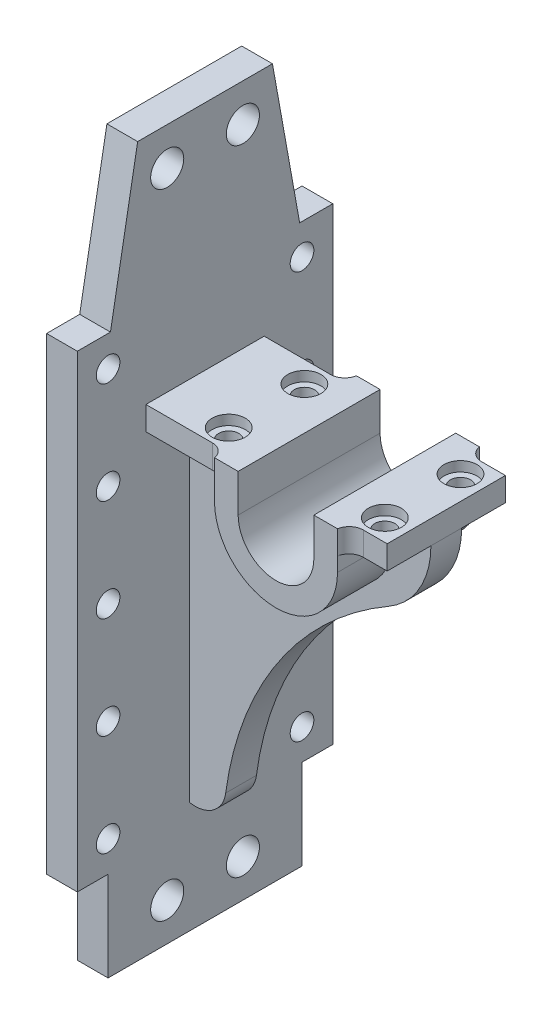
ISO-10303-21;
HEADER;
FILE_DESCRIPTION(('STEP AP214'),'2;1');
FILE_NAME('part.step','',(''),(''),'','','');
FILE_SCHEMA(('AUTOMOTIVE_DESIGN { 1 0 10303 214 1 1 1 1 }'));
ENDSEC;
DATA;
#1=APPLICATION_CONTEXT('core data for automotive mechanical design processes');
#2=APPLICATION_PROTOCOL_DEFINITION('international standard','automotive_design',2000,#1);
#3=PRODUCT_CONTEXT('',#1,'mechanical');
#4=PRODUCT('Part','Part','',(#3));
#5=PRODUCT_RELATED_PRODUCT_CATEGORY('part','',(#4));
#6=PRODUCT_DEFINITION_FORMATION('','',#4);
#7=PRODUCT_DEFINITION_CONTEXT('part definition',#1,'design');
#8=PRODUCT_DEFINITION('design','',#6,#7);
#9=PRODUCT_DEFINITION_SHAPE('','',#8);
#10=(LENGTH_UNIT() NAMED_UNIT(*) SI_UNIT(.MILLI.,.METRE.));
#11=(NAMED_UNIT(*) PLANE_ANGLE_UNIT() SI_UNIT($,.RADIAN.));
#12=(NAMED_UNIT(*) SI_UNIT($,.STERADIAN.) SOLID_ANGLE_UNIT());
#13=UNCERTAINTY_MEASURE_WITH_UNIT(LENGTH_MEASURE(1.E-05),#10,'distance_accuracy_value','');
#14=(GEOMETRIC_REPRESENTATION_CONTEXT(3) GLOBAL_UNCERTAINTY_ASSIGNED_CONTEXT((#13)) GLOBAL_UNIT_ASSIGNED_CONTEXT((#10,
#11,#12)) REPRESENTATION_CONTEXT('',''));
#15=CARTESIAN_POINT('',(0.,0.,0.));
#16=DIRECTION('',(0.,0.,1.));
#17=DIRECTION('',(1.,0.,0.));
#18=AXIS2_PLACEMENT_3D('',#15,#16,#17);
#19=CARTESIAN_POINT('',(115.,55.,30.));
#20=DIRECTION('',(0.,1.,0.));
#21=DIRECTION('',(0.,0.,1.));
#22=AXIS2_PLACEMENT_3D('',#19,#20,#21);
#23=PLANE('',#22);
#24=CARTESIAN_POINT('',(105.,55.,-16.));
#25=DIRECTION('',(0.,1.,0.));
#26=DIRECTION('',(0.,0.,1.));
#27=AXIS2_PLACEMENT_3D('',#24,#25,#26);
#28=CIRCLE('',#27,4.24999999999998);
#29=CARTESIAN_POINT('',(105.,55.,-11.75));
#30=VERTEX_POINT('',#29);
#31=EDGE_CURVE('E621',#30,#30,#28,.T.);
#32=ORIENTED_EDGE('',*,*,#31,.T.);
#33=EDGE_LOOP('',(#32));
#34=FACE_BOUND('',#33,.T.);
#35=DIRECTION('',(1.,0.,0.));
#36=VECTOR('',#35,1.);
#37=CARTESIAN_POINT('',(115.,55.,-6.5));
#38=LINE('',#37,#36);
#39=CARTESIAN_POINT('',(99.,55.,-6.5));
#40=VERTEX_POINT('',#39);
#41=CARTESIAN_POINT('',(115.,55.,-6.5));
#42=VERTEX_POINT('',#41);
#43=EDGE_CURVE('E345',#40,#42,#38,.T.);
#44=ORIENTED_EDGE('',*,*,#43,.F.);
#45=DIRECTION('',(0.,0.,-1.));
#46=VECTOR('',#45,1.);
#47=CARTESIAN_POINT('',(99.,55.,30.));
#48=LINE('',#47,#46);
#49=CARTESIAN_POINT('',(99.,55.,-30.));
#50=VERTEX_POINT('',#49);
#51=EDGE_CURVE('E490',#40,#50,#48,.T.);
#52=ORIENTED_EDGE('',*,*,#51,.T.);
#53=CARTESIAN_POINT('',(104.9160797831,55.,-31.));
#54=DIRECTION('',(0.,1.,0.));
#55=DIRECTION('',(0.,0.,1.));
#56=AXIS2_PLACEMENT_3D('',#53,#54,#55);
#57=CIRCLE('',#56,6.);
#58=CARTESIAN_POINT('',(104.9160797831,55.,-25.));
#59=VERTEX_POINT('',#58);
#60=EDGE_CURVE('E412',#50,#59,#57,.T.);
#61=ORIENTED_EDGE('',*,*,#60,.T.);
#62=DIRECTION('',(1.,0.,0.));
#63=VECTOR('',#62,1.);
#64=CARTESIAN_POINT('',(115.,55.,-25.));
#65=LINE('',#64,#63);
#66=CARTESIAN_POINT('',(115.,55.,-25.));
#67=VERTEX_POINT('',#66);
#68=EDGE_CURVE('E416',#59,#67,#65,.T.);
#69=ORIENTED_EDGE('',*,*,#68,.T.);
#70=DIRECTION('',(0.,0.,-1.));
#71=VECTOR('',#70,1.);
#72=CARTESIAN_POINT('',(115.,55.,30.));
#73=LINE('',#72,#71);
#74=EDGE_CURVE('E60',#42,#67,#73,.T.);
#75=ORIENTED_EDGE('',*,*,#74,.F.);
#76=EDGE_LOOP('',(#44,#52,#61,#69,#75));
#77=FACE_BOUND('',#76,.T.);
#78=ADVANCED_FACE('F43',(#34,#77),#23,.F.);
#79=CARTESIAN_POINT('',(47.,55.,30.));
#80=DIRECTION('',(0.,1.,0.));
#81=DIRECTION('',(-1.,0.,0.));
#82=AXIS2_PLACEMENT_3D('',#79,#80,#81);
#83=PLANE('',#82);
#84=CARTESIAN_POINT('',(39.,55.,-16.));
#85=DIRECTION('',(0.,1.,0.));
#86=DIRECTION('',(-1.,0.,0.));
#87=AXIS2_PLACEMENT_3D('',#84,#85,#86);
#88=CIRCLE('',#87,4.24999999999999);
#89=CARTESIAN_POINT('',(34.75,55.,-16.));
#90=VERTEX_POINT('',#89);
#91=EDGE_CURVE('E47',#90,#90,#88,.T.);
#92=ORIENTED_EDGE('',*,*,#91,.T.);
#93=EDGE_LOOP('',(#92));
#94=FACE_BOUND('',#93,.T.);
#95=DIRECTION('',(1.,0.,0.));
#96=VECTOR('',#95,1.);
#97=CARTESIAN_POINT('',(47.,55.,-6.5));
#98=LINE('',#97,#96);
#99=CARTESIAN_POINT('',(13.,55.,-6.5));
#100=VERTEX_POINT('',#99);
#101=CARTESIAN_POINT('',(47.,55.,-6.5));
#102=VERTEX_POINT('',#101);
#103=EDGE_CURVE('E354',#100,#102,#98,.T.);
#104=ORIENTED_EDGE('',*,*,#103,.F.);
#105=DIRECTION('',(0.,0.,-1.));
#106=VECTOR('',#105,1.);
#107=CARTESIAN_POINT('',(13.,55.,30.));
#108=LINE('',#107,#106);
#109=CARTESIAN_POINT('',(13.,55.,-25.));
#110=VERTEX_POINT('',#109);
#111=EDGE_CURVE('E505',#100,#110,#108,.T.);
#112=ORIENTED_EDGE('',*,*,#111,.T.);
#113=DIRECTION('',(1.,0.,0.));
#114=VECTOR('',#113,1.);
#115=CARTESIAN_POINT('',(47.,55.,-25.));
#116=LINE('',#115,#114);
#117=CARTESIAN_POINT('',(41.0839202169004,55.,-25.));
#118=VERTEX_POINT('',#117);
#119=EDGE_CURVE('E431',#110,#118,#116,.T.);
#120=ORIENTED_EDGE('',*,*,#119,.T.);
#121=CARTESIAN_POINT('',(41.0839202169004,55.,-31.));
#122=DIRECTION('',(0.,1.,0.));
#123=DIRECTION('',(-1.,0.,0.));
#124=AXIS2_PLACEMENT_3D('',#121,#122,#123);
#125=CIRCLE('',#124,6.);
#126=CARTESIAN_POINT('',(47.,55.,-30.));
#127=VERTEX_POINT('',#126);
#128=EDGE_CURVE('E426',#118,#127,#125,.T.);
#129=ORIENTED_EDGE('',*,*,#128,.T.);
#130=DIRECTION('',(0.,0.,-1.));
#131=VECTOR('',#130,1.);
#132=CARTESIAN_POINT('',(47.,55.,30.));
#133=LINE('',#132,#131);
#134=EDGE_CURVE('E501',#102,#127,#133,.T.);
#135=ORIENTED_EDGE('',*,*,#134,.F.);
#136=EDGE_LOOP('',(#104,#112,#120,#129,#135));
#137=FACE_BOUND('',#136,.T.);
#138=ADVANCED_FACE('F760',(#94,#137),#83,.F.);
#139=CARTESIAN_POINT('',(47.,49.,30.));
#140=DIRECTION('',(1.,0.,0.));
#141=DIRECTION('',(0.,1.,0.));
#142=AXIS2_PLACEMENT_3D('',#139,#140,#141);
#143=PLANE('',#142);
#144=DIRECTION('',(0.,-1.,0.));
#145=VECTOR('',#144,1.);
#146=CARTESIAN_POINT('',(47.,49.,-6.5));
#147=LINE('',#146,#145);
#148=CARTESIAN_POINT('',(47.,49.,-6.5));
#149=VERTEX_POINT('',#148);
#150=EDGE_CURVE('E351',#102,#149,#147,.T.);
#151=ORIENTED_EDGE('',*,*,#150,.F.);
#152=ORIENTED_EDGE('',*,*,#134,.T.);
#153=DIRECTION('',(0.,-1.,0.));
#154=VECTOR('',#153,1.);
#155=CARTESIAN_POINT('',(47.,49.,-30.));
#156=LINE('',#155,#154);
#157=CARTESIAN_POINT('',(47.,49.,-30.));
#158=VERTEX_POINT('',#157);
#159=EDGE_CURVE('E434',#127,#158,#156,.T.);
#160=ORIENTED_EDGE('',*,*,#159,.T.);
#161=DIRECTION('',(0.,0.,-1.));
#162=VECTOR('',#161,1.);
#163=CARTESIAN_POINT('',(47.,49.,30.));
#164=LINE('',#163,#162);
#165=EDGE_CURVE('E497',#149,#158,#164,.T.);
#166=ORIENTED_EDGE('',*,*,#165,.F.);
#167=EDGE_LOOP('',(#151,#152,#160,#166));
#168=FACE_BOUND('',#167,.T.);
#169=ADVANCED_FACE('F756',(#168),#143,.F.);
#170=CARTESIAN_POINT('',(73.,49.,30.));
#171=DIRECTION('',(0.,0.,-1.));
#172=DIRECTION('',(-1.,0.,0.));
#173=AXIS2_PLACEMENT_3D('',#170,#171,#172);
#174=CYLINDRICAL_SURFACE('',#173,26.);
#175=CARTESIAN_POINT('',(73.,49.,-6.5));
#176=DIRECTION('',(0.,0.,1.));
#177=DIRECTION('',(1.,0.,0.));
#178=AXIS2_PLACEMENT_3D('',#175,#176,#177);
#179=CIRCLE('',#178,26.);
#180=CARTESIAN_POINT('',(99.,49.,-6.5));
#181=VERTEX_POINT('',#180);
#182=EDGE_CURVE('E348',#149,#181,#179,.T.);
#183=ORIENTED_EDGE('',*,*,#182,.F.);
#184=ORIENTED_EDGE('',*,*,#165,.T.);
#185=CARTESIAN_POINT('',(73.,49.,-30.));
#186=DIRECTION('',(0.,0.,1.));
#187=DIRECTION('',(1.,0.,0.));
#188=AXIS2_PLACEMENT_3D('',#185,#186,#187);
#189=CIRCLE('',#188,26.);
#190=CARTESIAN_POINT('',(99.,49.,-30.));
#191=VERTEX_POINT('',#190);
#192=EDGE_CURVE('E457',#158,#191,#189,.T.);
#193=ORIENTED_EDGE('',*,*,#192,.T.);
#194=DIRECTION('',(0.,0.,-1.));
#195=VECTOR('',#194,1.);
#196=CARTESIAN_POINT('',(99.,49.,30.));
#197=LINE('',#196,#195);
#198=EDGE_CURVE('E493',#181,#191,#197,.T.);
#199=ORIENTED_EDGE('',*,*,#198,.F.);
#200=EDGE_LOOP('',(#183,#184,#193,#199));
#201=FACE_BOUND('',#200,.T.);
#202=ADVANCED_FACE('F828',(#201),#174,.T.);
#203=CARTESIAN_POINT('',(99.,49.,30.));
#204=DIRECTION('',(-1.,0.,0.));
#205=DIRECTION('',(0.,0.,1.));
#206=AXIS2_PLACEMENT_3D('',#203,#204,#205);
#207=PLANE('',#206);
#208=DIRECTION('',(0.,1.,0.));
#209=VECTOR('',#208,1.);
#210=CARTESIAN_POINT('',(99.,49.,-6.5));
#211=LINE('',#210,#209);
#212=EDGE_CURVE('E340',#181,#40,#211,.T.);
#213=ORIENTED_EDGE('',*,*,#212,.F.);
#214=ORIENTED_EDGE('',*,*,#198,.T.);
#215=DIRECTION('',(0.,1.,0.));
#216=VECTOR('',#215,1.);
#217=CARTESIAN_POINT('',(99.,49.,-30.));
#218=LINE('',#217,#216);
#219=EDGE_CURVE('E460',#191,#50,#218,.T.);
#220=ORIENTED_EDGE('',*,*,#219,.T.);
#221=ORIENTED_EDGE('',*,*,#51,.F.);
#222=EDGE_LOOP('',(#213,#214,#220,#221));
#223=FACE_BOUND('',#222,.T.);
#224=ADVANCED_FACE('F782',(#223),#207,.F.);
#225=CARTESIAN_POINT('',(73.,49.,30.));
#226=DIRECTION('',(0.,0.,1.));
#227=DIRECTION('',(1.,0.,0.));
#228=AXIS2_PLACEMENT_3D('',#225,#226,#227);
#229=PLANE('',#228);
#230=DIRECTION('',(0.,1.,0.));
#231=VECTOR('',#230,1.);
#232=CARTESIAN_POINT('',(99.,49.,30.));
#233=LINE('',#232,#231);
#234=CARTESIAN_POINT('',(99.,49.,30.));
#235=VERTEX_POINT('',#234);
#236=CARTESIAN_POINT('',(99.,55.,30.));
#237=VERTEX_POINT('',#236);
#238=EDGE_CURVE('E440',#235,#237,#233,.T.);
#239=ORIENTED_EDGE('',*,*,#238,.T.);
#240=DIRECTION('',(0.,1.,0.));
#241=VECTOR('',#240,1.);
#242=CARTESIAN_POINT('',(99.,-137.,30.));
#243=LINE('',#242,#241);
#244=CARTESIAN_POINT('',(99.,65.,30.));
#245=VERTEX_POINT('',#244);
#246=EDGE_CURVE('E376',#237,#245,#243,.T.);
#247=ORIENTED_EDGE('',*,*,#246,.T.);
#248=DIRECTION('',(-1.,0.,0.));
#249=VECTOR('',#248,1.);
#250=CARTESIAN_POINT('',(89.,65.,30.));
#251=LINE('',#250,#249);
#252=CARTESIAN_POINT('',(89.,65.,30.));
#253=VERTEX_POINT('',#252);
#254=EDGE_CURVE('E443',#245,#253,#251,.T.);
#255=ORIENTED_EDGE('',*,*,#254,.T.);
#256=DIRECTION('',(0.,-1.,0.));
#257=VECTOR('',#256,1.);
#258=CARTESIAN_POINT('',(89.,49.,30.));
#259=LINE('',#258,#257);
#260=CARTESIAN_POINT('',(89.,49.,30.));
#261=VERTEX_POINT('',#260);
#262=EDGE_CURVE('E445',#253,#261,#259,.T.);
#263=ORIENTED_EDGE('',*,*,#262,.T.);
#264=CARTESIAN_POINT('',(73.,49.,30.));
#265=DIRECTION('',(0.,0.,-1.));
#266=DIRECTION('',(1.,0.,0.));
#267=AXIS2_PLACEMENT_3D('',#264,#265,#266);
#268=CIRCLE('',#267,16.);
#269=CARTESIAN_POINT('',(57.,49.,30.));
#270=VERTEX_POINT('',#269);
#271=EDGE_CURVE('E447',#261,#270,#268,.T.);
#272=ORIENTED_EDGE('',*,*,#271,.T.);
#273=DIRECTION('',(0.,1.,0.));
#274=VECTOR('',#273,1.);
#275=CARTESIAN_POINT('',(57.,49.,30.));
#276=LINE('',#275,#274);
#277=CARTESIAN_POINT('',(57.,65.,30.));
#278=VERTEX_POINT('',#277);
#279=EDGE_CURVE('E449',#270,#278,#276,.T.);
#280=ORIENTED_EDGE('',*,*,#279,.T.);
#281=DIRECTION('',(-1.,0.,0.));
#282=VECTOR('',#281,1.);
#283=CARTESIAN_POINT('',(13.,65.,30.));
#284=LINE('',#283,#282);
#285=CARTESIAN_POINT('',(47.,65.,30.));
#286=VERTEX_POINT('',#285);
#287=EDGE_CURVE('E451',#278,#286,#284,.T.);
#288=ORIENTED_EDGE('',*,*,#287,.T.);
#289=DIRECTION('',(0.,1.,0.));
#290=VECTOR('',#289,1.);
#291=CARTESIAN_POINT('',(47.,-137.,30.));
#292=LINE('',#291,#290);
#293=CARTESIAN_POINT('',(47.,55.,30.));
#294=VERTEX_POINT('',#293);
#295=EDGE_CURVE('E601',#286,#294,#292,.F.);
#296=ORIENTED_EDGE('',*,*,#295,.T.);
#297=DIRECTION('',(0.,-1.,0.));
#298=VECTOR('',#297,1.);
#299=CARTESIAN_POINT('',(47.,49.,30.));
#300=LINE('',#299,#298);
#301=CARTESIAN_POINT('',(47.,49.,30.));
#302=VERTEX_POINT('',#301);
#303=EDGE_CURVE('E435',#294,#302,#300,.T.);
#304=ORIENTED_EDGE('',*,*,#303,.T.);
#305=CARTESIAN_POINT('',(73.,49.,30.));
#306=DIRECTION('',(0.,0.,1.));
#307=DIRECTION('',(1.,0.,0.));
#308=AXIS2_PLACEMENT_3D('',#305,#306,#307);
#309=CIRCLE('',#308,26.);
#310=EDGE_CURVE('E437',#302,#235,#309,.T.);
#311=ORIENTED_EDGE('',*,*,#310,.T.);
#312=EDGE_LOOP('',(#239,#247,#255,#263,#272,#280,#288,#296,#304,#311));
#313=FACE_BOUND('',#312,.T.);
#314=ADVANCED_FACE('F774',(#313),#229,.T.);
#315=CARTESIAN_POINT('',(105.,55.,16.));
#316=DIRECTION('',(0.,1.,0.));
#317=DIRECTION('',(0.,0.,1.));
#318=AXIS2_PLACEMENT_3D('',#315,#316,#317);
#319=CIRCLE('',#318,4.24999999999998);
#320=CARTESIAN_POINT('',(105.,55.,20.25));
#321=VERTEX_POINT('',#320);
#322=EDGE_CURVE('E616',#321,#321,#319,.T.);
#323=ORIENTED_EDGE('',*,*,#322,.T.);
#324=EDGE_LOOP('',(#323));
#325=FACE_BOUND('',#324,.T.);
#326=CARTESIAN_POINT('',(99.,55.,6.5));
#327=VERTEX_POINT('',#326);
#328=EDGE_CURVE('E491',#237,#327,#48,.T.);
#329=ORIENTED_EDGE('',*,*,#328,.T.);
#330=DIRECTION('',(1.,0.,0.));
#331=VECTOR('',#330,1.);
#332=CARTESIAN_POINT('',(115.,55.,6.5));
#333=LINE('',#332,#331);
#334=CARTESIAN_POINT('',(115.,55.,6.5));
#335=VERTEX_POINT('',#334);
#336=EDGE_CURVE('E68',#327,#335,#333,.T.);
#337=ORIENTED_EDGE('',*,*,#336,.T.);
#338=CARTESIAN_POINT('',(115.,55.,25.));
#339=VERTEX_POINT('',#338);
#340=EDGE_CURVE('E488',#339,#335,#73,.T.);
#341=ORIENTED_EDGE('',*,*,#340,.F.);
#342=DIRECTION('',(1.,0.,0.));
#343=VECTOR('',#342,1.);
#344=CARTESIAN_POINT('',(115.,55.,25.));
#345=LINE('',#344,#343);
#346=CARTESIAN_POINT('',(104.9160797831,55.,25.));
#347=VERTEX_POINT('',#346);
#348=EDGE_CURVE('E379',#347,#339,#345,.T.);
#349=ORIENTED_EDGE('',*,*,#348,.F.);
#350=CARTESIAN_POINT('',(104.9160797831,55.,31.));
#351=DIRECTION('',(0.,1.,0.));
#352=DIRECTION('',(0.,0.,1.));
#353=AXIS2_PLACEMENT_3D('',#350,#351,#352);
#354=CIRCLE('',#353,6.);
#355=EDGE_CURVE('E386',#237,#347,#354,.F.);
#356=ORIENTED_EDGE('',*,*,#355,.F.);
#357=EDGE_LOOP('',(#329,#337,#341,#349,#356));
#358=FACE_BOUND('',#357,.T.);
#359=ADVANCED_FACE('F763',(#325,#358),#23,.F.);
#360=CARTESIAN_POINT('',(115.,65.,30.));
#361=DIRECTION('',(-1.,0.,0.));
#362=DIRECTION('',(0.,-1.,0.));
#363=AXIS2_PLACEMENT_3D('',#360,#361,#362);
#364=PLANE('',#363);
#365=ORIENTED_EDGE('',*,*,#340,.T.);
#366=DIRECTION('',(0.,0.,1.));
#367=VECTOR('',#366,1.);
#368=CARTESIAN_POINT('',(115.,55.,0.));
#369=LINE('',#368,#367);
#370=EDGE_CURVE('E310',#42,#335,#369,.T.);
#371=ORIENTED_EDGE('',*,*,#370,.F.);
#372=ORIENTED_EDGE('',*,*,#74,.T.);
#373=DIRECTION('',(0.,1.,0.));
#374=VECTOR('',#373,1.);
#375=CARTESIAN_POINT('',(115.,-137.,-25.));
#376=LINE('',#375,#374);
#377=CARTESIAN_POINT('',(115.,65.,-25.));
#378=VERTEX_POINT('',#377);
#379=EDGE_CURVE('E409',#67,#378,#376,.T.);
#380=ORIENTED_EDGE('',*,*,#379,.T.);
#381=DIRECTION('',(0.,0.,-1.));
#382=VECTOR('',#381,1.);
#383=CARTESIAN_POINT('',(115.,65.,30.));
#384=LINE('',#383,#382);
#385=CARTESIAN_POINT('',(115.,65.,25.));
#386=VERTEX_POINT('',#385);
#387=EDGE_CURVE('E486',#386,#378,#384,.T.);
#388=ORIENTED_EDGE('',*,*,#387,.F.);
#389=DIRECTION('',(0.,1.,0.));
#390=VECTOR('',#389,1.);
#391=CARTESIAN_POINT('',(115.,-137.,25.));
#392=LINE('',#391,#390);
#393=EDGE_CURVE('E375',#339,#386,#392,.T.);
#394=ORIENTED_EDGE('',*,*,#393,.F.);
#395=EDGE_LOOP('',(#365,#371,#372,#380,#388,#394));
#396=FACE_BOUND('',#395,.T.);
#397=ADVANCED_FACE('F773',(#396),#364,.F.);
#398=CARTESIAN_POINT('',(89.,65.,30.));
#399=DIRECTION('',(0.,-1.,0.));
#400=DIRECTION('',(0.,0.,-1.));
#401=AXIS2_PLACEMENT_3D('',#398,#399,#400);
#402=PLANE('',#401);
#403=CARTESIAN_POINT('',(105.,65.,-16.));
#404=DIRECTION('',(0.,1.,0.));
#405=DIRECTION('',(0.,0.,1.));
#406=AXIS2_PLACEMENT_3D('',#403,#404,#405);
#407=CIRCLE('',#406,7.00000000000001);
#408=CARTESIAN_POINT('',(105.,65.,-8.99999999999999));
#409=VERTEX_POINT('',#408);
#410=EDGE_CURVE('E627',#409,#409,#407,.T.);
#411=ORIENTED_EDGE('',*,*,#410,.F.);
#412=EDGE_LOOP('',(#411));
#413=FACE_BOUND('',#412,.T.);
#414=CARTESIAN_POINT('',(105.,65.,16.));
#415=DIRECTION('',(0.,1.,0.));
#416=DIRECTION('',(0.,0.,1.));
#417=AXIS2_PLACEMENT_3D('',#414,#415,#416);
#418=CIRCLE('',#417,7.00000000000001);
#419=CARTESIAN_POINT('',(105.,65.,23.));
#420=VERTEX_POINT('',#419);
#421=EDGE_CURVE('E623',#420,#420,#418,.T.);
#422=ORIENTED_EDGE('',*,*,#421,.F.);
#423=EDGE_LOOP('',(#422));
#424=FACE_BOUND('',#423,.T.);
#425=ORIENTED_EDGE('',*,*,#387,.T.);
#426=DIRECTION('',(1.,0.,0.));
#427=VECTOR('',#426,1.);
#428=CARTESIAN_POINT('',(115.,65.,-25.));
#429=LINE('',#428,#427);
#430=CARTESIAN_POINT('',(104.9160797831,65.,-25.));
#431=VERTEX_POINT('',#430);
#432=EDGE_CURVE('E405',#431,#378,#429,.T.);
#433=ORIENTED_EDGE('',*,*,#432,.F.);
#434=CARTESIAN_POINT('',(104.9160797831,65.,-31.));
#435=DIRECTION('',(0.,1.,0.));
#436=DIRECTION('',(0.,0.,-1.));
#437=AXIS2_PLACEMENT_3D('',#434,#435,#436);
#438=CIRCLE('',#437,6.);
#439=CARTESIAN_POINT('',(99.,65.,-30.));
#440=VERTEX_POINT('',#439);
#441=EDGE_CURVE('E402',#440,#431,#438,.T.);
#442=ORIENTED_EDGE('',*,*,#441,.F.);
#443=DIRECTION('',(-1.,0.,0.));
#444=VECTOR('',#443,1.);
#445=CARTESIAN_POINT('',(89.,65.,-30.));
#446=LINE('',#445,#444);
#447=CARTESIAN_POINT('',(89.,65.,-30.));
#448=VERTEX_POINT('',#447);
#449=EDGE_CURVE('E463',#440,#448,#446,.T.);
#450=ORIENTED_EDGE('',*,*,#449,.T.);
#451=DIRECTION('',(0.,0.,-1.));
#452=VECTOR('',#451,1.);
#453=CARTESIAN_POINT('',(89.,65.,30.));
#454=LINE('',#453,#452);
#455=EDGE_CURVE('E484',#253,#448,#454,.T.);
#456=ORIENTED_EDGE('',*,*,#455,.F.);
#457=ORIENTED_EDGE('',*,*,#254,.F.);
#458=CARTESIAN_POINT('',(104.9160797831,65.,31.));
#459=DIRECTION('',(0.,-1.,0.));
#460=DIRECTION('',(0.,0.,1.));
#461=AXIS2_PLACEMENT_3D('',#458,#459,#460);
#462=CIRCLE('',#461,6.);
#463=CARTESIAN_POINT('',(104.9160797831,65.,25.));
#464=VERTEX_POINT('',#463);
#465=EDGE_CURVE('E372',#245,#464,#462,.T.);
#466=ORIENTED_EDGE('',*,*,#465,.T.);
#467=DIRECTION('',(1.,0.,0.));
#468=VECTOR('',#467,1.);
#469=CARTESIAN_POINT('',(115.,65.,25.));
#470=LINE('',#469,#468);
#471=EDGE_CURVE('E361',#464,#386,#470,.T.);
#472=ORIENTED_EDGE('',*,*,#471,.T.);
#473=EDGE_LOOP('',(#425,#433,#442,#450,#456,#457,#466,#472));
#474=FACE_BOUND('',#473,.T.);
#475=ADVANCED_FACE('F780',(#413,#424,#474),#402,.F.);
#476=CARTESIAN_POINT('',(39.,55.,16.));
#477=DIRECTION('',(0.,1.,0.));
#478=DIRECTION('',(-1.,0.,0.));
#479=AXIS2_PLACEMENT_3D('',#476,#477,#478);
#480=CIRCLE('',#479,4.24999999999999);
#481=CARTESIAN_POINT('',(34.75,55.,16.));
#482=VERTEX_POINT('',#481);
#483=EDGE_CURVE('E625',#482,#482,#480,.T.);
#484=ORIENTED_EDGE('',*,*,#483,.T.);
#485=EDGE_LOOP('',(#484));
#486=FACE_BOUND('',#485,.T.);
#487=CARTESIAN_POINT('',(13.,55.,25.));
#488=VERTEX_POINT('',#487);
#489=CARTESIAN_POINT('',(13.,55.,6.5));
#490=VERTEX_POINT('',#489);
#491=EDGE_CURVE('E506',#488,#490,#108,.T.);
#492=ORIENTED_EDGE('',*,*,#491,.T.);
#493=DIRECTION('',(1.,0.,0.));
#494=VECTOR('',#493,1.);
#495=CARTESIAN_POINT('',(47.,55.,6.5));
#496=LINE('',#495,#494);
#497=CARTESIAN_POINT('',(47.,55.,6.5));
#498=VERTEX_POINT('',#497);
#499=EDGE_CURVE('E367',#490,#498,#496,.T.);
#500=ORIENTED_EDGE('',*,*,#499,.T.);
#501=EDGE_CURVE('E502',#294,#498,#133,.T.);
#502=ORIENTED_EDGE('',*,*,#501,.F.);
#503=CARTESIAN_POINT('',(41.0839202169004,55.,31.));
#504=DIRECTION('',(0.,1.,0.));
#505=DIRECTION('',(-1.,0.,0.));
#506=AXIS2_PLACEMENT_3D('',#503,#504,#505);
#507=CIRCLE('',#506,6.);
#508=CARTESIAN_POINT('',(41.0839202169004,55.,25.));
#509=VERTEX_POINT('',#508);
#510=EDGE_CURVE('E397',#509,#294,#507,.F.);
#511=ORIENTED_EDGE('',*,*,#510,.F.);
#512=DIRECTION('',(1.,0.,0.));
#513=VECTOR('',#512,1.);
#514=CARTESIAN_POINT('',(47.,55.,25.));
#515=LINE('',#514,#513);
#516=EDGE_CURVE('E400',#488,#509,#515,.T.);
#517=ORIENTED_EDGE('',*,*,#516,.F.);
#518=EDGE_LOOP('',(#492,#500,#502,#511,#517));
#519=FACE_BOUND('',#518,.T.);
#520=ADVANCED_FACE('F769',(#486,#519),#83,.F.);
#521=CARTESIAN_POINT('',(13.,65.,30.));
#522=DIRECTION('',(0.,-1.,0.));
#523=DIRECTION('',(0.,0.,-1.));
#524=AXIS2_PLACEMENT_3D('',#521,#522,#523);
#525=PLANE('',#524);
#526=CARTESIAN_POINT('',(39.,65.,-16.));
#527=DIRECTION('',(0.,1.,0.));
#528=DIRECTION('',(0.,0.,1.));
#529=AXIS2_PLACEMENT_3D('',#526,#527,#528);
#530=CIRCLE('',#529,7.);
#531=CARTESIAN_POINT('',(39.,65.,-9.));
#532=VERTEX_POINT('',#531);
#533=EDGE_CURVE('E1220',#532,#532,#530,.T.);
#534=ORIENTED_EDGE('',*,*,#533,.F.);
#535=EDGE_LOOP('',(#534));
#536=FACE_BOUND('',#535,.T.);
#537=CARTESIAN_POINT('',(39.,65.,16.));
#538=DIRECTION('',(0.,1.,0.));
#539=DIRECTION('',(0.,0.,1.));
#540=AXIS2_PLACEMENT_3D('',#537,#538,#539);
#541=CIRCLE('',#540,7.);
#542=CARTESIAN_POINT('',(39.,65.,23.));
#543=VERTEX_POINT('',#542);
#544=EDGE_CURVE('E640',#543,#543,#541,.T.);
#545=ORIENTED_EDGE('',*,*,#544,.F.);
#546=EDGE_LOOP('',(#545));
#547=FACE_BOUND('',#546,.T.);
#548=DIRECTION('',(0.,0.,-1.));
#549=VECTOR('',#548,1.);
#550=CARTESIAN_POINT('',(57.,65.,30.));
#551=LINE('',#550,#549);
#552=CARTESIAN_POINT('',(57.,65.,-30.));
#553=VERTEX_POINT('',#552);
#554=EDGE_CURVE('E478',#278,#553,#551,.T.);
#555=ORIENTED_EDGE('',*,*,#554,.T.);
#556=DIRECTION('',(-1.,0.,0.));
#557=VECTOR('',#556,1.);
#558=CARTESIAN_POINT('',(13.,65.,-30.));
#559=LINE('',#558,#557);
#560=CARTESIAN_POINT('',(47.,65.,-30.));
#561=VERTEX_POINT('',#560);
#562=EDGE_CURVE('E438',#553,#561,#559,.T.);
#563=ORIENTED_EDGE('',*,*,#562,.T.);
#564=CARTESIAN_POINT('',(41.0839202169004,65.,-31.));
#565=DIRECTION('',(0.,1.,0.));
#566=DIRECTION('',(0.,0.,1.));
#567=AXIS2_PLACEMENT_3D('',#564,#565,#566);
#568=CIRCLE('',#567,6.);
#569=CARTESIAN_POINT('',(41.0839202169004,65.,-25.));
#570=VERTEX_POINT('',#569);
#571=EDGE_CURVE('E421',#570,#561,#568,.T.);
#572=ORIENTED_EDGE('',*,*,#571,.F.);
#573=DIRECTION('',(1.,0.,0.));
#574=VECTOR('',#573,1.);
#575=CARTESIAN_POINT('',(13.,65.,-25.));
#576=LINE('',#575,#574);
#577=CARTESIAN_POINT('',(13.,65.,-25.));
#578=VERTEX_POINT('',#577);
#579=EDGE_CURVE('E418',#578,#570,#576,.T.);
#580=ORIENTED_EDGE('',*,*,#579,.F.);
#581=DIRECTION('',(0.,0.,-1.));
#582=VECTOR('',#581,1.);
#583=CARTESIAN_POINT('',(13.,65.,30.));
#584=LINE('',#583,#582);
#585=CARTESIAN_POINT('',(13.,65.,25.));
#586=VERTEX_POINT('',#585);
#587=EDGE_CURVE('E454',#586,#578,#584,.T.);
#588=ORIENTED_EDGE('',*,*,#587,.F.);
#589=DIRECTION('',(1.,0.,0.));
#590=VECTOR('',#589,1.);
#591=CARTESIAN_POINT('',(13.,65.,25.));
#592=LINE('',#591,#590);
#593=CARTESIAN_POINT('',(41.0839202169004,65.,25.));
#594=VERTEX_POINT('',#593);
#595=EDGE_CURVE('E391',#586,#594,#592,.T.);
#596=ORIENTED_EDGE('',*,*,#595,.T.);
#597=CARTESIAN_POINT('',(41.0839202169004,65.,31.));
#598=DIRECTION('',(0.,-1.,0.));
#599=DIRECTION('',(0.,0.,-1.));
#600=AXIS2_PLACEMENT_3D('',#597,#598,#599);
#601=CIRCLE('',#600,6.);
#602=EDGE_CURVE('E388',#594,#286,#601,.T.);
#603=ORIENTED_EDGE('',*,*,#602,.T.);
#604=ORIENTED_EDGE('',*,*,#287,.F.);
#605=EDGE_LOOP('',(#555,#563,#572,#580,#588,#596,#603,#604));
#606=FACE_BOUND('',#605,.T.);
#607=ADVANCED_FACE('F845',(#536,#547,#606),#525,.F.);
#608=CARTESIAN_POINT('',(13.,99.,54.));
#609=DIRECTION('',(0.,0.,-1.));
#610=DIRECTION('',(-1.,0.,0.));
#611=AXIS2_PLACEMENT_3D('',#608,#609,#610);
#612=PLANE('',#611);
#613=DIRECTION('',(0.,-1.,0.));
#614=VECTOR('',#613,1.);
#615=CARTESIAN_POINT('',(0.,99.,54.));
#616=LINE('',#615,#614);
#617=CARTESIAN_POINT('',(0.,99.,54.));
#618=VERTEX_POINT('',#617);
#619=CARTESIAN_POINT('',(0.,-99.,54.));
#620=VERTEX_POINT('',#619);
#621=EDGE_CURVE('E509',#618,#620,#616,.T.);
#622=ORIENTED_EDGE('',*,*,#621,.T.);
#623=DIRECTION('',(-1.,0.,0.));
#624=VECTOR('',#623,1.);
#625=CARTESIAN_POINT('',(13.,-99.,54.));
#626=LINE('',#625,#624);
#627=CARTESIAN_POINT('',(13.,-99.,54.));
#628=VERTEX_POINT('',#627);
#629=EDGE_CURVE('E592',#628,#620,#626,.T.);
#630=ORIENTED_EDGE('',*,*,#629,.F.);
#631=DIRECTION('',(0.,-1.,0.));
#632=VECTOR('',#631,1.);
#633=CARTESIAN_POINT('',(13.,99.,54.));
#634=LINE('',#633,#632);
#635=CARTESIAN_POINT('',(13.,99.,54.));
#636=VERTEX_POINT('',#635);
#637=EDGE_CURVE('E510',#636,#628,#634,.T.);
#638=ORIENTED_EDGE('',*,*,#637,.F.);
#639=DIRECTION('',(-1.,0.,0.));
#640=VECTOR('',#639,1.);
#641=CARTESIAN_POINT('',(13.,99.,54.));
#642=LINE('',#641,#640);
#643=EDGE_CURVE('E536',#636,#618,#642,.T.);
#644=ORIENTED_EDGE('',*,*,#643,.T.);
#645=EDGE_LOOP('',(#622,#630,#638,#644));
#646=FACE_BOUND('',#645,.T.);
#647=ADVANCED_FACE('F903',(#646),#612,.F.);
#648=CARTESIAN_POINT('',(13.,-99.,54.));
#649=DIRECTION('',(0.,1.,0.));
#650=DIRECTION('',(0.,0.,1.));
#651=AXIS2_PLACEMENT_3D('',#648,#649,#650);
#652=PLANE('',#651);
#653=DIRECTION('',(0.,0.,-1.));
#654=VECTOR('',#653,1.);
#655=CARTESIAN_POINT('',(0.,-99.,54.));
#656=LINE('',#655,#654);
#657=CARTESIAN_POINT('',(0.,-99.,41.));
#658=VERTEX_POINT('',#657);
#659=EDGE_CURVE('E539',#620,#658,#656,.T.);
#660=ORIENTED_EDGE('',*,*,#659,.T.);
#661=DIRECTION('',(-1.,0.,0.));
#662=VECTOR('',#661,1.);
#663=CARTESIAN_POINT('',(13.,-99.,41.));
#664=LINE('',#663,#662);
#665=CARTESIAN_POINT('',(13.,-99.,41.));
#666=VERTEX_POINT('',#665);
#667=EDGE_CURVE('E589',#666,#658,#664,.T.);
#668=ORIENTED_EDGE('',*,*,#667,.F.);
#669=DIRECTION('',(0.,0.,-1.));
#670=VECTOR('',#669,1.);
#671=CARTESIAN_POINT('',(13.,-99.,54.));
#672=LINE('',#671,#670);
#673=EDGE_CURVE('E513',#628,#666,#672,.T.);
#674=ORIENTED_EDGE('',*,*,#673,.F.);
#675=ORIENTED_EDGE('',*,*,#629,.T.);
#676=EDGE_LOOP('',(#660,#668,#674,#675));
#677=FACE_BOUND('',#676,.T.);
#678=ADVANCED_FACE('F1247',(#677),#652,.F.);
#679=CARTESIAN_POINT('',(13.,-99.,41.));
#680=DIRECTION('',(0.,0.,-1.));
#681=DIRECTION('',(-1.,0.,0.));
#682=AXIS2_PLACEMENT_3D('',#679,#680,#681);
#683=PLANE('',#682);
#684=DIRECTION('',(0.,-1.,0.));
#685=VECTOR('',#684,1.);
#686=CARTESIAN_POINT('',(0.,-99.,41.));
#687=LINE('',#686,#685);
#688=CARTESIAN_POINT('',(0.,-137.,41.));
#689=VERTEX_POINT('',#688);
#690=EDGE_CURVE('E541',#658,#689,#687,.T.);
#691=ORIENTED_EDGE('',*,*,#690,.T.);
#692=DIRECTION('',(-1.,0.,0.));
#693=VECTOR('',#692,1.);
#694=CARTESIAN_POINT('',(13.,-137.,41.));
#695=LINE('',#694,#693);
#696=CARTESIAN_POINT('',(13.,-137.,41.));
#697=VERTEX_POINT('',#696);
#698=EDGE_CURVE('E586',#697,#689,#695,.T.);
#699=ORIENTED_EDGE('',*,*,#698,.F.);
#700=DIRECTION('',(0.,-1.,0.));
#701=VECTOR('',#700,1.);
#702=CARTESIAN_POINT('',(13.,-99.,41.));
#703=LINE('',#702,#701);
#704=EDGE_CURVE('E516',#666,#697,#703,.T.);
#705=ORIENTED_EDGE('',*,*,#704,.F.);
#706=ORIENTED_EDGE('',*,*,#667,.T.);
#707=EDGE_LOOP('',(#691,#699,#705,#706));
#708=FACE_BOUND('',#707,.T.);
#709=ADVANCED_FACE('F1255',(#708),#683,.F.);
#710=CARTESIAN_POINT('',(13.,-137.,41.));
#711=DIRECTION('',(0.,1.,0.));
#712=DIRECTION('',(0.,0.,1.));
#713=AXIS2_PLACEMENT_3D('',#710,#711,#712);
#714=PLANE('',#713);
#715=DIRECTION('',(0.,0.,-1.));
#716=VECTOR('',#715,1.);
#717=CARTESIAN_POINT('',(0.,-137.,41.));
#718=LINE('',#717,#716);
#719=CARTESIAN_POINT('',(0.,-137.,-41.));
#720=VERTEX_POINT('',#719);
#721=EDGE_CURVE('E543',#689,#720,#718,.T.);
#722=ORIENTED_EDGE('',*,*,#721,.T.);
#723=DIRECTION('',(-1.,0.,0.));
#724=VECTOR('',#723,1.);
#725=CARTESIAN_POINT('',(13.,-137.,-41.));
#726=LINE('',#725,#724);
#727=CARTESIAN_POINT('',(13.,-137.,-41.));
#728=VERTEX_POINT('',#727);
#729=EDGE_CURVE('E583',#728,#720,#726,.T.);
#730=ORIENTED_EDGE('',*,*,#729,.F.);
#731=DIRECTION('',(0.,0.,-1.));
#732=VECTOR('',#731,1.);
#733=CARTESIAN_POINT('',(13.,-137.,41.));
#734=LINE('',#733,#732);
#735=EDGE_CURVE('E518',#697,#728,#734,.T.);
#736=ORIENTED_EDGE('',*,*,#735,.F.);
#737=ORIENTED_EDGE('',*,*,#698,.T.);
#738=EDGE_LOOP('',(#722,#730,#736,#737));
#739=FACE_BOUND('',#738,.T.);
#740=ADVANCED_FACE('F1263',(#739),#714,.F.);
#741=CARTESIAN_POINT('',(13.,-137.,-41.));
#742=DIRECTION('',(0.,0.,1.));
#743=DIRECTION('',(0.,-1.,0.));
#744=AXIS2_PLACEMENT_3D('',#741,#742,#743);
#745=PLANE('',#744);
#746=DIRECTION('',(0.,1.,0.));
#747=VECTOR('',#746,1.);
#748=CARTESIAN_POINT('',(0.,-137.,-41.));
#749=LINE('',#748,#747);
#750=CARTESIAN_POINT('',(0.,-99.,-41.));
#751=VERTEX_POINT('',#750);
#752=EDGE_CURVE('E545',#720,#751,#749,.T.);
#753=ORIENTED_EDGE('',*,*,#752,.T.);
#754=DIRECTION('',(-1.,0.,0.));
#755=VECTOR('',#754,1.);
#756=CARTESIAN_POINT('',(13.,-99.,-41.));
#757=LINE('',#756,#755);
#758=CARTESIAN_POINT('',(13.,-99.,-41.));
#759=VERTEX_POINT('',#758);
#760=EDGE_CURVE('E580',#759,#751,#757,.T.);
#761=ORIENTED_EDGE('',*,*,#760,.F.);
#762=DIRECTION('',(0.,1.,0.));
#763=VECTOR('',#762,1.);
#764=CARTESIAN_POINT('',(13.,-137.,-41.));
#765=LINE('',#764,#763);
#766=EDGE_CURVE('E520',#728,#759,#765,.T.);
#767=ORIENTED_EDGE('',*,*,#766,.F.);
#768=ORIENTED_EDGE('',*,*,#729,.T.);
#769=EDGE_LOOP('',(#753,#761,#767,#768));
#770=FACE_BOUND('',#769,.T.);
#771=ADVANCED_FACE('F1272',(#770),#745,.F.);
#772=CARTESIAN_POINT('',(13.,-99.,-41.));
#773=DIRECTION('',(0.,1.,0.));
#774=DIRECTION('',(0.,0.,1.));
#775=AXIS2_PLACEMENT_3D('',#772,#773,#774);
#776=PLANE('',#775);
#777=DIRECTION('',(0.,0.,-1.));
#778=VECTOR('',#777,1.);
#779=CARTESIAN_POINT('',(0.,-99.,-41.));
#780=LINE('',#779,#778);
#781=CARTESIAN_POINT('',(0.,-99.,-54.));
#782=VERTEX_POINT('',#781);
#783=EDGE_CURVE('E547',#751,#782,#780,.T.);
#784=ORIENTED_EDGE('',*,*,#783,.T.);
#785=DIRECTION('',(-1.,0.,0.));
#786=VECTOR('',#785,1.);
#787=CARTESIAN_POINT('',(13.,-99.,-54.));
#788=LINE('',#787,#786);
#789=CARTESIAN_POINT('',(13.,-99.,-54.));
#790=VERTEX_POINT('',#789);
#791=EDGE_CURVE('E577',#790,#782,#788,.T.);
#792=ORIENTED_EDGE('',*,*,#791,.F.);
#793=DIRECTION('',(0.,0.,-1.));
#794=VECTOR('',#793,1.);
#795=CARTESIAN_POINT('',(13.,-99.,-41.));
#796=LINE('',#795,#794);
#797=EDGE_CURVE('E522',#759,#790,#796,.T.);
#798=ORIENTED_EDGE('',*,*,#797,.F.);
#799=ORIENTED_EDGE('',*,*,#760,.T.);
#800=EDGE_LOOP('',(#784,#792,#798,#799));
#801=FACE_BOUND('',#800,.T.);
#802=ADVANCED_FACE('F1280',(#801),#776,.F.);
#803=CARTESIAN_POINT('',(13.,99.,-54.));
#804=DIRECTION('',(0.,0.,1.));
#805=DIRECTION('',(1.,0.,0.));
#806=AXIS2_PLACEMENT_3D('',#803,#804,#805);
#807=PLANE('',#806);
#808=DIRECTION('',(0.,1.,0.));
#809=VECTOR('',#808,1.);
#810=CARTESIAN_POINT('',(0.,99.,-54.));
#811=LINE('',#810,#809);
#812=CARTESIAN_POINT('',(0.,99.,-54.));
#813=VERTEX_POINT('',#812);
#814=EDGE_CURVE('E549',#782,#813,#811,.T.);
#815=ORIENTED_EDGE('',*,*,#814,.T.);
#816=DIRECTION('',(-1.,0.,0.));
#817=VECTOR('',#816,1.);
#818=CARTESIAN_POINT('',(13.,99.,-54.));
#819=LINE('',#818,#817);
#820=CARTESIAN_POINT('',(13.,99.,-54.));
#821=VERTEX_POINT('',#820);
#822=EDGE_CURVE('E574',#821,#813,#819,.T.);
#823=ORIENTED_EDGE('',*,*,#822,.F.);
#824=DIRECTION('',(0.,1.,0.));
#825=VECTOR('',#824,1.);
#826=CARTESIAN_POINT('',(13.,99.,-54.));
#827=LINE('',#826,#825);
#828=EDGE_CURVE('E524',#790,#821,#827,.T.);
#829=ORIENTED_EDGE('',*,*,#828,.F.);
#830=ORIENTED_EDGE('',*,*,#791,.T.);
#831=EDGE_LOOP('',(#815,#823,#829,#830));
#832=FACE_BOUND('',#831,.T.);
#833=ADVANCED_FACE('F1288',(#832),#807,.F.);
#834=CARTESIAN_POINT('',(13.,99.,-40.));
#835=DIRECTION('',(0.,-1.,0.));
#836=DIRECTION('',(0.,0.,-1.));
#837=AXIS2_PLACEMENT_3D('',#834,#835,#836);
#838=PLANE('',#837);
#839=DIRECTION('',(0.,0.,1.));
#840=VECTOR('',#839,1.);
#841=CARTESIAN_POINT('',(0.,99.,-40.));
#842=LINE('',#841,#840);
#843=CARTESIAN_POINT('',(0.,99.,-40.));
#844=VERTEX_POINT('',#843);
#845=EDGE_CURVE('E551',#813,#844,#842,.T.);
#846=ORIENTED_EDGE('',*,*,#845,.T.);
#847=DIRECTION('',(-1.,0.,0.));
#848=VECTOR('',#847,1.);
#849=CARTESIAN_POINT('',(13.,99.,-40.));
#850=LINE('',#849,#848);
#851=CARTESIAN_POINT('',(13.,99.,-40.));
#852=VERTEX_POINT('',#851);
#853=EDGE_CURVE('E571',#852,#844,#850,.T.);
#854=ORIENTED_EDGE('',*,*,#853,.F.);
#855=DIRECTION('',(0.,0.,1.));
#856=VECTOR('',#855,1.);
#857=CARTESIAN_POINT('',(13.,99.,-40.));
#858=LINE('',#857,#856);
#859=EDGE_CURVE('E526',#821,#852,#858,.T.);
#860=ORIENTED_EDGE('',*,*,#859,.F.);
#861=ORIENTED_EDGE('',*,*,#822,.T.);
#862=EDGE_LOOP('',(#846,#854,#860,#861));
#863=FACE_BOUND('',#862,.T.);
#864=ADVANCED_FACE('F1296',(#863),#838,.F.);
#865=CARTESIAN_POINT('',(13.,163.,-28.5));
#866=DIRECTION('',(0.,-0.17685506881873,0.984236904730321));
#867=DIRECTION('',(0.,-0.984236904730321,-0.17685506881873));
#868=AXIS2_PLACEMENT_3D('',#865,#866,#867);
#869=PLANE('',#868);
#870=DIRECTION('',(0.,0.984236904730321,0.17685506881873));
#871=VECTOR('',#870,1.);
#872=CARTESIAN_POINT('',(0.,163.,-28.5));
#873=LINE('',#872,#871);
#874=CARTESIAN_POINT('',(0.,163.,-28.5));
#875=VERTEX_POINT('',#874);
#876=EDGE_CURVE('E553',#844,#875,#873,.T.);
#877=ORIENTED_EDGE('',*,*,#876,.T.);
#878=DIRECTION('',(-1.,0.,0.));
#879=VECTOR('',#878,1.);
#880=CARTESIAN_POINT('',(13.,163.,-28.5));
#881=LINE('',#880,#879);
#882=CARTESIAN_POINT('',(13.,163.,-28.5));
#883=VERTEX_POINT('',#882);
#884=EDGE_CURVE('E568',#883,#875,#881,.T.);
#885=ORIENTED_EDGE('',*,*,#884,.F.);
#886=DIRECTION('',(0.,0.984236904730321,0.17685506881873));
#887=VECTOR('',#886,1.);
#888=CARTESIAN_POINT('',(13.,163.,-28.5));
#889=LINE('',#888,#887);
#890=EDGE_CURVE('E528',#852,#883,#889,.T.);
#891=ORIENTED_EDGE('',*,*,#890,.F.);
#892=ORIENTED_EDGE('',*,*,#853,.T.);
#893=EDGE_LOOP('',(#877,#885,#891,#892));
#894=FACE_BOUND('',#893,.T.);
#895=ADVANCED_FACE('F1304',(#894),#869,.F.);
#896=CARTESIAN_POINT('',(13.,163.,28.5));
#897=DIRECTION('',(0.,-1.,0.));
#898=DIRECTION('',(0.,0.,-1.));
#899=AXIS2_PLACEMENT_3D('',#896,#897,#898);
#900=PLANE('',#899);
#901=DIRECTION('',(-1.,0.,0.));
#902=VECTOR('',#901,1.);
#903=CARTESIAN_POINT('',(13.,163.,28.5));
#904=LINE('',#903,#902);
#905=CARTESIAN_POINT('',(13.,163.,28.5));
#906=VERTEX_POINT('',#905);
#907=CARTESIAN_POINT('',(0.,163.,28.5));
#908=VERTEX_POINT('',#907);
#909=EDGE_CURVE('E565',#906,#908,#904,.T.);
#910=ORIENTED_EDGE('',*,*,#909,.F.);
#911=DIRECTION('',(0.,0.,1.));
#912=VECTOR('',#911,1.);
#913=CARTESIAN_POINT('',(13.,163.,28.5));
#914=LINE('',#913,#912);
#915=EDGE_CURVE('E530',#883,#906,#914,.T.);
#916=ORIENTED_EDGE('',*,*,#915,.F.);
#917=ORIENTED_EDGE('',*,*,#884,.T.);
#918=DIRECTION('',(0.,0.,1.));
#919=VECTOR('',#918,1.);
#920=CARTESIAN_POINT('',(0.,163.,28.5));
#921=LINE('',#920,#919);
#922=EDGE_CURVE('E555',#875,#908,#921,.T.);
#923=ORIENTED_EDGE('',*,*,#922,.T.);
#924=EDGE_LOOP('',(#910,#916,#917,#923));
#925=FACE_BOUND('',#924,.T.);
#926=ADVANCED_FACE('F1312',(#925),#900,.F.);
#927=CARTESIAN_POINT('',(13.,99.,40.));
#928=DIRECTION('',(0.,-0.176855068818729,-0.984236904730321));
#929=DIRECTION('',(0.,0.984236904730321,-0.176855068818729));
#930=AXIS2_PLACEMENT_3D('',#927,#928,#929);
#931=PLANE('',#930);
#932=DIRECTION('',(0.,-0.984236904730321,0.176855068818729));
#933=VECTOR('',#932,1.);
#934=CARTESIAN_POINT('',(0.,99.,40.));
#935=LINE('',#934,#933);
#936=CARTESIAN_POINT('',(0.,99.,40.));
#937=VERTEX_POINT('',#936);
#938=EDGE_CURVE('E557',#908,#937,#935,.T.);
#939=ORIENTED_EDGE('',*,*,#938,.T.);
#940=DIRECTION('',(-1.,0.,0.));
#941=VECTOR('',#940,1.);
#942=CARTESIAN_POINT('',(13.,99.,40.));
#943=LINE('',#942,#941);
#944=CARTESIAN_POINT('',(13.,99.,40.));
#945=VERTEX_POINT('',#944);
#946=EDGE_CURVE('E562',#945,#937,#943,.T.);
#947=ORIENTED_EDGE('',*,*,#946,.F.);
#948=DIRECTION('',(0.,-0.984236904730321,0.176855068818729));
#949=VECTOR('',#948,1.);
#950=CARTESIAN_POINT('',(13.,99.,40.));
#951=LINE('',#950,#949);
#952=EDGE_CURVE('E532',#906,#945,#951,.T.);
#953=ORIENTED_EDGE('',*,*,#952,.F.);
#954=ORIENTED_EDGE('',*,*,#909,.T.);
#955=EDGE_LOOP('',(#939,#947,#953,#954));
#956=FACE_BOUND('',#955,.T.);
#957=ADVANCED_FACE('F1321',(#956),#931,.F.);
#958=CARTESIAN_POINT('',(13.,99.,54.));
#959=DIRECTION('',(0.,-1.,0.));
#960=DIRECTION('',(0.,0.,-1.));
#961=AXIS2_PLACEMENT_3D('',#958,#959,#960);
#962=PLANE('',#961);
#963=DIRECTION('',(0.,0.,1.));
#964=VECTOR('',#963,1.);
#965=CARTESIAN_POINT('',(0.,99.,54.));
#966=LINE('',#965,#964);
#967=EDGE_CURVE('E514',#937,#618,#966,.T.);
#968=ORIENTED_EDGE('',*,*,#967,.T.);
#969=ORIENTED_EDGE('',*,*,#643,.F.);
#970=DIRECTION('',(0.,0.,1.));
#971=VECTOR('',#970,1.);
#972=CARTESIAN_POINT('',(13.,99.,54.));
#973=LINE('',#972,#971);
#974=EDGE_CURVE('E534',#945,#636,#973,.T.);
#975=ORIENTED_EDGE('',*,*,#974,.F.);
#976=ORIENTED_EDGE('',*,*,#946,.T.);
#977=EDGE_LOOP('',(#968,#969,#975,#976));
#978=FACE_BOUND('',#977,.T.);
#979=ADVANCED_FACE('F727',(#978),#962,.F.);
#980=CARTESIAN_POINT('',(13.,0.,0.));
#981=DIRECTION('',(1.,0.,0.));
#982=DIRECTION('',(0.,0.,-1.));
#983=AXIS2_PLACEMENT_3D('',#980,#981,#982);
#984=PLANE('',#983);
#985=CARTESIAN_POINT('',(13.,147.,-16.));
#986=DIRECTION('',(1.,0.,0.));
#987=DIRECTION('',(0.,0.,-1.));
#988=AXIS2_PLACEMENT_3D('',#985,#986,#987);
#989=CIRCLE('',#988,7.);
#990=CARTESIAN_POINT('',(13.,147.,-23.));
#991=VERTEX_POINT('',#990);
#992=EDGE_CURVE('E619',#991,#991,#989,.T.);
#993=ORIENTED_EDGE('',*,*,#992,.F.);
#994=EDGE_LOOP('',(#993));
#995=FACE_BOUND('',#994,.T.);
#996=CARTESIAN_POINT('',(13.,-86.,-41.));
#997=DIRECTION('',(1.,0.,0.));
#998=DIRECTION('',(0.,0.,-1.));
#999=AXIS2_PLACEMENT_3D('',#996,#997,#998);
#1000=CIRCLE('',#999,5.00000000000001);
#1001=CARTESIAN_POINT('',(13.,-86.,-46.));
#1002=VERTEX_POINT('',#1001);
#1003=EDGE_CURVE('E660',#1002,#1002,#1000,.T.);
#1004=ORIENTED_EDGE('',*,*,#1003,.F.);
#1005=EDGE_LOOP('',(#1004));
#1006=FACE_BOUND('',#1005,.T.);
#1007=CARTESIAN_POINT('',(13.,-86.,41.));
#1008=DIRECTION('',(1.,0.,0.));
#1009=DIRECTION('',(0.,0.,-1.));
#1010=AXIS2_PLACEMENT_3D('',#1007,#1008,#1009);
#1011=CIRCLE('',#1010,5.00000000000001);
#1012=CARTESIAN_POINT('',(13.,-86.,36.));
#1013=VERTEX_POINT('',#1012);
#1014=EDGE_CURVE('E664',#1013,#1013,#1011,.T.);
#1015=ORIENTED_EDGE('',*,*,#1014,.F.);
#1016=EDGE_LOOP('',(#1015));
#1017=FACE_BOUND('',#1016,.T.);
#1018=CARTESIAN_POINT('',(13.,-43.,-41.));
#1019=DIRECTION('',(1.,0.,0.));
#1020=DIRECTION('',(0.,0.,-1.));
#1021=AXIS2_PLACEMENT_3D('',#1018,#1019,#1020);
#1022=CIRCLE('',#1021,5.00000000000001);
#1023=CARTESIAN_POINT('',(13.,-43.,-46.));
#1024=VERTEX_POINT('',#1023);
#1025=EDGE_CURVE('E670',#1024,#1024,#1022,.T.);
#1026=ORIENTED_EDGE('',*,*,#1025,.F.);
#1027=EDGE_LOOP('',(#1026));
#1028=FACE_BOUND('',#1027,.T.);
#1029=CARTESIAN_POINT('',(13.,-43.,41.));
#1030=DIRECTION('',(1.,0.,0.));
#1031=DIRECTION('',(0.,0.,-1.));
#1032=AXIS2_PLACEMENT_3D('',#1029,#1030,#1031);
#1033=CIRCLE('',#1032,5.00000000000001);
#1034=CARTESIAN_POINT('',(13.,-43.,36.));
#1035=VERTEX_POINT('',#1034);
#1036=EDGE_CURVE('E676',#1035,#1035,#1033,.T.);
#1037=ORIENTED_EDGE('',*,*,#1036,.F.);
#1038=EDGE_LOOP('',(#1037));
#1039=FACE_BOUND('',#1038,.T.);
#1040=CARTESIAN_POINT('',(13.,0.,-41.));
#1041=DIRECTION('',(1.,0.,0.));
#1042=DIRECTION('',(0.,0.,-1.));
#1043=AXIS2_PLACEMENT_3D('',#1040,#1041,#1042);
#1044=CIRCLE('',#1043,5.00000000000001);
#1045=CARTESIAN_POINT('',(13.,0.,-46.));
#1046=VERTEX_POINT('',#1045);
#1047=EDGE_CURVE('E682',#1046,#1046,#1044,.T.);
#1048=ORIENTED_EDGE('',*,*,#1047,.F.);
#1049=EDGE_LOOP('',(#1048));
#1050=FACE_BOUND('',#1049,.T.);
#1051=CARTESIAN_POINT('',(13.,0.,41.));
#1052=DIRECTION('',(1.,0.,0.));
#1053=DIRECTION('',(0.,0.,-1.));
#1054=AXIS2_PLACEMENT_3D('',#1051,#1052,#1053);
#1055=CIRCLE('',#1054,5.00000000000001);
#1056=CARTESIAN_POINT('',(13.,0.,36.));
#1057=VERTEX_POINT('',#1056);
#1058=EDGE_CURVE('E688',#1057,#1057,#1055,.T.);
#1059=ORIENTED_EDGE('',*,*,#1058,.F.);
#1060=EDGE_LOOP('',(#1059));
#1061=FACE_BOUND('',#1060,.T.);
#1062=CARTESIAN_POINT('',(13.,43.,-41.));
#1063=DIRECTION('',(1.,0.,0.));
#1064=DIRECTION('',(0.,0.,-1.));
#1065=AXIS2_PLACEMENT_3D('',#1062,#1063,#1064);
#1066=CIRCLE('',#1065,5.00000000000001);
#1067=CARTESIAN_POINT('',(13.,43.,-46.));
#1068=VERTEX_POINT('',#1067);
#1069=EDGE_CURVE('E694',#1068,#1068,#1066,.T.);
#1070=ORIENTED_EDGE('',*,*,#1069,.F.);
#1071=EDGE_LOOP('',(#1070));
#1072=FACE_BOUND('',#1071,.T.);
#1073=CARTESIAN_POINT('',(13.,43.,41.));
#1074=DIRECTION('',(1.,0.,0.));
#1075=DIRECTION('',(0.,0.,-1.));
#1076=AXIS2_PLACEMENT_3D('',#1073,#1074,#1075);
#1077=CIRCLE('',#1076,5.00000000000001);
#1078=CARTESIAN_POINT('',(13.,43.,36.));
#1079=VERTEX_POINT('',#1078);
#1080=EDGE_CURVE('E700',#1079,#1079,#1077,.T.);
#1081=ORIENTED_EDGE('',*,*,#1080,.F.);
#1082=EDGE_LOOP('',(#1081));
#1083=FACE_BOUND('',#1082,.T.);
#1084=CARTESIAN_POINT('',(13.,86.,-41.));
#1085=DIRECTION('',(1.,0.,0.));
#1086=DIRECTION('',(0.,0.,-1.));
#1087=AXIS2_PLACEMENT_3D('',#1084,#1085,#1086);
#1088=CIRCLE('',#1087,5.00000000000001);
#1089=CARTESIAN_POINT('',(13.,86.,-46.));
#1090=VERTEX_POINT('',#1089);
#1091=EDGE_CURVE('E706',#1090,#1090,#1088,.T.);
#1092=ORIENTED_EDGE('',*,*,#1091,.F.);
#1093=EDGE_LOOP('',(#1092));
#1094=FACE_BOUND('',#1093,.T.);
#1095=CARTESIAN_POINT('',(13.,147.,16.));
#1096=DIRECTION('',(1.,0.,0.));
#1097=DIRECTION('',(0.,0.,-1.));
#1098=AXIS2_PLACEMENT_3D('',#1095,#1096,#1097);
#1099=CIRCLE('',#1098,7.);
#1100=CARTESIAN_POINT('',(13.,147.,9.00000000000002));
#1101=VERTEX_POINT('',#1100);
#1102=EDGE_CURVE('E608',#1101,#1101,#1099,.T.);
#1103=ORIENTED_EDGE('',*,*,#1102,.F.);
#1104=EDGE_LOOP('',(#1103));
#1105=FACE_BOUND('',#1104,.T.);
#1106=CARTESIAN_POINT('',(13.,86.,41.));
#1107=DIRECTION('',(1.,0.,0.));
#1108=DIRECTION('',(0.,0.,-1.));
#1109=AXIS2_PLACEMENT_3D('',#1106,#1107,#1108);
#1110=CIRCLE('',#1109,5.00000000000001);
#1111=CARTESIAN_POINT('',(13.,86.,36.));
#1112=VERTEX_POINT('',#1111);
#1113=EDGE_CURVE('E327',#1112,#1112,#1110,.T.);
#1114=ORIENTED_EDGE('',*,*,#1113,.F.);
#1115=EDGE_LOOP('',(#1114));
#1116=FACE_BOUND('',#1115,.T.);
#1117=ORIENTED_EDGE('',*,*,#587,.T.);
#1118=DIRECTION('',(0.,1.,0.));
#1119=VECTOR('',#1118,1.);
#1120=CARTESIAN_POINT('',(13.,-137.,-25.));
#1121=LINE('',#1120,#1119);
#1122=EDGE_CURVE('E423',#110,#578,#1121,.T.);
#1123=ORIENTED_EDGE('',*,*,#1122,.F.);
#1124=ORIENTED_EDGE('',*,*,#111,.F.);
#1125=DIRECTION('',(0.,-1.,0.));
#1126=VECTOR('',#1125,1.);
#1127=CARTESIAN_POINT('',(13.,0.,-6.5));
#1128=LINE('',#1127,#1126);
#1129=CARTESIAN_POINT('',(13.,-90.,-6.5));
#1130=VERTEX_POINT('',#1129);
#1131=EDGE_CURVE('E342',#100,#1130,#1128,.T.);
#1132=ORIENTED_EDGE('',*,*,#1131,.T.);
#1133=DIRECTION('',(0.,0.,1.));
#1134=VECTOR('',#1133,1.);
#1135=CARTESIAN_POINT('',(13.,-90.,0.));
#1136=LINE('',#1135,#1134);
#1137=CARTESIAN_POINT('',(13.,-90.,6.5));
#1138=VERTEX_POINT('',#1137);
#1139=EDGE_CURVE('E339',#1130,#1138,#1136,.T.);
#1140=ORIENTED_EDGE('',*,*,#1139,.T.);
#1141=DIRECTION('',(0.,-1.,0.));
#1142=VECTOR('',#1141,1.);
#1143=CARTESIAN_POINT('',(13.,0.,6.5));
#1144=LINE('',#1143,#1142);
#1145=EDGE_CURVE('E359',#490,#1138,#1144,.T.);
#1146=ORIENTED_EDGE('',*,*,#1145,.F.);
#1147=ORIENTED_EDGE('',*,*,#491,.F.);
#1148=DIRECTION('',(0.,1.,0.));
#1149=VECTOR('',#1148,1.);
#1150=CARTESIAN_POINT('',(13.,-137.,25.));
#1151=LINE('',#1150,#1149);
#1152=EDGE_CURVE('E395',#488,#586,#1151,.T.);
#1153=ORIENTED_EDGE('',*,*,#1152,.T.);
#1154=EDGE_LOOP('',(#1117,#1123,#1124,#1132,#1140,#1146,#1147,#1153));
#1155=FACE_BOUND('',#1154,.T.);
#1156=ORIENTED_EDGE('',*,*,#915,.T.);
#1157=ORIENTED_EDGE('',*,*,#952,.T.);
#1158=ORIENTED_EDGE('',*,*,#974,.T.);
#1159=ORIENTED_EDGE('',*,*,#637,.T.);
#1160=ORIENTED_EDGE('',*,*,#673,.T.);
#1161=ORIENTED_EDGE('',*,*,#704,.T.);
#1162=ORIENTED_EDGE('',*,*,#735,.T.);
#1163=ORIENTED_EDGE('',*,*,#766,.T.);
#1164=ORIENTED_EDGE('',*,*,#797,.T.);
#1165=ORIENTED_EDGE('',*,*,#828,.T.);
#1166=ORIENTED_EDGE('',*,*,#859,.T.);
#1167=ORIENTED_EDGE('',*,*,#890,.T.);
#1168=EDGE_LOOP('',(#1156,#1157,#1158,#1159,#1160,#1161,#1162,#1163,#1164,#1165,#1166,#1167));
#1169=FACE_BOUND('',#1168,.T.);
#1170=CARTESIAN_POINT('',(13.,-121.,16.));
#1171=DIRECTION('',(1.,0.,0.));
#1172=DIRECTION('',(0.,0.,-1.));
#1173=AXIS2_PLACEMENT_3D('',#1170,#1171,#1172);
#1174=CIRCLE('',#1173,7.);
#1175=CARTESIAN_POINT('',(13.,-121.,9.00000000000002));
#1176=VERTEX_POINT('',#1175);
#1177=EDGE_CURVE('E604',#1176,#1176,#1174,.T.);
#1178=ORIENTED_EDGE('',*,*,#1177,.F.);
#1179=EDGE_LOOP('',(#1178));
#1180=FACE_BOUND('',#1179,.T.);
#1181=CARTESIAN_POINT('',(13.,-121.,-16.));
#1182=DIRECTION('',(1.,0.,0.));
#1183=DIRECTION('',(0.,0.,-1.));
#1184=AXIS2_PLACEMENT_3D('',#1181,#1182,#1183);
#1185=CIRCLE('',#1184,7.);
#1186=CARTESIAN_POINT('',(13.,-121.,-23.));
#1187=VERTEX_POINT('',#1186);
#1188=EDGE_CURVE('E52',#1187,#1187,#1185,.T.);
#1189=ORIENTED_EDGE('',*,*,#1188,.F.);
#1190=EDGE_LOOP('',(#1189));
#1191=FACE_BOUND('',#1190,.T.);
#1192=ADVANCED_FACE('F723',(#995,#1006,#1017,#1028,#1039,#1050,#1061,#1072,#1083,#1094,#1105,
#1116,#1155,#1169,#1180,#1191),#984,.T.);
#1193=CARTESIAN_POINT('',(0.,0.,0.));
#1194=DIRECTION('',(1.,0.,0.));
#1195=DIRECTION('',(0.,0.,-1.));
#1196=AXIS2_PLACEMENT_3D('',#1193,#1194,#1195);
#1197=PLANE('',#1196);
#1198=CARTESIAN_POINT('',(0.,147.,-16.));
#1199=DIRECTION('',(1.,0.,0.));
#1200=DIRECTION('',(0.,0.,-1.));
#1201=AXIS2_PLACEMENT_3D('',#1198,#1199,#1200);
#1202=CIRCLE('',#1201,7.);
#1203=CARTESIAN_POINT('',(0.,147.,-23.));
#1204=VERTEX_POINT('',#1203);
#1205=EDGE_CURVE('E657',#1204,#1204,#1202,.T.);
#1206=ORIENTED_EDGE('',*,*,#1205,.T.);
#1207=EDGE_LOOP('',(#1206));
#1208=FACE_BOUND('',#1207,.T.);
#1209=CARTESIAN_POINT('',(0.,-86.,-41.));
#1210=DIRECTION('',(1.,0.,0.));
#1211=DIRECTION('',(0.,0.,-1.));
#1212=AXIS2_PLACEMENT_3D('',#1209,#1210,#1211);
#1213=CIRCLE('',#1212,5.00000000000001);
#1214=CARTESIAN_POINT('',(0.,-86.,-46.));
#1215=VERTEX_POINT('',#1214);
#1216=EDGE_CURVE('E661',#1215,#1215,#1213,.T.);
#1217=ORIENTED_EDGE('',*,*,#1216,.T.);
#1218=EDGE_LOOP('',(#1217));
#1219=FACE_BOUND('',#1218,.T.);
#1220=CARTESIAN_POINT('',(0.,-86.,41.));
#1221=DIRECTION('',(1.,0.,0.));
#1222=DIRECTION('',(0.,0.,-1.));
#1223=AXIS2_PLACEMENT_3D('',#1220,#1221,#1222);
#1224=CIRCLE('',#1223,5.00000000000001);
#1225=CARTESIAN_POINT('',(0.,-86.,36.));
#1226=VERTEX_POINT('',#1225);
#1227=EDGE_CURVE('E667',#1226,#1226,#1224,.T.);
#1228=ORIENTED_EDGE('',*,*,#1227,.T.);
#1229=EDGE_LOOP('',(#1228));
#1230=FACE_BOUND('',#1229,.T.);
#1231=CARTESIAN_POINT('',(0.,-43.,-41.));
#1232=DIRECTION('',(1.,0.,0.));
#1233=DIRECTION('',(0.,0.,-1.));
#1234=AXIS2_PLACEMENT_3D('',#1231,#1232,#1233);
#1235=CIRCLE('',#1234,5.00000000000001);
#1236=CARTESIAN_POINT('',(0.,-43.,-46.));
#1237=VERTEX_POINT('',#1236);
#1238=EDGE_CURVE('E673',#1237,#1237,#1235,.T.);
#1239=ORIENTED_EDGE('',*,*,#1238,.T.);
#1240=EDGE_LOOP('',(#1239));
#1241=FACE_BOUND('',#1240,.T.);
#1242=CARTESIAN_POINT('',(0.,-43.,41.));
#1243=DIRECTION('',(1.,0.,0.));
#1244=DIRECTION('',(0.,0.,-1.));
#1245=AXIS2_PLACEMENT_3D('',#1242,#1243,#1244);
#1246=CIRCLE('',#1245,5.00000000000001);
#1247=CARTESIAN_POINT('',(0.,-43.,36.));
#1248=VERTEX_POINT('',#1247);
#1249=EDGE_CURVE('E679',#1248,#1248,#1246,.T.);
#1250=ORIENTED_EDGE('',*,*,#1249,.T.);
#1251=EDGE_LOOP('',(#1250));
#1252=FACE_BOUND('',#1251,.T.);
#1253=CARTESIAN_POINT('',(0.,0.,-41.));
#1254=DIRECTION('',(1.,0.,0.));
#1255=DIRECTION('',(0.,0.,-1.));
#1256=AXIS2_PLACEMENT_3D('',#1253,#1254,#1255);
#1257=CIRCLE('',#1256,5.00000000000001);
#1258=CARTESIAN_POINT('',(0.,0.,-46.));
#1259=VERTEX_POINT('',#1258);
#1260=EDGE_CURVE('E685',#1259,#1259,#1257,.T.);
#1261=ORIENTED_EDGE('',*,*,#1260,.T.);
#1262=EDGE_LOOP('',(#1261));
#1263=FACE_BOUND('',#1262,.T.);
#1264=CARTESIAN_POINT('',(0.,0.,41.));
#1265=DIRECTION('',(1.,0.,0.));
#1266=DIRECTION('',(0.,0.,-1.));
#1267=AXIS2_PLACEMENT_3D('',#1264,#1265,#1266);
#1268=CIRCLE('',#1267,5.00000000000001);
#1269=CARTESIAN_POINT('',(0.,0.,36.));
#1270=VERTEX_POINT('',#1269);
#1271=EDGE_CURVE('E691',#1270,#1270,#1268,.T.);
#1272=ORIENTED_EDGE('',*,*,#1271,.T.);
#1273=EDGE_LOOP('',(#1272));
#1274=FACE_BOUND('',#1273,.T.);
#1275=CARTESIAN_POINT('',(0.,43.,-41.));
#1276=DIRECTION('',(1.,0.,0.));
#1277=DIRECTION('',(0.,0.,-1.));
#1278=AXIS2_PLACEMENT_3D('',#1275,#1276,#1277);
#1279=CIRCLE('',#1278,5.00000000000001);
#1280=CARTESIAN_POINT('',(0.,43.,-46.));
#1281=VERTEX_POINT('',#1280);
#1282=EDGE_CURVE('E697',#1281,#1281,#1279,.T.);
#1283=ORIENTED_EDGE('',*,*,#1282,.T.);
#1284=EDGE_LOOP('',(#1283));
#1285=FACE_BOUND('',#1284,.T.);
#1286=CARTESIAN_POINT('',(0.,43.,41.));
#1287=DIRECTION('',(1.,0.,0.));
#1288=DIRECTION('',(0.,0.,-1.));
#1289=AXIS2_PLACEMENT_3D('',#1286,#1287,#1288);
#1290=CIRCLE('',#1289,5.00000000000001);
#1291=CARTESIAN_POINT('',(0.,43.,36.));
#1292=VERTEX_POINT('',#1291);
#1293=EDGE_CURVE('E703',#1292,#1292,#1290,.T.);
#1294=ORIENTED_EDGE('',*,*,#1293,.T.);
#1295=EDGE_LOOP('',(#1294));
#1296=FACE_BOUND('',#1295,.T.);
#1297=CARTESIAN_POINT('',(0.,86.,-41.));
#1298=DIRECTION('',(1.,0.,0.));
#1299=DIRECTION('',(0.,0.,-1.));
#1300=AXIS2_PLACEMENT_3D('',#1297,#1298,#1299);
#1301=CIRCLE('',#1300,5.00000000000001);
#1302=CARTESIAN_POINT('',(0.,86.,-46.));
#1303=VERTEX_POINT('',#1302);
#1304=EDGE_CURVE('E709',#1303,#1303,#1301,.T.);
#1305=ORIENTED_EDGE('',*,*,#1304,.T.);
#1306=EDGE_LOOP('',(#1305));
#1307=FACE_BOUND('',#1306,.T.);
#1308=CARTESIAN_POINT('',(0.,147.,16.));
#1309=DIRECTION('',(1.,0.,0.));
#1310=DIRECTION('',(0.,0.,-1.));
#1311=AXIS2_PLACEMENT_3D('',#1308,#1309,#1310);
#1312=CIRCLE('',#1311,7.);
#1313=CARTESIAN_POINT('',(0.,147.,9.00000000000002));
#1314=VERTEX_POINT('',#1313);
#1315=EDGE_CURVE('E605',#1314,#1314,#1312,.T.);
#1316=ORIENTED_EDGE('',*,*,#1315,.T.);
#1317=EDGE_LOOP('',(#1316));
#1318=FACE_BOUND('',#1317,.T.);
#1319=CARTESIAN_POINT('',(0.,86.,41.));
#1320=DIRECTION('',(1.,0.,0.));
#1321=DIRECTION('',(0.,0.,-1.));
#1322=AXIS2_PLACEMENT_3D('',#1319,#1320,#1321);
#1323=CIRCLE('',#1322,5.00000000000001);
#1324=CARTESIAN_POINT('',(0.,86.,36.));
#1325=VERTEX_POINT('',#1324);
#1326=EDGE_CURVE('E336',#1325,#1325,#1323,.T.);
#1327=ORIENTED_EDGE('',*,*,#1326,.T.);
#1328=EDGE_LOOP('',(#1327));
#1329=FACE_BOUND('',#1328,.T.);
#1330=ORIENTED_EDGE('',*,*,#938,.F.);
#1331=ORIENTED_EDGE('',*,*,#922,.F.);
#1332=ORIENTED_EDGE('',*,*,#876,.F.);
#1333=ORIENTED_EDGE('',*,*,#845,.F.);
#1334=ORIENTED_EDGE('',*,*,#814,.F.);
#1335=ORIENTED_EDGE('',*,*,#783,.F.);
#1336=ORIENTED_EDGE('',*,*,#752,.F.);
#1337=ORIENTED_EDGE('',*,*,#721,.F.);
#1338=ORIENTED_EDGE('',*,*,#690,.F.);
#1339=ORIENTED_EDGE('',*,*,#659,.F.);
#1340=ORIENTED_EDGE('',*,*,#621,.F.);
#1341=ORIENTED_EDGE('',*,*,#967,.F.);
#1342=EDGE_LOOP('',(#1330,#1331,#1332,#1333,#1334,#1335,#1336,#1337,#1338,#1339,#1340,#1341));
#1343=FACE_BOUND('',#1342,.T.);
#1344=CARTESIAN_POINT('',(0.,-121.,16.));
#1345=DIRECTION('',(1.,0.,0.));
#1346=DIRECTION('',(0.,0.,-1.));
#1347=AXIS2_PLACEMENT_3D('',#1344,#1345,#1346);
#1348=CIRCLE('',#1347,7.);
#1349=CARTESIAN_POINT('',(0.,-121.,9.00000000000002));
#1350=VERTEX_POINT('',#1349);
#1351=EDGE_CURVE('E611',#1350,#1350,#1348,.T.);
#1352=ORIENTED_EDGE('',*,*,#1351,.T.);
#1353=EDGE_LOOP('',(#1352));
#1354=FACE_BOUND('',#1353,.T.);
#1355=CARTESIAN_POINT('',(0.,-121.,-16.));
#1356=DIRECTION('',(1.,0.,0.));
#1357=DIRECTION('',(0.,0.,-1.));
#1358=AXIS2_PLACEMENT_3D('',#1355,#1356,#1357);
#1359=CIRCLE('',#1358,7.);
#1360=CARTESIAN_POINT('',(0.,-121.,-23.));
#1361=VERTEX_POINT('',#1360);
#1362=EDGE_CURVE('E12',#1361,#1361,#1359,.T.);
#1363=ORIENTED_EDGE('',*,*,#1362,.T.);
#1364=EDGE_LOOP('',(#1363));
#1365=FACE_BOUND('',#1364,.T.);
#1366=ADVANCED_FACE('F726',(#1208,#1219,#1230,#1241,#1252,#1263,#1274,#1285,#1296,#1307,#1318,
#1329,#1343,#1354,#1365),#1197,.F.);
#1367=ORIENTED_EDGE('',*,*,#501,.T.);
#1368=DIRECTION('',(0.,-1.,0.));
#1369=VECTOR('',#1368,1.);
#1370=CARTESIAN_POINT('',(47.,49.,6.5));
#1371=LINE('',#1370,#1369);
#1372=CARTESIAN_POINT('',(47.,49.,6.5));
#1373=VERTEX_POINT('',#1372);
#1374=EDGE_CURVE('E365',#498,#1373,#1371,.T.);
#1375=ORIENTED_EDGE('',*,*,#1374,.T.);
#1376=EDGE_CURVE('E498',#302,#1373,#164,.T.);
#1377=ORIENTED_EDGE('',*,*,#1376,.F.);
#1378=ORIENTED_EDGE('',*,*,#303,.F.);
#1379=EDGE_LOOP('',(#1367,#1375,#1377,#1378));
#1380=FACE_BOUND('',#1379,.T.);
#1381=ADVANCED_FACE('F747',(#1380),#143,.F.);
#1382=ORIENTED_EDGE('',*,*,#1376,.T.);
#1383=CARTESIAN_POINT('',(73.,49.,6.5));
#1384=DIRECTION('',(0.,0.,1.));
#1385=DIRECTION('',(1.,0.,0.));
#1386=AXIS2_PLACEMENT_3D('',#1383,#1384,#1385);
#1387=CIRCLE('',#1386,26.);
#1388=CARTESIAN_POINT('',(99.,49.,6.5));
#1389=VERTEX_POINT('',#1388);
#1390=EDGE_CURVE('E363',#1373,#1389,#1387,.T.);
#1391=ORIENTED_EDGE('',*,*,#1390,.T.);
#1392=EDGE_CURVE('E494',#235,#1389,#197,.T.);
#1393=ORIENTED_EDGE('',*,*,#1392,.F.);
#1394=ORIENTED_EDGE('',*,*,#310,.F.);
#1395=EDGE_LOOP('',(#1382,#1391,#1393,#1394));
#1396=FACE_BOUND('',#1395,.T.);
#1397=ADVANCED_FACE('F753',(#1396),#174,.T.);
#1398=ORIENTED_EDGE('',*,*,#1392,.T.);
#1399=DIRECTION('',(0.,1.,0.));
#1400=VECTOR('',#1399,1.);
#1401=CARTESIAN_POINT('',(99.,49.,6.5));
#1402=LINE('',#1401,#1400);
#1403=EDGE_CURVE('E344',#1389,#327,#1402,.T.);
#1404=ORIENTED_EDGE('',*,*,#1403,.T.);
#1405=ORIENTED_EDGE('',*,*,#328,.F.);
#1406=ORIENTED_EDGE('',*,*,#238,.F.);
#1407=EDGE_LOOP('',(#1398,#1404,#1405,#1406));
#1408=FACE_BOUND('',#1407,.T.);
#1409=ADVANCED_FACE('F794',(#1408),#207,.F.);
#1410=CARTESIAN_POINT('',(89.,49.,30.));
#1411=DIRECTION('',(1.,0.,0.));
#1412=DIRECTION('',(0.,1.,0.));
#1413=AXIS2_PLACEMENT_3D('',#1410,#1411,#1412);
#1414=PLANE('',#1413);
#1415=ORIENTED_EDGE('',*,*,#455,.T.);
#1416=DIRECTION('',(0.,-1.,0.));
#1417=VECTOR('',#1416,1.);
#1418=CARTESIAN_POINT('',(89.,49.,-30.));
#1419=LINE('',#1418,#1417);
#1420=CARTESIAN_POINT('',(89.,49.,-30.));
#1421=VERTEX_POINT('',#1420);
#1422=EDGE_CURVE('E466',#448,#1421,#1419,.T.);
#1423=ORIENTED_EDGE('',*,*,#1422,.T.);
#1424=DIRECTION('',(0.,0.,-1.));
#1425=VECTOR('',#1424,1.);
#1426=CARTESIAN_POINT('',(89.,49.,30.));
#1427=LINE('',#1426,#1425);
#1428=EDGE_CURVE('E482',#261,#1421,#1427,.T.);
#1429=ORIENTED_EDGE('',*,*,#1428,.F.);
#1430=ORIENTED_EDGE('',*,*,#262,.F.);
#1431=EDGE_LOOP('',(#1415,#1423,#1429,#1430));
#1432=FACE_BOUND('',#1431,.T.);
#1433=ADVANCED_FACE('F860',(#1432),#1414,.F.);
#1434=CARTESIAN_POINT('',(73.,49.,30.));
#1435=DIRECTION('',(0.,0.,-1.));
#1436=DIRECTION('',(-1.,0.,0.));
#1437=AXIS2_PLACEMENT_3D('',#1434,#1435,#1436);
#1438=CYLINDRICAL_SURFACE('',#1437,16.);
#1439=ORIENTED_EDGE('',*,*,#1428,.T.);
#1440=CARTESIAN_POINT('',(73.,49.,-30.));
#1441=DIRECTION('',(0.,0.,-1.));
#1442=DIRECTION('',(1.,0.,0.));
#1443=AXIS2_PLACEMENT_3D('',#1440,#1441,#1442);
#1444=CIRCLE('',#1443,16.);
#1445=CARTESIAN_POINT('',(57.,49.,-30.));
#1446=VERTEX_POINT('',#1445);
#1447=EDGE_CURVE('E469',#1421,#1446,#1444,.T.);
#1448=ORIENTED_EDGE('',*,*,#1447,.T.);
#1449=DIRECTION('',(0.,0.,-1.));
#1450=VECTOR('',#1449,1.);
#1451=CARTESIAN_POINT('',(57.,49.,30.));
#1452=LINE('',#1451,#1450);
#1453=EDGE_CURVE('E480',#270,#1446,#1452,.T.);
#1454=ORIENTED_EDGE('',*,*,#1453,.F.);
#1455=ORIENTED_EDGE('',*,*,#271,.F.);
#1456=EDGE_LOOP('',(#1439,#1448,#1454,#1455));
#1457=FACE_BOUND('',#1456,.T.);
#1458=ADVANCED_FACE('F856',(#1457),#1438,.F.);
#1459=CARTESIAN_POINT('',(57.,49.,30.));
#1460=DIRECTION('',(-1.,0.,0.));
#1461=DIRECTION('',(0.,0.,1.));
#1462=AXIS2_PLACEMENT_3D('',#1459,#1460,#1461);
#1463=PLANE('',#1462);
#1464=ORIENTED_EDGE('',*,*,#1453,.T.);
#1465=DIRECTION('',(0.,1.,0.));
#1466=VECTOR('',#1465,1.);
#1467=CARTESIAN_POINT('',(57.,49.,-30.));
#1468=LINE('',#1467,#1466);
#1469=EDGE_CURVE('E472',#1446,#553,#1468,.T.);
#1470=ORIENTED_EDGE('',*,*,#1469,.T.);
#1471=ORIENTED_EDGE('',*,*,#554,.F.);
#1472=ORIENTED_EDGE('',*,*,#279,.F.);
#1473=EDGE_LOOP('',(#1464,#1470,#1471,#1472));
#1474=FACE_BOUND('',#1473,.T.);
#1475=ADVANCED_FACE('F851',(#1474),#1463,.F.);
#1476=CARTESIAN_POINT('',(73.,49.,-30.));
#1477=DIRECTION('',(0.,0.,1.));
#1478=DIRECTION('',(1.,0.,0.));
#1479=AXIS2_PLACEMENT_3D('',#1476,#1477,#1478);
#1480=PLANE('',#1479);
#1481=ORIENTED_EDGE('',*,*,#449,.F.);
#1482=DIRECTION('',(0.,1.,0.));
#1483=VECTOR('',#1482,1.);
#1484=CARTESIAN_POINT('',(99.,-137.,-30.));
#1485=LINE('',#1484,#1483);
#1486=EDGE_CURVE('E598',#440,#50,#1485,.F.);
#1487=ORIENTED_EDGE('',*,*,#1486,.T.);
#1488=ORIENTED_EDGE('',*,*,#219,.F.);
#1489=ORIENTED_EDGE('',*,*,#192,.F.);
#1490=ORIENTED_EDGE('',*,*,#159,.F.);
#1491=DIRECTION('',(0.,1.,0.));
#1492=VECTOR('',#1491,1.);
#1493=CARTESIAN_POINT('',(47.,-137.,-30.));
#1494=LINE('',#1493,#1492);
#1495=EDGE_CURVE('E595',#127,#561,#1494,.T.);
#1496=ORIENTED_EDGE('',*,*,#1495,.T.);
#1497=ORIENTED_EDGE('',*,*,#562,.F.);
#1498=ORIENTED_EDGE('',*,*,#1469,.F.);
#1499=ORIENTED_EDGE('',*,*,#1447,.F.);
#1500=ORIENTED_EDGE('',*,*,#1422,.F.);
#1501=EDGE_LOOP('',(#1481,#1487,#1488,#1489,#1490,#1496,#1497,#1498,#1499,#1500));
#1502=FACE_BOUND('',#1501,.T.);
#1503=ADVANCED_FACE('F823',(#1502),#1480,.F.);
#1504=CARTESIAN_POINT('',(13.,-137.,-25.));
#1505=DIRECTION('',(0.,0.,1.));
#1506=DIRECTION('',(1.,0.,0.));
#1507=AXIS2_PLACEMENT_3D('',#1504,#1505,#1506);
#1508=PLANE('',#1507);
#1509=ORIENTED_EDGE('',*,*,#1122,.T.);
#1510=ORIENTED_EDGE('',*,*,#579,.T.);
#1511=DIRECTION('',(0.,1.,0.));
#1512=VECTOR('',#1511,1.);
#1513=CARTESIAN_POINT('',(41.0839202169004,-137.,-25.));
#1514=LINE('',#1513,#1512);
#1515=EDGE_CURVE('E424',#118,#570,#1514,.T.);
#1516=ORIENTED_EDGE('',*,*,#1515,.F.);
#1517=ORIENTED_EDGE('',*,*,#119,.F.);
#1518=EDGE_LOOP('',(#1509,#1510,#1516,#1517));
#1519=FACE_BOUND('',#1518,.T.);
#1520=ADVANCED_FACE('F842',(#1519),#1508,.F.);
#1521=CARTESIAN_POINT('',(41.0839202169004,-137.,-31.));
#1522=DIRECTION('',(0.,1.,0.));
#1523=DIRECTION('',(0.,0.,1.));
#1524=AXIS2_PLACEMENT_3D('',#1521,#1522,#1523);
#1525=CYLINDRICAL_SURFACE('',#1524,6.);
#1526=ORIENTED_EDGE('',*,*,#1515,.T.);
#1527=ORIENTED_EDGE('',*,*,#571,.T.);
#1528=ORIENTED_EDGE('',*,*,#1495,.F.);
#1529=ORIENTED_EDGE('',*,*,#128,.F.);
#1530=EDGE_LOOP('',(#1526,#1527,#1528,#1529));
#1531=FACE_BOUND('',#1530,.T.);
#1532=ADVANCED_FACE('F837',(#1531),#1525,.F.);
#1533=CARTESIAN_POINT('',(115.,-137.,-25.));
#1534=DIRECTION('',(0.,0.,1.));
#1535=DIRECTION('',(1.,0.,0.));
#1536=AXIS2_PLACEMENT_3D('',#1533,#1534,#1535);
#1537=PLANE('',#1536);
#1538=DIRECTION('',(0.,1.,0.));
#1539=VECTOR('',#1538,1.);
#1540=CARTESIAN_POINT('',(104.9160797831,-137.,-25.));
#1541=LINE('',#1540,#1539);
#1542=EDGE_CURVE('E408',#59,#431,#1541,.T.);
#1543=ORIENTED_EDGE('',*,*,#1542,.T.);
#1544=ORIENTED_EDGE('',*,*,#432,.T.);
#1545=ORIENTED_EDGE('',*,*,#379,.F.);
#1546=ORIENTED_EDGE('',*,*,#68,.F.);
#1547=EDGE_LOOP('',(#1543,#1544,#1545,#1546));
#1548=FACE_BOUND('',#1547,.T.);
#1549=ADVANCED_FACE('F868',(#1548),#1537,.F.);
#1550=CARTESIAN_POINT('',(104.9160797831,-137.,-31.));
#1551=DIRECTION('',(0.,1.,0.));
#1552=DIRECTION('',(0.,0.,1.));
#1553=AXIS2_PLACEMENT_3D('',#1550,#1551,#1552);
#1554=CYLINDRICAL_SURFACE('',#1553,6.);
#1555=ORIENTED_EDGE('',*,*,#1486,.F.);
#1556=ORIENTED_EDGE('',*,*,#441,.T.);
#1557=ORIENTED_EDGE('',*,*,#1542,.F.);
#1558=ORIENTED_EDGE('',*,*,#60,.F.);
#1559=EDGE_LOOP('',(#1555,#1556,#1557,#1558));
#1560=FACE_BOUND('',#1559,.T.);
#1561=ADVANCED_FACE('F818',(#1560),#1554,.F.);
#1562=CARTESIAN_POINT('',(13.,-137.,25.));
#1563=DIRECTION('',(0.,0.,1.));
#1564=DIRECTION('',(1.,0.,0.));
#1565=AXIS2_PLACEMENT_3D('',#1562,#1563,#1564);
#1566=PLANE('',#1565);
#1567=ORIENTED_EDGE('',*,*,#516,.T.);
#1568=DIRECTION('',(0.,1.,0.));
#1569=VECTOR('',#1568,1.);
#1570=CARTESIAN_POINT('',(41.0839202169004,-137.,25.));
#1571=LINE('',#1570,#1569);
#1572=EDGE_CURVE('E394',#509,#594,#1571,.T.);
#1573=ORIENTED_EDGE('',*,*,#1572,.T.);
#1574=ORIENTED_EDGE('',*,*,#595,.F.);
#1575=ORIENTED_EDGE('',*,*,#1152,.F.);
#1576=EDGE_LOOP('',(#1567,#1573,#1574,#1575));
#1577=FACE_BOUND('',#1576,.T.);
#1578=ADVANCED_FACE('F881',(#1577),#1566,.T.);
#1579=CARTESIAN_POINT('',(41.0839202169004,-137.,31.));
#1580=DIRECTION('',(0.,1.,0.));
#1581=DIRECTION('',(0.,0.,1.));
#1582=AXIS2_PLACEMENT_3D('',#1579,#1580,#1581);
#1583=CYLINDRICAL_SURFACE('',#1582,6.);
#1584=ORIENTED_EDGE('',*,*,#510,.T.);
#1585=ORIENTED_EDGE('',*,*,#295,.F.);
#1586=ORIENTED_EDGE('',*,*,#602,.F.);
#1587=ORIENTED_EDGE('',*,*,#1572,.F.);
#1588=EDGE_LOOP('',(#1584,#1585,#1586,#1587));
#1589=FACE_BOUND('',#1588,.T.);
#1590=ADVANCED_FACE('F878',(#1589),#1583,.F.);
#1591=CARTESIAN_POINT('',(104.9160797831,-137.,31.));
#1592=DIRECTION('',(0.,1.,0.));
#1593=DIRECTION('',(0.,0.,1.));
#1594=AXIS2_PLACEMENT_3D('',#1591,#1592,#1593);
#1595=CYLINDRICAL_SURFACE('',#1594,6.);
#1596=ORIENTED_EDGE('',*,*,#355,.T.);
#1597=DIRECTION('',(0.,1.,0.));
#1598=VECTOR('',#1597,1.);
#1599=CARTESIAN_POINT('',(104.9160797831,-137.,25.));
#1600=LINE('',#1599,#1598);
#1601=EDGE_CURVE('E380',#347,#464,#1600,.T.);
#1602=ORIENTED_EDGE('',*,*,#1601,.T.);
#1603=ORIENTED_EDGE('',*,*,#465,.F.);
#1604=ORIENTED_EDGE('',*,*,#246,.F.);
#1605=EDGE_LOOP('',(#1596,#1602,#1603,#1604));
#1606=FACE_BOUND('',#1605,.T.);
#1607=ADVANCED_FACE('F875',(#1606),#1595,.F.);
#1608=CARTESIAN_POINT('',(115.,-137.,25.));
#1609=DIRECTION('',(0.,0.,1.));
#1610=DIRECTION('',(1.,0.,0.));
#1611=AXIS2_PLACEMENT_3D('',#1608,#1609,#1610);
#1612=PLANE('',#1611);
#1613=ORIENTED_EDGE('',*,*,#348,.T.);
#1614=ORIENTED_EDGE('',*,*,#393,.T.);
#1615=ORIENTED_EDGE('',*,*,#471,.F.);
#1616=ORIENTED_EDGE('',*,*,#1601,.F.);
#1617=EDGE_LOOP('',(#1613,#1614,#1615,#1616));
#1618=FACE_BOUND('',#1617,.T.);
#1619=ADVANCED_FACE('F872',(#1618),#1612,.T.);
#1620=CARTESIAN_POINT('',(15.3404003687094,-77.212407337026,0.));
#1621=DIRECTION('',(0.,0.,-1.));
#1622=DIRECTION('',(-1.,0.,0.));
#1623=AXIS2_PLACEMENT_3D('',#1620,#1621,#1622);
#1624=CYLINDRICAL_SURFACE('',#1623,13.);
#1625=ORIENTED_EDGE('',*,*,#1139,.F.);
#1626=CARTESIAN_POINT('',(15.3404003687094,-77.212407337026,-6.5));
#1627=DIRECTION('',(0.,0.,-1.));
#1628=DIRECTION('',(-1.,0.,0.));
#1629=AXIS2_PLACEMENT_3D('',#1626,#1627,#1628);
#1630=CIRCLE('',#1629,13.);
#1631=CARTESIAN_POINT('',(28.2265101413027,-78.9294323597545,-6.5));
#1632=VERTEX_POINT('',#1631);
#1633=EDGE_CURVE('E334',#1632,#1130,#1630,.T.);
#1634=ORIENTED_EDGE('',*,*,#1633,.F.);
#1635=DIRECTION('',(0.,0.,1.));
#1636=VECTOR('',#1635,1.);
#1637=CARTESIAN_POINT('',(28.2265101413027,-78.9294323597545,0.));
#1638=LINE('',#1637,#1636);
#1639=CARTESIAN_POINT('',(28.2265101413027,-78.9294323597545,6.5));
#1640=VERTEX_POINT('',#1639);
#1641=EDGE_CURVE('E309',#1632,#1640,#1638,.T.);
#1642=ORIENTED_EDGE('',*,*,#1641,.T.);
#1643=CARTESIAN_POINT('',(15.3404003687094,-77.212407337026,6.5));
#1644=DIRECTION('',(0.,0.,-1.));
#1645=DIRECTION('',(-1.,0.,0.));
#1646=AXIS2_PLACEMENT_3D('',#1643,#1644,#1645);
#1647=CIRCLE('',#1646,13.);
#1648=EDGE_CURVE('E320',#1640,#1138,#1647,.T.);
#1649=ORIENTED_EDGE('',*,*,#1648,.T.);
#1650=EDGE_LOOP('',(#1625,#1634,#1642,#1649));
#1651=FACE_BOUND('',#1650,.T.);
#1652=ADVANCED_FACE('F811',(#1651),#1624,.T.);
#1653=CARTESIAN_POINT('',(167.,-97.4204710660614,0.));
#1654=DIRECTION('',(0.,0.,1.));
#1655=DIRECTION('',(1.,0.,0.));
#1656=AXIS2_PLACEMENT_3D('',#1653,#1654,#1655);
#1657=CYLINDRICAL_SURFACE('',#1656,140.);
#1658=ORIENTED_EDGE('',*,*,#1641,.F.);
#1659=CARTESIAN_POINT('',(167.,-97.4204710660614,-6.5));
#1660=DIRECTION('',(0.,0.,1.));
#1661=DIRECTION('',(1.,0.,0.));
#1662=AXIS2_PLACEMENT_3D('',#1659,#1660,#1661);
#1663=CIRCLE('',#1662,140.);
#1664=CARTESIAN_POINT('',(96.9999999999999,23.8230854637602,-6.5));
#1665=VERTEX_POINT('',#1664);
#1666=EDGE_CURVE('E304',#1665,#1632,#1663,.T.);
#1667=ORIENTED_EDGE('',*,*,#1666,.F.);
#1668=DIRECTION('',(0.,0.,1.));
#1669=VECTOR('',#1668,1.);
#1670=CARTESIAN_POINT('',(96.9999999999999,23.8230854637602,0.));
#1671=LINE('',#1670,#1669);
#1672=CARTESIAN_POINT('',(96.9999999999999,23.8230854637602,6.5));
#1673=VERTEX_POINT('',#1672);
#1674=EDGE_CURVE('E299',#1665,#1673,#1671,.T.);
#1675=ORIENTED_EDGE('',*,*,#1674,.T.);
#1676=CARTESIAN_POINT('',(167.,-97.4204710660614,6.5));
#1677=DIRECTION('',(0.,0.,1.));
#1678=DIRECTION('',(1.,0.,0.));
#1679=AXIS2_PLACEMENT_3D('',#1676,#1677,#1678);
#1680=CIRCLE('',#1679,140.);
#1681=EDGE_CURVE('E302',#1673,#1640,#1680,.T.);
#1682=ORIENTED_EDGE('',*,*,#1681,.T.);
#1683=EDGE_LOOP('',(#1658,#1667,#1675,#1682));
#1684=FACE_BOUND('',#1683,.T.);
#1685=ADVANCED_FACE('F301',(#1684),#1657,.F.);
#1686=CARTESIAN_POINT('',(79.,55.,0.));
#1687=DIRECTION('',(0.,0.,-1.));
#1688=DIRECTION('',(-1.,0.,0.));
#1689=AXIS2_PLACEMENT_3D('',#1686,#1687,#1688);
#1690=CYLINDRICAL_SURFACE('',#1689,36.);
#1691=ORIENTED_EDGE('',*,*,#1674,.F.);
#1692=CARTESIAN_POINT('',(79.,55.,-6.5));
#1693=DIRECTION('',(0.,0.,-1.));
#1694=DIRECTION('',(-1.,0.,0.));
#1695=AXIS2_PLACEMENT_3D('',#1692,#1693,#1694);
#1696=CIRCLE('',#1695,36.);
#1697=EDGE_CURVE('E331',#42,#1665,#1696,.T.);
#1698=ORIENTED_EDGE('',*,*,#1697,.F.);
#1699=ORIENTED_EDGE('',*,*,#370,.T.);
#1700=CARTESIAN_POINT('',(79.,55.,6.5));
#1701=DIRECTION('',(0.,0.,-1.));
#1702=DIRECTION('',(-1.,0.,0.));
#1703=AXIS2_PLACEMENT_3D('',#1700,#1701,#1702);
#1704=CIRCLE('',#1703,36.);
#1705=EDGE_CURVE('E317',#335,#1673,#1704,.T.);
#1706=ORIENTED_EDGE('',*,*,#1705,.T.);
#1707=EDGE_LOOP('',(#1691,#1698,#1699,#1706));
#1708=FACE_BOUND('',#1707,.T.);
#1709=ADVANCED_FACE('F323',(#1708),#1690,.T.);
#1710=CARTESIAN_POINT('',(57.5,13.,6.5));
#1711=DIRECTION('',(0.,0.,1.));
#1712=DIRECTION('',(1.,0.,0.));
#1713=AXIS2_PLACEMENT_3D('',#1710,#1711,#1712);
#1714=PLANE('',#1713);
#1715=ORIENTED_EDGE('',*,*,#499,.F.);
#1716=ORIENTED_EDGE('',*,*,#1145,.T.);
#1717=ORIENTED_EDGE('',*,*,#1648,.F.);
#1718=ORIENTED_EDGE('',*,*,#1681,.F.);
#1719=ORIENTED_EDGE('',*,*,#1705,.F.);
#1720=ORIENTED_EDGE('',*,*,#336,.F.);
#1721=ORIENTED_EDGE('',*,*,#1403,.F.);
#1722=ORIENTED_EDGE('',*,*,#1390,.F.);
#1723=ORIENTED_EDGE('',*,*,#1374,.F.);
#1724=EDGE_LOOP('',(#1715,#1716,#1717,#1718,#1719,#1720,#1721,#1722,#1723));
#1725=FACE_BOUND('',#1724,.T.);
#1726=ADVANCED_FACE('F316',(#1725),#1714,.T.);
#1727=CARTESIAN_POINT('',(57.5,13.,-6.5));
#1728=DIRECTION('',(0.,0.,1.));
#1729=DIRECTION('',(1.,0.,0.));
#1730=AXIS2_PLACEMENT_3D('',#1727,#1728,#1729);
#1731=PLANE('',#1730);
#1732=ORIENTED_EDGE('',*,*,#1131,.F.);
#1733=ORIENTED_EDGE('',*,*,#103,.T.);
#1734=ORIENTED_EDGE('',*,*,#150,.T.);
#1735=ORIENTED_EDGE('',*,*,#182,.T.);
#1736=ORIENTED_EDGE('',*,*,#212,.T.);
#1737=ORIENTED_EDGE('',*,*,#43,.T.);
#1738=ORIENTED_EDGE('',*,*,#1697,.T.);
#1739=ORIENTED_EDGE('',*,*,#1666,.T.);
#1740=ORIENTED_EDGE('',*,*,#1633,.T.);
#1741=EDGE_LOOP('',(#1732,#1733,#1734,#1735,#1736,#1737,#1738,#1739,#1740));
#1742=FACE_BOUND('',#1741,.T.);
#1743=ADVANCED_FACE('F813',(#1742),#1731,.F.);
#1744=CARTESIAN_POINT('',(0.,86.,41.));
#1745=DIRECTION('',(1.,0.,0.));
#1746=DIRECTION('',(0.,0.,-1.));
#1747=AXIS2_PLACEMENT_3D('',#1744,#1745,#1746);
#1748=CYLINDRICAL_SURFACE('',#1747,5.00000000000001);
#1749=CARTESIAN_POINT('',(0.,86.,36.));
#1750=CARTESIAN_POINT('',(0.135416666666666,86.,36.));
#1751=CARTESIAN_POINT('',(0.270833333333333,86.,36.));
#1752=CARTESIAN_POINT('',(0.541666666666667,86.,36.));
#1753=CARTESIAN_POINT('',(0.677083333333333,86.,36.));
#1754=CARTESIAN_POINT('',(0.947916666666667,86.,36.));
#1755=CARTESIAN_POINT('',(1.08333333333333,86.,36.));
#1756=CARTESIAN_POINT('',(1.35416666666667,86.,36.));
#1757=CARTESIAN_POINT('',(1.48958333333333,86.,36.));
#1758=CARTESIAN_POINT('',(1.76041666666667,86.,36.));
#1759=CARTESIAN_POINT('',(1.89583333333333,86.,36.));
#1760=CARTESIAN_POINT('',(2.16666666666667,86.,36.));
#1761=CARTESIAN_POINT('',(2.30208333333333,86.,36.));
#1762=CARTESIAN_POINT('',(2.57291666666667,86.,36.));
#1763=CARTESIAN_POINT('',(2.70833333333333,86.,36.));
#1764=CARTESIAN_POINT('',(2.97916666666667,86.,36.));
#1765=CARTESIAN_POINT('',(3.11458333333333,86.,36.));
#1766=CARTESIAN_POINT('',(3.38541666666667,86.,36.));
#1767=CARTESIAN_POINT('',(3.52083333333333,86.,36.));
#1768=CARTESIAN_POINT('',(3.79166666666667,86.,36.));
#1769=CARTESIAN_POINT('',(3.92708333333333,86.,36.));
#1770=CARTESIAN_POINT('',(4.19791666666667,86.,36.));
#1771=CARTESIAN_POINT('',(4.33333333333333,86.,36.));
#1772=CARTESIAN_POINT('',(4.60416666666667,86.,36.));
#1773=CARTESIAN_POINT('',(4.73958333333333,86.,36.));
#1774=CARTESIAN_POINT('',(5.01041666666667,86.,36.));
#1775=CARTESIAN_POINT('',(5.14583333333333,86.,36.));
#1776=CARTESIAN_POINT('',(5.41666666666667,86.,36.));
#1777=CARTESIAN_POINT('',(5.55208333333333,86.,36.));
#1778=CARTESIAN_POINT('',(5.82291666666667,86.,36.));
#1779=CARTESIAN_POINT('',(5.95833333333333,86.,36.));
#1780=CARTESIAN_POINT('',(6.22916666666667,86.,36.));
#1781=CARTESIAN_POINT('',(6.36458333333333,86.,36.));
#1782=CARTESIAN_POINT('',(6.63541666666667,86.,36.));
#1783=CARTESIAN_POINT('',(6.77083333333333,86.,36.));
#1784=CARTESIAN_POINT('',(7.04166666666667,86.,36.));
#1785=CARTESIAN_POINT('',(7.17708333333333,86.,36.));
#1786=CARTESIAN_POINT('',(7.44791666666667,86.,36.));
#1787=CARTESIAN_POINT('',(7.58333333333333,86.,36.));
#1788=CARTESIAN_POINT('',(7.85416666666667,86.,36.));
#1789=CARTESIAN_POINT('',(7.98958333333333,86.,36.));
#1790=CARTESIAN_POINT('',(8.26041666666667,86.,36.));
#1791=CARTESIAN_POINT('',(8.39583333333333,86.,36.));
#1792=CARTESIAN_POINT('',(8.66666666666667,86.,36.));
#1793=CARTESIAN_POINT('',(8.80208333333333,86.,36.));
#1794=CARTESIAN_POINT('',(9.07291666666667,86.,36.));
#1795=CARTESIAN_POINT('',(9.20833333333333,86.,36.));
#1796=CARTESIAN_POINT('',(9.47916666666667,86.,36.));
#1797=CARTESIAN_POINT('',(9.61458333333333,86.,36.));
#1798=CARTESIAN_POINT('',(9.88541666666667,86.,36.));
#1799=CARTESIAN_POINT('',(10.0208333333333,86.,36.));
#1800=CARTESIAN_POINT('',(10.2916666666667,86.,36.));
#1801=CARTESIAN_POINT('',(10.4270833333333,86.,36.));
#1802=CARTESIAN_POINT('',(10.6979166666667,86.,36.));
#1803=CARTESIAN_POINT('',(10.8333333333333,86.,36.));
#1804=CARTESIAN_POINT('',(11.1041666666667,86.,36.));
#1805=CARTESIAN_POINT('',(11.2395833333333,86.,36.));
#1806=CARTESIAN_POINT('',(11.5104166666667,86.,36.));
#1807=CARTESIAN_POINT('',(11.6458333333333,86.,36.));
#1808=CARTESIAN_POINT('',(11.9166666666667,86.,36.));
#1809=CARTESIAN_POINT('',(12.0520833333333,86.,36.));
#1810=CARTESIAN_POINT('',(12.3229166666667,86.,36.));
#1811=CARTESIAN_POINT('',(12.4583333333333,86.,36.));
#1812=CARTESIAN_POINT('',(12.7291666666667,86.,36.));
#1813=CARTESIAN_POINT('',(12.8645833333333,86.,36.));
#1814=CARTESIAN_POINT('',(13.,86.,36.));
#1815=B_SPLINE_CURVE_WITH_KNOTS('',3,(#1749,#1750,#1751,#1752,#1753,#1754,#1755,#1756,#1757,
#1758,#1759,#1760,#1761,#1762,#1763,#1764,#1765,#1766,#1767,#1768,#1769,#1770,#1771,#1772,#1773,
#1774,#1775,#1776,#1777,#1778,#1779,#1780,#1781,#1782,#1783,#1784,#1785,#1786,#1787,#1788,#1789,
#1790,#1791,#1792,#1793,#1794,#1795,#1796,#1797,#1798,#1799,#1800,#1801,#1802,#1803,#1804,#1805,
#1806,#1807,#1808,#1809,#1810,#1811,#1812,#1813,#1814),.UNSPECIFIED.,.F.,.F.,(4,2,2,2,2,2,2,2,2,
2,2,2,2,2,2,2,2,2,2,2,2,2,2,2,2,2,2,2,2,2,2,2,4),(0.,0.40625,0.8125,1.21875,1.625,2.03125,
2.4375,2.84375,3.25,3.65625,4.0625,4.46875,4.875,5.28125,5.6875,6.09375,6.5,6.90625,7.3125,
7.71875,8.125,8.53125,8.9375,9.34375,9.75,10.15625,10.5625,10.96875,11.375,11.78125,12.1875,
12.59375,13.),.UNSPECIFIED.);
#1816=EDGE_CURVE('BSEAM721',#1325,#1112,#1815,.T.);
#1817=ORIENTED_EDGE('',*,*,#1326,.F.);
#1818=ORIENTED_EDGE('',*,*,#1113,.T.);
#1819=ORIENTED_EDGE('',*,*,#1816,.T.);
#1820=ORIENTED_EDGE('',*,*,#1816,.F.);
#1821=EDGE_LOOP('',(#1817,#1819,#1818,#1820));
#1822=FACE_BOUND('',#1821,.T.);
#1823=ADVANCED_FACE('F721',(#1822),#1748,.F.);
#1824=CARTESIAN_POINT('',(-7.,147.,16.));
#1825=DIRECTION('',(1.,0.,0.));
#1826=DIRECTION('',(0.,0.,-1.));
#1827=AXIS2_PLACEMENT_3D('',#1824,#1825,#1826);
#1828=CYLINDRICAL_SURFACE('',#1827,7.);
#1829=ORIENTED_EDGE('',*,*,#1102,.T.);
#1830=EDGE_LOOP('',(#1829));
#1831=FACE_BOUND('',#1830,.T.);
#1832=ORIENTED_EDGE('',*,*,#1315,.F.);
#1833=EDGE_LOOP('',(#1832));
#1834=FACE_BOUND('',#1833,.T.);
#1835=ADVANCED_FACE('F980',(#1831,#1834),#1828,.F.);
#1836=CARTESIAN_POINT('',(0.,86.,-41.));
#1837=DIRECTION('',(1.,0.,0.));
#1838=DIRECTION('',(0.,0.,-1.));
#1839=AXIS2_PLACEMENT_3D('',#1836,#1837,#1838);
#1840=CYLINDRICAL_SURFACE('',#1839,5.00000000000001);
#1841=CARTESIAN_POINT('',(0.,86.,-46.));
#1842=CARTESIAN_POINT('',(0.135416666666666,86.,-46.));
#1843=CARTESIAN_POINT('',(0.270833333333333,86.,-46.));
#1844=CARTESIAN_POINT('',(0.541666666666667,86.,-46.));
#1845=CARTESIAN_POINT('',(0.677083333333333,86.,-46.));
#1846=CARTESIAN_POINT('',(0.947916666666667,86.,-46.));
#1847=CARTESIAN_POINT('',(1.08333333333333,86.,-46.));
#1848=CARTESIAN_POINT('',(1.35416666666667,86.,-46.));
#1849=CARTESIAN_POINT('',(1.48958333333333,86.,-46.));
#1850=CARTESIAN_POINT('',(1.76041666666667,86.,-46.));
#1851=CARTESIAN_POINT('',(1.89583333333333,86.,-46.));
#1852=CARTESIAN_POINT('',(2.16666666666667,86.,-46.));
#1853=CARTESIAN_POINT('',(2.30208333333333,86.,-46.));
#1854=CARTESIAN_POINT('',(2.57291666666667,86.,-46.));
#1855=CARTESIAN_POINT('',(2.70833333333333,86.,-46.));
#1856=CARTESIAN_POINT('',(2.97916666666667,86.,-46.));
#1857=CARTESIAN_POINT('',(3.11458333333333,86.,-46.));
#1858=CARTESIAN_POINT('',(3.38541666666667,86.,-46.));
#1859=CARTESIAN_POINT('',(3.52083333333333,86.,-46.));
#1860=CARTESIAN_POINT('',(3.79166666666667,86.,-46.));
#1861=CARTESIAN_POINT('',(3.92708333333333,86.,-46.));
#1862=CARTESIAN_POINT('',(4.19791666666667,86.,-46.));
#1863=CARTESIAN_POINT('',(4.33333333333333,86.,-46.));
#1864=CARTESIAN_POINT('',(4.60416666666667,86.,-46.));
#1865=CARTESIAN_POINT('',(4.73958333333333,86.,-46.));
#1866=CARTESIAN_POINT('',(5.01041666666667,86.,-46.));
#1867=CARTESIAN_POINT('',(5.14583333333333,86.,-46.));
#1868=CARTESIAN_POINT('',(5.41666666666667,86.,-46.));
#1869=CARTESIAN_POINT('',(5.55208333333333,86.,-46.));
#1870=CARTESIAN_POINT('',(5.82291666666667,86.,-46.));
#1871=CARTESIAN_POINT('',(5.95833333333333,86.,-46.));
#1872=CARTESIAN_POINT('',(6.22916666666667,86.,-46.));
#1873=CARTESIAN_POINT('',(6.36458333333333,86.,-46.));
#1874=CARTESIAN_POINT('',(6.63541666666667,86.,-46.));
#1875=CARTESIAN_POINT('',(6.77083333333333,86.,-46.));
#1876=CARTESIAN_POINT('',(7.04166666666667,86.,-46.));
#1877=CARTESIAN_POINT('',(7.17708333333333,86.,-46.));
#1878=CARTESIAN_POINT('',(7.44791666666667,86.,-46.));
#1879=CARTESIAN_POINT('',(7.58333333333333,86.,-46.));
#1880=CARTESIAN_POINT('',(7.85416666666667,86.,-46.));
#1881=CARTESIAN_POINT('',(7.98958333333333,86.,-46.));
#1882=CARTESIAN_POINT('',(8.26041666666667,86.,-46.));
#1883=CARTESIAN_POINT('',(8.39583333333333,86.,-46.));
#1884=CARTESIAN_POINT('',(8.66666666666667,86.,-46.));
#1885=CARTESIAN_POINT('',(8.80208333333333,86.,-46.));
#1886=CARTESIAN_POINT('',(9.07291666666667,86.,-46.));
#1887=CARTESIAN_POINT('',(9.20833333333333,86.,-46.));
#1888=CARTESIAN_POINT('',(9.47916666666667,86.,-46.));
#1889=CARTESIAN_POINT('',(9.61458333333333,86.,-46.));
#1890=CARTESIAN_POINT('',(9.88541666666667,86.,-46.));
#1891=CARTESIAN_POINT('',(10.0208333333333,86.,-46.));
#1892=CARTESIAN_POINT('',(10.2916666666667,86.,-46.));
#1893=CARTESIAN_POINT('',(10.4270833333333,86.,-46.));
#1894=CARTESIAN_POINT('',(10.6979166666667,86.,-46.));
#1895=CARTESIAN_POINT('',(10.8333333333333,86.,-46.));
#1896=CARTESIAN_POINT('',(11.1041666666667,86.,-46.));
#1897=CARTESIAN_POINT('',(11.2395833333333,86.,-46.));
#1898=CARTESIAN_POINT('',(11.5104166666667,86.,-46.));
#1899=CARTESIAN_POINT('',(11.6458333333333,86.,-46.));
#1900=CARTESIAN_POINT('',(11.9166666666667,86.,-46.));
#1901=CARTESIAN_POINT('',(12.0520833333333,86.,-46.));
#1902=CARTESIAN_POINT('',(12.3229166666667,86.,-46.));
#1903=CARTESIAN_POINT('',(12.4583333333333,86.,-46.));
#1904=CARTESIAN_POINT('',(12.7291666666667,86.,-46.));
#1905=CARTESIAN_POINT('',(12.8645833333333,86.,-46.));
#1906=CARTESIAN_POINT('',(13.,86.,-46.));
#1907=B_SPLINE_CURVE_WITH_KNOTS('',3,(#1841,#1842,#1843,#1844,#1845,#1846,#1847,#1848,#1849,
#1850,#1851,#1852,#1853,#1854,#1855,#1856,#1857,#1858,#1859,#1860,#1861,#1862,#1863,#1864,#1865,
#1866,#1867,#1868,#1869,#1870,#1871,#1872,#1873,#1874,#1875,#1876,#1877,#1878,#1879,#1880,#1881,
#1882,#1883,#1884,#1885,#1886,#1887,#1888,#1889,#1890,#1891,#1892,#1893,#1894,#1895,#1896,#1897,
#1898,#1899,#1900,#1901,#1902,#1903,#1904,#1905,#1906),.UNSPECIFIED.,.F.,.F.,(4,2,2,2,2,2,2,2,2,
2,2,2,2,2,2,2,2,2,2,2,2,2,2,2,2,2,2,2,2,2,2,2,4),(0.,0.40625,0.8125,1.21875,1.625,2.03125,
2.4375,2.84375,3.25,3.65625,4.0625,4.46875,4.875,5.28125,5.6875,6.09375,6.5,6.90625,7.3125,
7.71875,8.125,8.53125,8.9375,9.34375,9.75,10.15625,10.5625,10.96875,11.375,11.78125,12.1875,
12.59375,13.),.UNSPECIFIED.);
#1908=EDGE_CURVE('BSEAM976',#1303,#1090,#1907,.T.);
#1909=ORIENTED_EDGE('',*,*,#1304,.F.);
#1910=ORIENTED_EDGE('',*,*,#1091,.T.);
#1911=ORIENTED_EDGE('',*,*,#1908,.T.);
#1912=ORIENTED_EDGE('',*,*,#1908,.F.);
#1913=EDGE_LOOP('',(#1909,#1911,#1910,#1912));
#1914=FACE_BOUND('',#1913,.T.);
#1915=ADVANCED_FACE('F976',(#1914),#1840,.F.);
#1916=CARTESIAN_POINT('',(0.,43.,41.));
#1917=DIRECTION('',(1.,0.,0.));
#1918=DIRECTION('',(0.,0.,-1.));
#1919=AXIS2_PLACEMENT_3D('',#1916,#1917,#1918);
#1920=CYLINDRICAL_SURFACE('',#1919,5.00000000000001);
#1921=CARTESIAN_POINT('',(0.,43.,36.));
#1922=CARTESIAN_POINT('',(0.135416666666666,43.,36.));
#1923=CARTESIAN_POINT('',(0.270833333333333,43.,36.));
#1924=CARTESIAN_POINT('',(0.541666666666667,43.,36.));
#1925=CARTESIAN_POINT('',(0.677083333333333,43.,36.));
#1926=CARTESIAN_POINT('',(0.947916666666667,43.,36.));
#1927=CARTESIAN_POINT('',(1.08333333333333,43.,36.));
#1928=CARTESIAN_POINT('',(1.35416666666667,43.,36.));
#1929=CARTESIAN_POINT('',(1.48958333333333,43.,36.));
#1930=CARTESIAN_POINT('',(1.76041666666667,43.,36.));
#1931=CARTESIAN_POINT('',(1.89583333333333,43.,36.));
#1932=CARTESIAN_POINT('',(2.16666666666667,43.,36.));
#1933=CARTESIAN_POINT('',(2.30208333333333,43.,36.));
#1934=CARTESIAN_POINT('',(2.57291666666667,43.,36.));
#1935=CARTESIAN_POINT('',(2.70833333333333,43.,36.));
#1936=CARTESIAN_POINT('',(2.97916666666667,43.,36.));
#1937=CARTESIAN_POINT('',(3.11458333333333,43.,36.));
#1938=CARTESIAN_POINT('',(3.38541666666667,43.,36.));
#1939=CARTESIAN_POINT('',(3.52083333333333,43.,36.));
#1940=CARTESIAN_POINT('',(3.79166666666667,43.,36.));
#1941=CARTESIAN_POINT('',(3.92708333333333,43.,36.));
#1942=CARTESIAN_POINT('',(4.19791666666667,43.,36.));
#1943=CARTESIAN_POINT('',(4.33333333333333,43.,36.));
#1944=CARTESIAN_POINT('',(4.60416666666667,43.,36.));
#1945=CARTESIAN_POINT('',(4.73958333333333,43.,36.));
#1946=CARTESIAN_POINT('',(5.01041666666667,43.,36.));
#1947=CARTESIAN_POINT('',(5.14583333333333,43.,36.));
#1948=CARTESIAN_POINT('',(5.41666666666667,43.,36.));
#1949=CARTESIAN_POINT('',(5.55208333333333,43.,36.));
#1950=CARTESIAN_POINT('',(5.82291666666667,43.,36.));
#1951=CARTESIAN_POINT('',(5.95833333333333,43.,36.));
#1952=CARTESIAN_POINT('',(6.22916666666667,43.,36.));
#1953=CARTESIAN_POINT('',(6.36458333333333,43.,36.));
#1954=CARTESIAN_POINT('',(6.63541666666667,43.,36.));
#1955=CARTESIAN_POINT('',(6.77083333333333,43.,36.));
#1956=CARTESIAN_POINT('',(7.04166666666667,43.,36.));
#1957=CARTESIAN_POINT('',(7.17708333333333,43.,36.));
#1958=CARTESIAN_POINT('',(7.44791666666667,43.,36.));
#1959=CARTESIAN_POINT('',(7.58333333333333,43.,36.));
#1960=CARTESIAN_POINT('',(7.85416666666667,43.,36.));
#1961=CARTESIAN_POINT('',(7.98958333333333,43.,36.));
#1962=CARTESIAN_POINT('',(8.26041666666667,43.,36.));
#1963=CARTESIAN_POINT('',(8.39583333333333,43.,36.));
#1964=CARTESIAN_POINT('',(8.66666666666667,43.,36.));
#1965=CARTESIAN_POINT('',(8.80208333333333,43.,36.));
#1966=CARTESIAN_POINT('',(9.07291666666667,43.,36.));
#1967=CARTESIAN_POINT('',(9.20833333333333,43.,36.));
#1968=CARTESIAN_POINT('',(9.47916666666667,43.,36.));
#1969=CARTESIAN_POINT('',(9.61458333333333,43.,36.));
#1970=CARTESIAN_POINT('',(9.88541666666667,43.,36.));
#1971=CARTESIAN_POINT('',(10.0208333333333,43.,36.));
#1972=CARTESIAN_POINT('',(10.2916666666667,43.,36.));
#1973=CARTESIAN_POINT('',(10.4270833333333,43.,36.));
#1974=CARTESIAN_POINT('',(10.6979166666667,43.,36.));
#1975=CARTESIAN_POINT('',(10.8333333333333,43.,36.));
#1976=CARTESIAN_POINT('',(11.1041666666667,43.,36.));
#1977=CARTESIAN_POINT('',(11.2395833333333,43.,36.));
#1978=CARTESIAN_POINT('',(11.5104166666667,43.,36.));
#1979=CARTESIAN_POINT('',(11.6458333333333,43.,36.));
#1980=CARTESIAN_POINT('',(11.9166666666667,43.,36.));
#1981=CARTESIAN_POINT('',(12.0520833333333,43.,36.));
#1982=CARTESIAN_POINT('',(12.3229166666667,43.,36.));
#1983=CARTESIAN_POINT('',(12.4583333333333,43.,36.));
#1984=CARTESIAN_POINT('',(12.7291666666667,43.,36.));
#1985=CARTESIAN_POINT('',(12.8645833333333,43.,36.));
#1986=CARTESIAN_POINT('',(13.,43.,36.));
#1987=B_SPLINE_CURVE_WITH_KNOTS('',3,(#1921,#1922,#1923,#1924,#1925,#1926,#1927,#1928,#1929,
#1930,#1931,#1932,#1933,#1934,#1935,#1936,#1937,#1938,#1939,#1940,#1941,#1942,#1943,#1944,#1945,
#1946,#1947,#1948,#1949,#1950,#1951,#1952,#1953,#1954,#1955,#1956,#1957,#1958,#1959,#1960,#1961,
#1962,#1963,#1964,#1965,#1966,#1967,#1968,#1969,#1970,#1971,#1972,#1973,#1974,#1975,#1976,#1977,
#1978,#1979,#1980,#1981,#1982,#1983,#1984,#1985,#1986),.UNSPECIFIED.,.F.,.F.,(4,2,2,2,2,2,2,2,2,
2,2,2,2,2,2,2,2,2,2,2,2,2,2,2,2,2,2,2,2,2,2,2,4),(0.,0.40625,0.8125,1.21875,1.625,2.03125,
2.4375,2.84375,3.25,3.65625,4.0625,4.46875,4.875,5.28125,5.6875,6.09375,6.5,6.90625,7.3125,
7.71875,8.125,8.53125,8.9375,9.34375,9.75,10.15625,10.5625,10.96875,11.375,11.78125,12.1875,
12.59375,13.),.UNSPECIFIED.);
#1988=EDGE_CURVE('BSEAM972',#1292,#1079,#1987,.T.);
#1989=ORIENTED_EDGE('',*,*,#1293,.F.);
#1990=ORIENTED_EDGE('',*,*,#1080,.T.);
#1991=ORIENTED_EDGE('',*,*,#1988,.T.);
#1992=ORIENTED_EDGE('',*,*,#1988,.F.);
#1993=EDGE_LOOP('',(#1989,#1991,#1990,#1992));
#1994=FACE_BOUND('',#1993,.T.);
#1995=ADVANCED_FACE('F972',(#1994),#1920,.F.);
#1996=CARTESIAN_POINT('',(0.,43.,-41.));
#1997=DIRECTION('',(1.,0.,0.));
#1998=DIRECTION('',(0.,0.,-1.));
#1999=AXIS2_PLACEMENT_3D('',#1996,#1997,#1998);
#2000=CYLINDRICAL_SURFACE('',#1999,5.00000000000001);
#2001=CARTESIAN_POINT('',(0.,43.,-46.));
#2002=CARTESIAN_POINT('',(0.135416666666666,43.,-46.));
#2003=CARTESIAN_POINT('',(0.270833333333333,43.,-46.));
#2004=CARTESIAN_POINT('',(0.541666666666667,43.,-46.));
#2005=CARTESIAN_POINT('',(0.677083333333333,43.,-46.));
#2006=CARTESIAN_POINT('',(0.947916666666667,43.,-46.));
#2007=CARTESIAN_POINT('',(1.08333333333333,43.,-46.));
#2008=CARTESIAN_POINT('',(1.35416666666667,43.,-46.));
#2009=CARTESIAN_POINT('',(1.48958333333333,43.,-46.));
#2010=CARTESIAN_POINT('',(1.76041666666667,43.,-46.));
#2011=CARTESIAN_POINT('',(1.89583333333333,43.,-46.));
#2012=CARTESIAN_POINT('',(2.16666666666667,43.,-46.));
#2013=CARTESIAN_POINT('',(2.30208333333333,43.,-46.));
#2014=CARTESIAN_POINT('',(2.57291666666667,43.,-46.));
#2015=CARTESIAN_POINT('',(2.70833333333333,43.,-46.));
#2016=CARTESIAN_POINT('',(2.97916666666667,43.,-46.));
#2017=CARTESIAN_POINT('',(3.11458333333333,43.,-46.));
#2018=CARTESIAN_POINT('',(3.38541666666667,43.,-46.));
#2019=CARTESIAN_POINT('',(3.52083333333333,43.,-46.));
#2020=CARTESIAN_POINT('',(3.79166666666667,43.,-46.));
#2021=CARTESIAN_POINT('',(3.92708333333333,43.,-46.));
#2022=CARTESIAN_POINT('',(4.19791666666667,43.,-46.));
#2023=CARTESIAN_POINT('',(4.33333333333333,43.,-46.));
#2024=CARTESIAN_POINT('',(4.60416666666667,43.,-46.));
#2025=CARTESIAN_POINT('',(4.73958333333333,43.,-46.));
#2026=CARTESIAN_POINT('',(5.01041666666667,43.,-46.));
#2027=CARTESIAN_POINT('',(5.14583333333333,43.,-46.));
#2028=CARTESIAN_POINT('',(5.41666666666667,43.,-46.));
#2029=CARTESIAN_POINT('',(5.55208333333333,43.,-46.));
#2030=CARTESIAN_POINT('',(5.82291666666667,43.,-46.));
#2031=CARTESIAN_POINT('',(5.95833333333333,43.,-46.));
#2032=CARTESIAN_POINT('',(6.22916666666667,43.,-46.));
#2033=CARTESIAN_POINT('',(6.36458333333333,43.,-46.));
#2034=CARTESIAN_POINT('',(6.63541666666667,43.,-46.));
#2035=CARTESIAN_POINT('',(6.77083333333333,43.,-46.));
#2036=CARTESIAN_POINT('',(7.04166666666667,43.,-46.));
#2037=CARTESIAN_POINT('',(7.17708333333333,43.,-46.));
#2038=CARTESIAN_POINT('',(7.44791666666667,43.,-46.));
#2039=CARTESIAN_POINT('',(7.58333333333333,43.,-46.));
#2040=CARTESIAN_POINT('',(7.85416666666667,43.,-46.));
#2041=CARTESIAN_POINT('',(7.98958333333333,43.,-46.));
#2042=CARTESIAN_POINT('',(8.26041666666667,43.,-46.));
#2043=CARTESIAN_POINT('',(8.39583333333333,43.,-46.));
#2044=CARTESIAN_POINT('',(8.66666666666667,43.,-46.));
#2045=CARTESIAN_POINT('',(8.80208333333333,43.,-46.));
#2046=CARTESIAN_POINT('',(9.07291666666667,43.,-46.));
#2047=CARTESIAN_POINT('',(9.20833333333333,43.,-46.));
#2048=CARTESIAN_POINT('',(9.47916666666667,43.,-46.));
#2049=CARTESIAN_POINT('',(9.61458333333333,43.,-46.));
#2050=CARTESIAN_POINT('',(9.88541666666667,43.,-46.));
#2051=CARTESIAN_POINT('',(10.0208333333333,43.,-46.));
#2052=CARTESIAN_POINT('',(10.2916666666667,43.,-46.));
#2053=CARTESIAN_POINT('',(10.4270833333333,43.,-46.));
#2054=CARTESIAN_POINT('',(10.6979166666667,43.,-46.));
#2055=CARTESIAN_POINT('',(10.8333333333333,43.,-46.));
#2056=CARTESIAN_POINT('',(11.1041666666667,43.,-46.));
#2057=CARTESIAN_POINT('',(11.2395833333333,43.,-46.));
#2058=CARTESIAN_POINT('',(11.5104166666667,43.,-46.));
#2059=CARTESIAN_POINT('',(11.6458333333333,43.,-46.));
#2060=CARTESIAN_POINT('',(11.9166666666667,43.,-46.));
#2061=CARTESIAN_POINT('',(12.0520833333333,43.,-46.));
#2062=CARTESIAN_POINT('',(12.3229166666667,43.,-46.));
#2063=CARTESIAN_POINT('',(12.4583333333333,43.,-46.));
#2064=CARTESIAN_POINT('',(12.7291666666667,43.,-46.));
#2065=CARTESIAN_POINT('',(12.8645833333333,43.,-46.));
#2066=CARTESIAN_POINT('',(13.,43.,-46.));
#2067=B_SPLINE_CURVE_WITH_KNOTS('',3,(#2001,#2002,#2003,#2004,#2005,#2006,#2007,#2008,#2009,
#2010,#2011,#2012,#2013,#2014,#2015,#2016,#2017,#2018,#2019,#2020,#2021,#2022,#2023,#2024,#2025,
#2026,#2027,#2028,#2029,#2030,#2031,#2032,#2033,#2034,#2035,#2036,#2037,#2038,#2039,#2040,#2041,
#2042,#2043,#2044,#2045,#2046,#2047,#2048,#2049,#2050,#2051,#2052,#2053,#2054,#2055,#2056,#2057,
#2058,#2059,#2060,#2061,#2062,#2063,#2064,#2065,#2066),.UNSPECIFIED.,.F.,.F.,(4,2,2,2,2,2,2,2,2,
2,2,2,2,2,2,2,2,2,2,2,2,2,2,2,2,2,2,2,2,2,2,2,4),(0.,0.40625,0.8125,1.21875,1.625,2.03125,
2.4375,2.84375,3.25,3.65625,4.0625,4.46875,4.875,5.28125,5.6875,6.09375,6.5,6.90625,7.3125,
7.71875,8.125,8.53125,8.9375,9.34375,9.75,10.15625,10.5625,10.96875,11.375,11.78125,12.1875,
12.59375,13.),.UNSPECIFIED.);
#2068=EDGE_CURVE('BSEAM968',#1281,#1068,#2067,.T.);
#2069=ORIENTED_EDGE('',*,*,#1282,.F.);
#2070=ORIENTED_EDGE('',*,*,#1069,.T.);
#2071=ORIENTED_EDGE('',*,*,#2068,.T.);
#2072=ORIENTED_EDGE('',*,*,#2068,.F.);
#2073=EDGE_LOOP('',(#2069,#2071,#2070,#2072));
#2074=FACE_BOUND('',#2073,.T.);
#2075=ADVANCED_FACE('F968',(#2074),#2000,.F.);
#2076=CARTESIAN_POINT('',(0.,0.,41.));
#2077=DIRECTION('',(1.,0.,0.));
#2078=DIRECTION('',(0.,0.,-1.));
#2079=AXIS2_PLACEMENT_3D('',#2076,#2077,#2078);
#2080=CYLINDRICAL_SURFACE('',#2079,5.00000000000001);
#2081=CARTESIAN_POINT('',(0.,0.,36.));
#2082=CARTESIAN_POINT('',(0.135416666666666,0.,36.));
#2083=CARTESIAN_POINT('',(0.270833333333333,0.,36.));
#2084=CARTESIAN_POINT('',(0.541666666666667,0.,36.));
#2085=CARTESIAN_POINT('',(0.677083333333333,0.,36.));
#2086=CARTESIAN_POINT('',(0.947916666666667,0.,36.));
#2087=CARTESIAN_POINT('',(1.08333333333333,0.,36.));
#2088=CARTESIAN_POINT('',(1.35416666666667,0.,36.));
#2089=CARTESIAN_POINT('',(1.48958333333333,0.,36.));
#2090=CARTESIAN_POINT('',(1.76041666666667,0.,36.));
#2091=CARTESIAN_POINT('',(1.89583333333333,0.,36.));
#2092=CARTESIAN_POINT('',(2.16666666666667,0.,36.));
#2093=CARTESIAN_POINT('',(2.30208333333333,0.,36.));
#2094=CARTESIAN_POINT('',(2.57291666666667,0.,36.));
#2095=CARTESIAN_POINT('',(2.70833333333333,0.,36.));
#2096=CARTESIAN_POINT('',(2.97916666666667,0.,36.));
#2097=CARTESIAN_POINT('',(3.11458333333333,0.,36.));
#2098=CARTESIAN_POINT('',(3.38541666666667,0.,36.));
#2099=CARTESIAN_POINT('',(3.52083333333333,0.,36.));
#2100=CARTESIAN_POINT('',(3.79166666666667,0.,36.));
#2101=CARTESIAN_POINT('',(3.92708333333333,0.,36.));
#2102=CARTESIAN_POINT('',(4.19791666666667,0.,36.));
#2103=CARTESIAN_POINT('',(4.33333333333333,0.,36.));
#2104=CARTESIAN_POINT('',(4.60416666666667,0.,36.));
#2105=CARTESIAN_POINT('',(4.73958333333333,0.,36.));
#2106=CARTESIAN_POINT('',(5.01041666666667,0.,36.));
#2107=CARTESIAN_POINT('',(5.14583333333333,0.,36.));
#2108=CARTESIAN_POINT('',(5.41666666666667,0.,36.));
#2109=CARTESIAN_POINT('',(5.55208333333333,0.,36.));
#2110=CARTESIAN_POINT('',(5.82291666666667,0.,36.));
#2111=CARTESIAN_POINT('',(5.95833333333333,0.,36.));
#2112=CARTESIAN_POINT('',(6.22916666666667,0.,36.));
#2113=CARTESIAN_POINT('',(6.36458333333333,0.,36.));
#2114=CARTESIAN_POINT('',(6.63541666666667,0.,36.));
#2115=CARTESIAN_POINT('',(6.77083333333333,0.,36.));
#2116=CARTESIAN_POINT('',(7.04166666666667,0.,36.));
#2117=CARTESIAN_POINT('',(7.17708333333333,0.,36.));
#2118=CARTESIAN_POINT('',(7.44791666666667,0.,36.));
#2119=CARTESIAN_POINT('',(7.58333333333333,0.,36.));
#2120=CARTESIAN_POINT('',(7.85416666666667,0.,36.));
#2121=CARTESIAN_POINT('',(7.98958333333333,0.,36.));
#2122=CARTESIAN_POINT('',(8.26041666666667,0.,36.));
#2123=CARTESIAN_POINT('',(8.39583333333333,0.,36.));
#2124=CARTESIAN_POINT('',(8.66666666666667,0.,36.));
#2125=CARTESIAN_POINT('',(8.80208333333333,0.,36.));
#2126=CARTESIAN_POINT('',(9.07291666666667,0.,36.));
#2127=CARTESIAN_POINT('',(9.20833333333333,0.,36.));
#2128=CARTESIAN_POINT('',(9.47916666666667,0.,36.));
#2129=CARTESIAN_POINT('',(9.61458333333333,0.,36.));
#2130=CARTESIAN_POINT('',(9.88541666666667,0.,36.));
#2131=CARTESIAN_POINT('',(10.0208333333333,0.,36.));
#2132=CARTESIAN_POINT('',(10.2916666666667,0.,36.));
#2133=CARTESIAN_POINT('',(10.4270833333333,0.,36.));
#2134=CARTESIAN_POINT('',(10.6979166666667,0.,36.));
#2135=CARTESIAN_POINT('',(10.8333333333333,0.,36.));
#2136=CARTESIAN_POINT('',(11.1041666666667,0.,36.));
#2137=CARTESIAN_POINT('',(11.2395833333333,0.,36.));
#2138=CARTESIAN_POINT('',(11.5104166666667,0.,36.));
#2139=CARTESIAN_POINT('',(11.6458333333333,0.,36.));
#2140=CARTESIAN_POINT('',(11.9166666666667,0.,36.));
#2141=CARTESIAN_POINT('',(12.0520833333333,0.,36.));
#2142=CARTESIAN_POINT('',(12.3229166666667,0.,36.));
#2143=CARTESIAN_POINT('',(12.4583333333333,0.,36.));
#2144=CARTESIAN_POINT('',(12.7291666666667,0.,36.));
#2145=CARTESIAN_POINT('',(12.8645833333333,0.,36.));
#2146=CARTESIAN_POINT('',(13.,0.,36.));
#2147=B_SPLINE_CURVE_WITH_KNOTS('',3,(#2081,#2082,#2083,#2084,#2085,#2086,#2087,#2088,#2089,
#2090,#2091,#2092,#2093,#2094,#2095,#2096,#2097,#2098,#2099,#2100,#2101,#2102,#2103,#2104,#2105,
#2106,#2107,#2108,#2109,#2110,#2111,#2112,#2113,#2114,#2115,#2116,#2117,#2118,#2119,#2120,#2121,
#2122,#2123,#2124,#2125,#2126,#2127,#2128,#2129,#2130,#2131,#2132,#2133,#2134,#2135,#2136,#2137,
#2138,#2139,#2140,#2141,#2142,#2143,#2144,#2145,#2146),.UNSPECIFIED.,.F.,.F.,(4,2,2,2,2,2,2,2,2,
2,2,2,2,2,2,2,2,2,2,2,2,2,2,2,2,2,2,2,2,2,2,2,4),(0.,0.40625,0.8125,1.21875,1.625,2.03125,
2.4375,2.84375,3.25,3.65625,4.0625,4.46875,4.875,5.28125,5.6875,6.09375,6.5,6.90625,7.3125,
7.71875,8.125,8.53125,8.9375,9.34375,9.75,10.15625,10.5625,10.96875,11.375,11.78125,12.1875,
12.59375,13.),.UNSPECIFIED.);
#2148=EDGE_CURVE('BSEAM964',#1270,#1057,#2147,.T.);
#2149=ORIENTED_EDGE('',*,*,#1271,.F.);
#2150=ORIENTED_EDGE('',*,*,#1058,.T.);
#2151=ORIENTED_EDGE('',*,*,#2148,.T.);
#2152=ORIENTED_EDGE('',*,*,#2148,.F.);
#2153=EDGE_LOOP('',(#2149,#2151,#2150,#2152));
#2154=FACE_BOUND('',#2153,.T.);
#2155=ADVANCED_FACE('F964',(#2154),#2080,.F.);
#2156=CARTESIAN_POINT('',(0.,0.,-41.));
#2157=DIRECTION('',(1.,0.,0.));
#2158=DIRECTION('',(0.,0.,-1.));
#2159=AXIS2_PLACEMENT_3D('',#2156,#2157,#2158);
#2160=CYLINDRICAL_SURFACE('',#2159,5.00000000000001);
#2161=CARTESIAN_POINT('',(0.,0.,-46.));
#2162=CARTESIAN_POINT('',(0.135416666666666,0.,-46.));
#2163=CARTESIAN_POINT('',(0.270833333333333,0.,-46.));
#2164=CARTESIAN_POINT('',(0.541666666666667,0.,-46.));
#2165=CARTESIAN_POINT('',(0.677083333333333,0.,-46.));
#2166=CARTESIAN_POINT('',(0.947916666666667,0.,-46.));
#2167=CARTESIAN_POINT('',(1.08333333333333,0.,-46.));
#2168=CARTESIAN_POINT('',(1.35416666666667,0.,-46.));
#2169=CARTESIAN_POINT('',(1.48958333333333,0.,-46.));
#2170=CARTESIAN_POINT('',(1.76041666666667,0.,-46.));
#2171=CARTESIAN_POINT('',(1.89583333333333,0.,-46.));
#2172=CARTESIAN_POINT('',(2.16666666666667,0.,-46.));
#2173=CARTESIAN_POINT('',(2.30208333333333,0.,-46.));
#2174=CARTESIAN_POINT('',(2.57291666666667,0.,-46.));
#2175=CARTESIAN_POINT('',(2.70833333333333,0.,-46.));
#2176=CARTESIAN_POINT('',(2.97916666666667,0.,-46.));
#2177=CARTESIAN_POINT('',(3.11458333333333,0.,-46.));
#2178=CARTESIAN_POINT('',(3.38541666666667,0.,-46.));
#2179=CARTESIAN_POINT('',(3.52083333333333,0.,-46.));
#2180=CARTESIAN_POINT('',(3.79166666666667,0.,-46.));
#2181=CARTESIAN_POINT('',(3.92708333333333,0.,-46.));
#2182=CARTESIAN_POINT('',(4.19791666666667,0.,-46.));
#2183=CARTESIAN_POINT('',(4.33333333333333,0.,-46.));
#2184=CARTESIAN_POINT('',(4.60416666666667,0.,-46.));
#2185=CARTESIAN_POINT('',(4.73958333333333,0.,-46.));
#2186=CARTESIAN_POINT('',(5.01041666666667,0.,-46.));
#2187=CARTESIAN_POINT('',(5.14583333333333,0.,-46.));
#2188=CARTESIAN_POINT('',(5.41666666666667,0.,-46.));
#2189=CARTESIAN_POINT('',(5.55208333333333,0.,-46.));
#2190=CARTESIAN_POINT('',(5.82291666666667,0.,-46.));
#2191=CARTESIAN_POINT('',(5.95833333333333,0.,-46.));
#2192=CARTESIAN_POINT('',(6.22916666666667,0.,-46.));
#2193=CARTESIAN_POINT('',(6.36458333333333,0.,-46.));
#2194=CARTESIAN_POINT('',(6.63541666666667,0.,-46.));
#2195=CARTESIAN_POINT('',(6.77083333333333,0.,-46.));
#2196=CARTESIAN_POINT('',(7.04166666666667,0.,-46.));
#2197=CARTESIAN_POINT('',(7.17708333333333,0.,-46.));
#2198=CARTESIAN_POINT('',(7.44791666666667,0.,-46.));
#2199=CARTESIAN_POINT('',(7.58333333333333,0.,-46.));
#2200=CARTESIAN_POINT('',(7.85416666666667,0.,-46.));
#2201=CARTESIAN_POINT('',(7.98958333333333,0.,-46.));
#2202=CARTESIAN_POINT('',(8.26041666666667,0.,-46.));
#2203=CARTESIAN_POINT('',(8.39583333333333,0.,-46.));
#2204=CARTESIAN_POINT('',(8.66666666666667,0.,-46.));
#2205=CARTESIAN_POINT('',(8.80208333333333,0.,-46.));
#2206=CARTESIAN_POINT('',(9.07291666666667,0.,-46.));
#2207=CARTESIAN_POINT('',(9.20833333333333,0.,-46.));
#2208=CARTESIAN_POINT('',(9.47916666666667,0.,-46.));
#2209=CARTESIAN_POINT('',(9.61458333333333,0.,-46.));
#2210=CARTESIAN_POINT('',(9.88541666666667,0.,-46.));
#2211=CARTESIAN_POINT('',(10.0208333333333,0.,-46.));
#2212=CARTESIAN_POINT('',(10.2916666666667,0.,-46.));
#2213=CARTESIAN_POINT('',(10.4270833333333,0.,-46.));
#2214=CARTESIAN_POINT('',(10.6979166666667,0.,-46.));
#2215=CARTESIAN_POINT('',(10.8333333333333,0.,-46.));
#2216=CARTESIAN_POINT('',(11.1041666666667,0.,-46.));
#2217=CARTESIAN_POINT('',(11.2395833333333,0.,-46.));
#2218=CARTESIAN_POINT('',(11.5104166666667,0.,-46.));
#2219=CARTESIAN_POINT('',(11.6458333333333,0.,-46.));
#2220=CARTESIAN_POINT('',(11.9166666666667,0.,-46.));
#2221=CARTESIAN_POINT('',(12.0520833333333,0.,-46.));
#2222=CARTESIAN_POINT('',(12.3229166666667,0.,-46.));
#2223=CARTESIAN_POINT('',(12.4583333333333,0.,-46.));
#2224=CARTESIAN_POINT('',(12.7291666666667,0.,-46.));
#2225=CARTESIAN_POINT('',(12.8645833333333,0.,-46.));
#2226=CARTESIAN_POINT('',(13.,0.,-46.));
#2227=B_SPLINE_CURVE_WITH_KNOTS('',3,(#2161,#2162,#2163,#2164,#2165,#2166,#2167,#2168,#2169,
#2170,#2171,#2172,#2173,#2174,#2175,#2176,#2177,#2178,#2179,#2180,#2181,#2182,#2183,#2184,#2185,
#2186,#2187,#2188,#2189,#2190,#2191,#2192,#2193,#2194,#2195,#2196,#2197,#2198,#2199,#2200,#2201,
#2202,#2203,#2204,#2205,#2206,#2207,#2208,#2209,#2210,#2211,#2212,#2213,#2214,#2215,#2216,#2217,
#2218,#2219,#2220,#2221,#2222,#2223,#2224,#2225,#2226),.UNSPECIFIED.,.F.,.F.,(4,2,2,2,2,2,2,2,2,
2,2,2,2,2,2,2,2,2,2,2,2,2,2,2,2,2,2,2,2,2,2,2,4),(0.,0.40625,0.8125,1.21875,1.625,2.03125,
2.4375,2.84375,3.25,3.65625,4.0625,4.46875,4.875,5.28125,5.6875,6.09375,6.5,6.90625,7.3125,
7.71875,8.125,8.53125,8.9375,9.34375,9.75,10.15625,10.5625,10.96875,11.375,11.78125,12.1875,
12.59375,13.),.UNSPECIFIED.);
#2228=EDGE_CURVE('BSEAM960',#1259,#1046,#2227,.T.);
#2229=ORIENTED_EDGE('',*,*,#1260,.F.);
#2230=ORIENTED_EDGE('',*,*,#1047,.T.);
#2231=ORIENTED_EDGE('',*,*,#2228,.T.);
#2232=ORIENTED_EDGE('',*,*,#2228,.F.);
#2233=EDGE_LOOP('',(#2229,#2231,#2230,#2232));
#2234=FACE_BOUND('',#2233,.T.);
#2235=ADVANCED_FACE('F960',(#2234),#2160,.F.);
#2236=CARTESIAN_POINT('',(0.,-43.,41.));
#2237=DIRECTION('',(1.,0.,0.));
#2238=DIRECTION('',(0.,0.,-1.));
#2239=AXIS2_PLACEMENT_3D('',#2236,#2237,#2238);
#2240=CYLINDRICAL_SURFACE('',#2239,5.00000000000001);
#2241=CARTESIAN_POINT('',(0.,-43.,36.));
#2242=CARTESIAN_POINT('',(0.135416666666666,-43.,36.));
#2243=CARTESIAN_POINT('',(0.270833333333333,-43.,36.));
#2244=CARTESIAN_POINT('',(0.541666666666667,-43.,36.));
#2245=CARTESIAN_POINT('',(0.677083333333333,-43.,36.));
#2246=CARTESIAN_POINT('',(0.947916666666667,-43.,36.));
#2247=CARTESIAN_POINT('',(1.08333333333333,-43.,36.));
#2248=CARTESIAN_POINT('',(1.35416666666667,-43.,36.));
#2249=CARTESIAN_POINT('',(1.48958333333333,-43.,36.));
#2250=CARTESIAN_POINT('',(1.76041666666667,-43.,36.));
#2251=CARTESIAN_POINT('',(1.89583333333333,-43.,36.));
#2252=CARTESIAN_POINT('',(2.16666666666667,-43.,36.));
#2253=CARTESIAN_POINT('',(2.30208333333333,-43.,36.));
#2254=CARTESIAN_POINT('',(2.57291666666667,-43.,36.));
#2255=CARTESIAN_POINT('',(2.70833333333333,-43.,36.));
#2256=CARTESIAN_POINT('',(2.97916666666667,-43.,36.));
#2257=CARTESIAN_POINT('',(3.11458333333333,-43.,36.));
#2258=CARTESIAN_POINT('',(3.38541666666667,-43.,36.));
#2259=CARTESIAN_POINT('',(3.52083333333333,-43.,36.));
#2260=CARTESIAN_POINT('',(3.79166666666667,-43.,36.));
#2261=CARTESIAN_POINT('',(3.92708333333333,-43.,36.));
#2262=CARTESIAN_POINT('',(4.19791666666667,-43.,36.));
#2263=CARTESIAN_POINT('',(4.33333333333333,-43.,36.));
#2264=CARTESIAN_POINT('',(4.60416666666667,-43.,36.));
#2265=CARTESIAN_POINT('',(4.73958333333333,-43.,36.));
#2266=CARTESIAN_POINT('',(5.01041666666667,-43.,36.));
#2267=CARTESIAN_POINT('',(5.14583333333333,-43.,36.));
#2268=CARTESIAN_POINT('',(5.41666666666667,-43.,36.));
#2269=CARTESIAN_POINT('',(5.55208333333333,-43.,36.));
#2270=CARTESIAN_POINT('',(5.82291666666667,-43.,36.));
#2271=CARTESIAN_POINT('',(5.95833333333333,-43.,36.));
#2272=CARTESIAN_POINT('',(6.22916666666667,-43.,36.));
#2273=CARTESIAN_POINT('',(6.36458333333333,-43.,36.));
#2274=CARTESIAN_POINT('',(6.63541666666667,-43.,36.));
#2275=CARTESIAN_POINT('',(6.77083333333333,-43.,36.));
#2276=CARTESIAN_POINT('',(7.04166666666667,-43.,36.));
#2277=CARTESIAN_POINT('',(7.17708333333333,-43.,36.));
#2278=CARTESIAN_POINT('',(7.44791666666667,-43.,36.));
#2279=CARTESIAN_POINT('',(7.58333333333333,-43.,36.));
#2280=CARTESIAN_POINT('',(7.85416666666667,-43.,36.));
#2281=CARTESIAN_POINT('',(7.98958333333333,-43.,36.));
#2282=CARTESIAN_POINT('',(8.26041666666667,-43.,36.));
#2283=CARTESIAN_POINT('',(8.39583333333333,-43.,36.));
#2284=CARTESIAN_POINT('',(8.66666666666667,-43.,36.));
#2285=CARTESIAN_POINT('',(8.80208333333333,-43.,36.));
#2286=CARTESIAN_POINT('',(9.07291666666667,-43.,36.));
#2287=CARTESIAN_POINT('',(9.20833333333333,-43.,36.));
#2288=CARTESIAN_POINT('',(9.47916666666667,-43.,36.));
#2289=CARTESIAN_POINT('',(9.61458333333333,-43.,36.));
#2290=CARTESIAN_POINT('',(9.88541666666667,-43.,36.));
#2291=CARTESIAN_POINT('',(10.0208333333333,-43.,36.));
#2292=CARTESIAN_POINT('',(10.2916666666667,-43.,36.));
#2293=CARTESIAN_POINT('',(10.4270833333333,-43.,36.));
#2294=CARTESIAN_POINT('',(10.6979166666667,-43.,36.));
#2295=CARTESIAN_POINT('',(10.8333333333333,-43.,36.));
#2296=CARTESIAN_POINT('',(11.1041666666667,-43.,36.));
#2297=CARTESIAN_POINT('',(11.2395833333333,-43.,36.));
#2298=CARTESIAN_POINT('',(11.5104166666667,-43.,36.));
#2299=CARTESIAN_POINT('',(11.6458333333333,-43.,36.));
#2300=CARTESIAN_POINT('',(11.9166666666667,-43.,36.));
#2301=CARTESIAN_POINT('',(12.0520833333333,-43.,36.));
#2302=CARTESIAN_POINT('',(12.3229166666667,-43.,36.));
#2303=CARTESIAN_POINT('',(12.4583333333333,-43.,36.));
#2304=CARTESIAN_POINT('',(12.7291666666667,-43.,36.));
#2305=CARTESIAN_POINT('',(12.8645833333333,-43.,36.));
#2306=CARTESIAN_POINT('',(13.,-43.,36.));
#2307=B_SPLINE_CURVE_WITH_KNOTS('',3,(#2241,#2242,#2243,#2244,#2245,#2246,#2247,#2248,#2249,
#2250,#2251,#2252,#2253,#2254,#2255,#2256,#2257,#2258,#2259,#2260,#2261,#2262,#2263,#2264,#2265,
#2266,#2267,#2268,#2269,#2270,#2271,#2272,#2273,#2274,#2275,#2276,#2277,#2278,#2279,#2280,#2281,
#2282,#2283,#2284,#2285,#2286,#2287,#2288,#2289,#2290,#2291,#2292,#2293,#2294,#2295,#2296,#2297,
#2298,#2299,#2300,#2301,#2302,#2303,#2304,#2305,#2306),.UNSPECIFIED.,.F.,.F.,(4,2,2,2,2,2,2,2,2,
2,2,2,2,2,2,2,2,2,2,2,2,2,2,2,2,2,2,2,2,2,2,2,4),(0.,0.40625,0.8125,1.21875,1.625,2.03125,
2.4375,2.84375,3.25,3.65625,4.0625,4.46875,4.875,5.28125,5.6875,6.09375,6.5,6.90625,7.3125,
7.71875,8.125,8.53125,8.9375,9.34375,9.75,10.15625,10.5625,10.96875,11.375,11.78125,12.1875,
12.59375,13.),.UNSPECIFIED.);
#2308=EDGE_CURVE('BSEAM956',#1248,#1035,#2307,.T.);
#2309=ORIENTED_EDGE('',*,*,#1249,.F.);
#2310=ORIENTED_EDGE('',*,*,#1036,.T.);
#2311=ORIENTED_EDGE('',*,*,#2308,.T.);
#2312=ORIENTED_EDGE('',*,*,#2308,.F.);
#2313=EDGE_LOOP('',(#2309,#2311,#2310,#2312));
#2314=FACE_BOUND('',#2313,.T.);
#2315=ADVANCED_FACE('F956',(#2314),#2240,.F.);
#2316=CARTESIAN_POINT('',(0.,-43.,-41.));
#2317=DIRECTION('',(1.,0.,0.));
#2318=DIRECTION('',(0.,0.,-1.));
#2319=AXIS2_PLACEMENT_3D('',#2316,#2317,#2318);
#2320=CYLINDRICAL_SURFACE('',#2319,5.00000000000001);
#2321=CARTESIAN_POINT('',(0.,-43.,-46.));
#2322=CARTESIAN_POINT('',(0.135416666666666,-43.,-46.));
#2323=CARTESIAN_POINT('',(0.270833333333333,-43.,-46.));
#2324=CARTESIAN_POINT('',(0.541666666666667,-43.,-46.));
#2325=CARTESIAN_POINT('',(0.677083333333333,-43.,-46.));
#2326=CARTESIAN_POINT('',(0.947916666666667,-43.,-46.));
#2327=CARTESIAN_POINT('',(1.08333333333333,-43.,-46.));
#2328=CARTESIAN_POINT('',(1.35416666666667,-43.,-46.));
#2329=CARTESIAN_POINT('',(1.48958333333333,-43.,-46.));
#2330=CARTESIAN_POINT('',(1.76041666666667,-43.,-46.));
#2331=CARTESIAN_POINT('',(1.89583333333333,-43.,-46.));
#2332=CARTESIAN_POINT('',(2.16666666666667,-43.,-46.));
#2333=CARTESIAN_POINT('',(2.30208333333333,-43.,-46.));
#2334=CARTESIAN_POINT('',(2.57291666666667,-43.,-46.));
#2335=CARTESIAN_POINT('',(2.70833333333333,-43.,-46.));
#2336=CARTESIAN_POINT('',(2.97916666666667,-43.,-46.));
#2337=CARTESIAN_POINT('',(3.11458333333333,-43.,-46.));
#2338=CARTESIAN_POINT('',(3.38541666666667,-43.,-46.));
#2339=CARTESIAN_POINT('',(3.52083333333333,-43.,-46.));
#2340=CARTESIAN_POINT('',(3.79166666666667,-43.,-46.));
#2341=CARTESIAN_POINT('',(3.92708333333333,-43.,-46.));
#2342=CARTESIAN_POINT('',(4.19791666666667,-43.,-46.));
#2343=CARTESIAN_POINT('',(4.33333333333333,-43.,-46.));
#2344=CARTESIAN_POINT('',(4.60416666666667,-43.,-46.));
#2345=CARTESIAN_POINT('',(4.73958333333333,-43.,-46.));
#2346=CARTESIAN_POINT('',(5.01041666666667,-43.,-46.));
#2347=CARTESIAN_POINT('',(5.14583333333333,-43.,-46.));
#2348=CARTESIAN_POINT('',(5.41666666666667,-43.,-46.));
#2349=CARTESIAN_POINT('',(5.55208333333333,-43.,-46.));
#2350=CARTESIAN_POINT('',(5.82291666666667,-43.,-46.));
#2351=CARTESIAN_POINT('',(5.95833333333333,-43.,-46.));
#2352=CARTESIAN_POINT('',(6.22916666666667,-43.,-46.));
#2353=CARTESIAN_POINT('',(6.36458333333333,-43.,-46.));
#2354=CARTESIAN_POINT('',(6.63541666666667,-43.,-46.));
#2355=CARTESIAN_POINT('',(6.77083333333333,-43.,-46.));
#2356=CARTESIAN_POINT('',(7.04166666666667,-43.,-46.));
#2357=CARTESIAN_POINT('',(7.17708333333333,-43.,-46.));
#2358=CARTESIAN_POINT('',(7.44791666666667,-43.,-46.));
#2359=CARTESIAN_POINT('',(7.58333333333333,-43.,-46.));
#2360=CARTESIAN_POINT('',(7.85416666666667,-43.,-46.));
#2361=CARTESIAN_POINT('',(7.98958333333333,-43.,-46.));
#2362=CARTESIAN_POINT('',(8.26041666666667,-43.,-46.));
#2363=CARTESIAN_POINT('',(8.39583333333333,-43.,-46.));
#2364=CARTESIAN_POINT('',(8.66666666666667,-43.,-46.));
#2365=CARTESIAN_POINT('',(8.80208333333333,-43.,-46.));
#2366=CARTESIAN_POINT('',(9.07291666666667,-43.,-46.));
#2367=CARTESIAN_POINT('',(9.20833333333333,-43.,-46.));
#2368=CARTESIAN_POINT('',(9.47916666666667,-43.,-46.));
#2369=CARTESIAN_POINT('',(9.61458333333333,-43.,-46.));
#2370=CARTESIAN_POINT('',(9.88541666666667,-43.,-46.));
#2371=CARTESIAN_POINT('',(10.0208333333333,-43.,-46.));
#2372=CARTESIAN_POINT('',(10.2916666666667,-43.,-46.));
#2373=CARTESIAN_POINT('',(10.4270833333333,-43.,-46.));
#2374=CARTESIAN_POINT('',(10.6979166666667,-43.,-46.));
#2375=CARTESIAN_POINT('',(10.8333333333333,-43.,-46.));
#2376=CARTESIAN_POINT('',(11.1041666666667,-43.,-46.));
#2377=CARTESIAN_POINT('',(11.2395833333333,-43.,-46.));
#2378=CARTESIAN_POINT('',(11.5104166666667,-43.,-46.));
#2379=CARTESIAN_POINT('',(11.6458333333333,-43.,-46.));
#2380=CARTESIAN_POINT('',(11.9166666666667,-43.,-46.));
#2381=CARTESIAN_POINT('',(12.0520833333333,-43.,-46.));
#2382=CARTESIAN_POINT('',(12.3229166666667,-43.,-46.));
#2383=CARTESIAN_POINT('',(12.4583333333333,-43.,-46.));
#2384=CARTESIAN_POINT('',(12.7291666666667,-43.,-46.));
#2385=CARTESIAN_POINT('',(12.8645833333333,-43.,-46.));
#2386=CARTESIAN_POINT('',(13.,-43.,-46.));
#2387=B_SPLINE_CURVE_WITH_KNOTS('',3,(#2321,#2322,#2323,#2324,#2325,#2326,#2327,#2328,#2329,
#2330,#2331,#2332,#2333,#2334,#2335,#2336,#2337,#2338,#2339,#2340,#2341,#2342,#2343,#2344,#2345,
#2346,#2347,#2348,#2349,#2350,#2351,#2352,#2353,#2354,#2355,#2356,#2357,#2358,#2359,#2360,#2361,
#2362,#2363,#2364,#2365,#2366,#2367,#2368,#2369,#2370,#2371,#2372,#2373,#2374,#2375,#2376,#2377,
#2378,#2379,#2380,#2381,#2382,#2383,#2384,#2385,#2386),.UNSPECIFIED.,.F.,.F.,(4,2,2,2,2,2,2,2,2,
2,2,2,2,2,2,2,2,2,2,2,2,2,2,2,2,2,2,2,2,2,2,2,4),(0.,0.40625,0.8125,1.21875,1.625,2.03125,
2.4375,2.84375,3.25,3.65625,4.0625,4.46875,4.875,5.28125,5.6875,6.09375,6.5,6.90625,7.3125,
7.71875,8.125,8.53125,8.9375,9.34375,9.75,10.15625,10.5625,10.96875,11.375,11.78125,12.1875,
12.59375,13.),.UNSPECIFIED.);
#2388=EDGE_CURVE('BSEAM952',#1237,#1024,#2387,.T.);
#2389=ORIENTED_EDGE('',*,*,#1238,.F.);
#2390=ORIENTED_EDGE('',*,*,#1025,.T.);
#2391=ORIENTED_EDGE('',*,*,#2388,.T.);
#2392=ORIENTED_EDGE('',*,*,#2388,.F.);
#2393=EDGE_LOOP('',(#2389,#2391,#2390,#2392));
#2394=FACE_BOUND('',#2393,.T.);
#2395=ADVANCED_FACE('F952',(#2394),#2320,.F.);
#2396=CARTESIAN_POINT('',(0.,-86.,41.));
#2397=DIRECTION('',(1.,0.,0.));
#2398=DIRECTION('',(0.,0.,-1.));
#2399=AXIS2_PLACEMENT_3D('',#2396,#2397,#2398);
#2400=CYLINDRICAL_SURFACE('',#2399,5.00000000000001);
#2401=CARTESIAN_POINT('',(0.,-86.,36.));
#2402=CARTESIAN_POINT('',(0.135416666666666,-86.,36.));
#2403=CARTESIAN_POINT('',(0.270833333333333,-86.,36.));
#2404=CARTESIAN_POINT('',(0.541666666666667,-86.,36.));
#2405=CARTESIAN_POINT('',(0.677083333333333,-86.,36.));
#2406=CARTESIAN_POINT('',(0.947916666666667,-86.,36.));
#2407=CARTESIAN_POINT('',(1.08333333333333,-86.,36.));
#2408=CARTESIAN_POINT('',(1.35416666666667,-86.,36.));
#2409=CARTESIAN_POINT('',(1.48958333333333,-86.,36.));
#2410=CARTESIAN_POINT('',(1.76041666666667,-86.,36.));
#2411=CARTESIAN_POINT('',(1.89583333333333,-86.,36.));
#2412=CARTESIAN_POINT('',(2.16666666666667,-86.,36.));
#2413=CARTESIAN_POINT('',(2.30208333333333,-86.,36.));
#2414=CARTESIAN_POINT('',(2.57291666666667,-86.,36.));
#2415=CARTESIAN_POINT('',(2.70833333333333,-86.,36.));
#2416=CARTESIAN_POINT('',(2.97916666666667,-86.,36.));
#2417=CARTESIAN_POINT('',(3.11458333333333,-86.,36.));
#2418=CARTESIAN_POINT('',(3.38541666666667,-86.,36.));
#2419=CARTESIAN_POINT('',(3.52083333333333,-86.,36.));
#2420=CARTESIAN_POINT('',(3.79166666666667,-86.,36.));
#2421=CARTESIAN_POINT('',(3.92708333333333,-86.,36.));
#2422=CARTESIAN_POINT('',(4.19791666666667,-86.,36.));
#2423=CARTESIAN_POINT('',(4.33333333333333,-86.,36.));
#2424=CARTESIAN_POINT('',(4.60416666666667,-86.,36.));
#2425=CARTESIAN_POINT('',(4.73958333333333,-86.,36.));
#2426=CARTESIAN_POINT('',(5.01041666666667,-86.,36.));
#2427=CARTESIAN_POINT('',(5.14583333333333,-86.,36.));
#2428=CARTESIAN_POINT('',(5.41666666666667,-86.,36.));
#2429=CARTESIAN_POINT('',(5.55208333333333,-86.,36.));
#2430=CARTESIAN_POINT('',(5.82291666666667,-86.,36.));
#2431=CARTESIAN_POINT('',(5.95833333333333,-86.,36.));
#2432=CARTESIAN_POINT('',(6.22916666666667,-86.,36.));
#2433=CARTESIAN_POINT('',(6.36458333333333,-86.,36.));
#2434=CARTESIAN_POINT('',(6.63541666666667,-86.,36.));
#2435=CARTESIAN_POINT('',(6.77083333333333,-86.,36.));
#2436=CARTESIAN_POINT('',(7.04166666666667,-86.,36.));
#2437=CARTESIAN_POINT('',(7.17708333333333,-86.,36.));
#2438=CARTESIAN_POINT('',(7.44791666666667,-86.,36.));
#2439=CARTESIAN_POINT('',(7.58333333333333,-86.,36.));
#2440=CARTESIAN_POINT('',(7.85416666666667,-86.,36.));
#2441=CARTESIAN_POINT('',(7.98958333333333,-86.,36.));
#2442=CARTESIAN_POINT('',(8.26041666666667,-86.,36.));
#2443=CARTESIAN_POINT('',(8.39583333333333,-86.,36.));
#2444=CARTESIAN_POINT('',(8.66666666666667,-86.,36.));
#2445=CARTESIAN_POINT('',(8.80208333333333,-86.,36.));
#2446=CARTESIAN_POINT('',(9.07291666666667,-86.,36.));
#2447=CARTESIAN_POINT('',(9.20833333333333,-86.,36.));
#2448=CARTESIAN_POINT('',(9.47916666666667,-86.,36.));
#2449=CARTESIAN_POINT('',(9.61458333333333,-86.,36.));
#2450=CARTESIAN_POINT('',(9.88541666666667,-86.,36.));
#2451=CARTESIAN_POINT('',(10.0208333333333,-86.,36.));
#2452=CARTESIAN_POINT('',(10.2916666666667,-86.,36.));
#2453=CARTESIAN_POINT('',(10.4270833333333,-86.,36.));
#2454=CARTESIAN_POINT('',(10.6979166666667,-86.,36.));
#2455=CARTESIAN_POINT('',(10.8333333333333,-86.,36.));
#2456=CARTESIAN_POINT('',(11.1041666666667,-86.,36.));
#2457=CARTESIAN_POINT('',(11.2395833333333,-86.,36.));
#2458=CARTESIAN_POINT('',(11.5104166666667,-86.,36.));
#2459=CARTESIAN_POINT('',(11.6458333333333,-86.,36.));
#2460=CARTESIAN_POINT('',(11.9166666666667,-86.,36.));
#2461=CARTESIAN_POINT('',(12.0520833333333,-86.,36.));
#2462=CARTESIAN_POINT('',(12.3229166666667,-86.,36.));
#2463=CARTESIAN_POINT('',(12.4583333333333,-86.,36.));
#2464=CARTESIAN_POINT('',(12.7291666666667,-86.,36.));
#2465=CARTESIAN_POINT('',(12.8645833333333,-86.,36.));
#2466=CARTESIAN_POINT('',(13.,-86.,36.));
#2467=B_SPLINE_CURVE_WITH_KNOTS('',3,(#2401,#2402,#2403,#2404,#2405,#2406,#2407,#2408,#2409,
#2410,#2411,#2412,#2413,#2414,#2415,#2416,#2417,#2418,#2419,#2420,#2421,#2422,#2423,#2424,#2425,
#2426,#2427,#2428,#2429,#2430,#2431,#2432,#2433,#2434,#2435,#2436,#2437,#2438,#2439,#2440,#2441,
#2442,#2443,#2444,#2445,#2446,#2447,#2448,#2449,#2450,#2451,#2452,#2453,#2454,#2455,#2456,#2457,
#2458,#2459,#2460,#2461,#2462,#2463,#2464,#2465,#2466),.UNSPECIFIED.,.F.,.F.,(4,2,2,2,2,2,2,2,2,
2,2,2,2,2,2,2,2,2,2,2,2,2,2,2,2,2,2,2,2,2,2,2,4),(0.,0.40625,0.8125,1.21875,1.625,2.03125,
2.4375,2.84375,3.25,3.65625,4.0625,4.46875,4.875,5.28125,5.6875,6.09375,6.5,6.90625,7.3125,
7.71875,8.125,8.53125,8.9375,9.34375,9.75,10.15625,10.5625,10.96875,11.375,11.78125,12.1875,
12.59375,13.),.UNSPECIFIED.);
#2468=EDGE_CURVE('BSEAM948',#1226,#1013,#2467,.T.);
#2469=ORIENTED_EDGE('',*,*,#1227,.F.);
#2470=ORIENTED_EDGE('',*,*,#1014,.T.);
#2471=ORIENTED_EDGE('',*,*,#2468,.T.);
#2472=ORIENTED_EDGE('',*,*,#2468,.F.);
#2473=EDGE_LOOP('',(#2469,#2471,#2470,#2472));
#2474=FACE_BOUND('',#2473,.T.);
#2475=ADVANCED_FACE('F948',(#2474),#2400,.F.);
#2476=CARTESIAN_POINT('',(0.,-86.,-41.));
#2477=DIRECTION('',(1.,0.,0.));
#2478=DIRECTION('',(0.,0.,-1.));
#2479=AXIS2_PLACEMENT_3D('',#2476,#2477,#2478);
#2480=CYLINDRICAL_SURFACE('',#2479,5.00000000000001);
#2481=CARTESIAN_POINT('',(0.,-86.,-46.));
#2482=CARTESIAN_POINT('',(0.135416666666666,-86.,-46.));
#2483=CARTESIAN_POINT('',(0.270833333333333,-86.,-46.));
#2484=CARTESIAN_POINT('',(0.541666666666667,-86.,-46.));
#2485=CARTESIAN_POINT('',(0.677083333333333,-86.,-46.));
#2486=CARTESIAN_POINT('',(0.947916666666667,-86.,-46.));
#2487=CARTESIAN_POINT('',(1.08333333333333,-86.,-46.));
#2488=CARTESIAN_POINT('',(1.35416666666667,-86.,-46.));
#2489=CARTESIAN_POINT('',(1.48958333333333,-86.,-46.));
#2490=CARTESIAN_POINT('',(1.76041666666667,-86.,-46.));
#2491=CARTESIAN_POINT('',(1.89583333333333,-86.,-46.));
#2492=CARTESIAN_POINT('',(2.16666666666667,-86.,-46.));
#2493=CARTESIAN_POINT('',(2.30208333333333,-86.,-46.));
#2494=CARTESIAN_POINT('',(2.57291666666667,-86.,-46.));
#2495=CARTESIAN_POINT('',(2.70833333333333,-86.,-46.));
#2496=CARTESIAN_POINT('',(2.97916666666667,-86.,-46.));
#2497=CARTESIAN_POINT('',(3.11458333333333,-86.,-46.));
#2498=CARTESIAN_POINT('',(3.38541666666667,-86.,-46.));
#2499=CARTESIAN_POINT('',(3.52083333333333,-86.,-46.));
#2500=CARTESIAN_POINT('',(3.79166666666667,-86.,-46.));
#2501=CARTESIAN_POINT('',(3.92708333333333,-86.,-46.));
#2502=CARTESIAN_POINT('',(4.19791666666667,-86.,-46.));
#2503=CARTESIAN_POINT('',(4.33333333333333,-86.,-46.));
#2504=CARTESIAN_POINT('',(4.60416666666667,-86.,-46.));
#2505=CARTESIAN_POINT('',(4.73958333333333,-86.,-46.));
#2506=CARTESIAN_POINT('',(5.01041666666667,-86.,-46.));
#2507=CARTESIAN_POINT('',(5.14583333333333,-86.,-46.));
#2508=CARTESIAN_POINT('',(5.41666666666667,-86.,-46.));
#2509=CARTESIAN_POINT('',(5.55208333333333,-86.,-46.));
#2510=CARTESIAN_POINT('',(5.82291666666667,-86.,-46.));
#2511=CARTESIAN_POINT('',(5.95833333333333,-86.,-46.));
#2512=CARTESIAN_POINT('',(6.22916666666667,-86.,-46.));
#2513=CARTESIAN_POINT('',(6.36458333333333,-86.,-46.));
#2514=CARTESIAN_POINT('',(6.63541666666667,-86.,-46.));
#2515=CARTESIAN_POINT('',(6.77083333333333,-86.,-46.));
#2516=CARTESIAN_POINT('',(7.04166666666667,-86.,-46.));
#2517=CARTESIAN_POINT('',(7.17708333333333,-86.,-46.));
#2518=CARTESIAN_POINT('',(7.44791666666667,-86.,-46.));
#2519=CARTESIAN_POINT('',(7.58333333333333,-86.,-46.));
#2520=CARTESIAN_POINT('',(7.85416666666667,-86.,-46.));
#2521=CARTESIAN_POINT('',(7.98958333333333,-86.,-46.));
#2522=CARTESIAN_POINT('',(8.26041666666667,-86.,-46.));
#2523=CARTESIAN_POINT('',(8.39583333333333,-86.,-46.));
#2524=CARTESIAN_POINT('',(8.66666666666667,-86.,-46.));
#2525=CARTESIAN_POINT('',(8.80208333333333,-86.,-46.));
#2526=CARTESIAN_POINT('',(9.07291666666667,-86.,-46.));
#2527=CARTESIAN_POINT('',(9.20833333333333,-86.,-46.));
#2528=CARTESIAN_POINT('',(9.47916666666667,-86.,-46.));
#2529=CARTESIAN_POINT('',(9.61458333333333,-86.,-46.));
#2530=CARTESIAN_POINT('',(9.88541666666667,-86.,-46.));
#2531=CARTESIAN_POINT('',(10.0208333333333,-86.,-46.));
#2532=CARTESIAN_POINT('',(10.2916666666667,-86.,-46.));
#2533=CARTESIAN_POINT('',(10.4270833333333,-86.,-46.));
#2534=CARTESIAN_POINT('',(10.6979166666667,-86.,-46.));
#2535=CARTESIAN_POINT('',(10.8333333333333,-86.,-46.));
#2536=CARTESIAN_POINT('',(11.1041666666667,-86.,-46.));
#2537=CARTESIAN_POINT('',(11.2395833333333,-86.,-46.));
#2538=CARTESIAN_POINT('',(11.5104166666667,-86.,-46.));
#2539=CARTESIAN_POINT('',(11.6458333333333,-86.,-46.));
#2540=CARTESIAN_POINT('',(11.9166666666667,-86.,-46.));
#2541=CARTESIAN_POINT('',(12.0520833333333,-86.,-46.));
#2542=CARTESIAN_POINT('',(12.3229166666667,-86.,-46.));
#2543=CARTESIAN_POINT('',(12.4583333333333,-86.,-46.));
#2544=CARTESIAN_POINT('',(12.7291666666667,-86.,-46.));
#2545=CARTESIAN_POINT('',(12.8645833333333,-86.,-46.));
#2546=CARTESIAN_POINT('',(13.,-86.,-46.));
#2547=B_SPLINE_CURVE_WITH_KNOTS('',3,(#2481,#2482,#2483,#2484,#2485,#2486,#2487,#2488,#2489,
#2490,#2491,#2492,#2493,#2494,#2495,#2496,#2497,#2498,#2499,#2500,#2501,#2502,#2503,#2504,#2505,
#2506,#2507,#2508,#2509,#2510,#2511,#2512,#2513,#2514,#2515,#2516,#2517,#2518,#2519,#2520,#2521,
#2522,#2523,#2524,#2525,#2526,#2527,#2528,#2529,#2530,#2531,#2532,#2533,#2534,#2535,#2536,#2537,
#2538,#2539,#2540,#2541,#2542,#2543,#2544,#2545,#2546),.UNSPECIFIED.,.F.,.F.,(4,2,2,2,2,2,2,2,2,
2,2,2,2,2,2,2,2,2,2,2,2,2,2,2,2,2,2,2,2,2,2,2,4),(0.,0.40625,0.8125,1.21875,1.625,2.03125,
2.4375,2.84375,3.25,3.65625,4.0625,4.46875,4.875,5.28125,5.6875,6.09375,6.5,6.90625,7.3125,
7.71875,8.125,8.53125,8.9375,9.34375,9.75,10.15625,10.5625,10.96875,11.375,11.78125,12.1875,
12.59375,13.),.UNSPECIFIED.);
#2548=EDGE_CURVE('BSEAM944',#1215,#1002,#2547,.T.);
#2549=ORIENTED_EDGE('',*,*,#1216,.F.);
#2550=ORIENTED_EDGE('',*,*,#1003,.T.);
#2551=ORIENTED_EDGE('',*,*,#2548,.T.);
#2552=ORIENTED_EDGE('',*,*,#2548,.F.);
#2553=EDGE_LOOP('',(#2549,#2551,#2550,#2552));
#2554=FACE_BOUND('',#2553,.T.);
#2555=ADVANCED_FACE('F944',(#2554),#2480,.F.);
#2556=CARTESIAN_POINT('',(-7.,147.,-16.));
#2557=DIRECTION('',(1.,0.,0.));
#2558=DIRECTION('',(0.,0.,-1.));
#2559=AXIS2_PLACEMENT_3D('',#2556,#2557,#2558);
#2560=CYLINDRICAL_SURFACE('',#2559,7.);
#2561=ORIENTED_EDGE('',*,*,#992,.T.);
#2562=EDGE_LOOP('',(#2561));
#2563=FACE_BOUND('',#2562,.T.);
#2564=ORIENTED_EDGE('',*,*,#1205,.F.);
#2565=EDGE_LOOP('',(#2564));
#2566=FACE_BOUND('',#2565,.T.);
#2567=ADVANCED_FACE('F941',(#2563,#2566),#2560,.F.);
#2568=CARTESIAN_POINT('',(-7.,-121.,16.));
#2569=DIRECTION('',(1.,0.,0.));
#2570=DIRECTION('',(0.,0.,-1.));
#2571=AXIS2_PLACEMENT_3D('',#2568,#2569,#2570);
#2572=CYLINDRICAL_SURFACE('',#2571,7.);
#2573=ORIENTED_EDGE('',*,*,#1177,.T.);
#2574=EDGE_LOOP('',(#2573));
#2575=FACE_BOUND('',#2574,.T.);
#2576=ORIENTED_EDGE('',*,*,#1351,.F.);
#2577=EDGE_LOOP('',(#2576));
#2578=FACE_BOUND('',#2577,.T.);
#2579=ADVANCED_FACE('F743',(#2575,#2578),#2572,.F.);
#2580=CARTESIAN_POINT('',(-7.,-121.,-16.));
#2581=DIRECTION('',(1.,0.,0.));
#2582=DIRECTION('',(0.,0.,-1.));
#2583=AXIS2_PLACEMENT_3D('',#2580,#2581,#2582);
#2584=CYLINDRICAL_SURFACE('',#2583,7.);
#2585=ORIENTED_EDGE('',*,*,#1188,.T.);
#2586=EDGE_LOOP('',(#2585));
#2587=FACE_BOUND('',#2586,.T.);
#2588=ORIENTED_EDGE('',*,*,#1362,.F.);
#2589=EDGE_LOOP('',(#2588));
#2590=FACE_BOUND('',#2589,.T.);
#2591=ADVANCED_FACE('F45',(#2587,#2590),#2584,.F.);
#2592=CARTESIAN_POINT('',(105.,65.,16.));
#2593=DIRECTION('',(0.,1.,0.));
#2594=DIRECTION('',(0.,0.,1.));
#2595=AXIS2_PLACEMENT_3D('',#2592,#2593,#2594);
#2596=CYLINDRICAL_SURFACE('',#2595,4.24999999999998);
#2597=CARTESIAN_POINT('',(105.,60.8,16.));
#2598=DIRECTION('',(0.,1.,0.));
#2599=DIRECTION('',(0.,0.,1.));
#2600=AXIS2_PLACEMENT_3D('',#2597,#2598,#2599);
#2601=CIRCLE('',#2600,4.25000000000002);
#2602=CARTESIAN_POINT('',(105.,60.8,20.25));
#2603=VERTEX_POINT('',#2602);
#2604=EDGE_CURVE('E620',#2603,#2603,#2601,.T.);
#2605=ORIENTED_EDGE('',*,*,#2604,.T.);
#2606=EDGE_LOOP('',(#2605));
#2607=FACE_BOUND('',#2606,.T.);
#2608=ORIENTED_EDGE('',*,*,#322,.F.);
#2609=EDGE_LOOP('',(#2608));
#2610=FACE_BOUND('',#2609,.T.);
#2611=ADVANCED_FACE('F742',(#2607,#2610),#2596,.F.);
#2612=CARTESIAN_POINT('',(109.25,60.8,16.));
#2613=DIRECTION('',(0.,-1.,0.));
#2614=DIRECTION('',(0.,0.,-1.));
#2615=AXIS2_PLACEMENT_3D('',#2612,#2613,#2614);
#2616=PLANE('',#2615);
#2617=ORIENTED_EDGE('',*,*,#2604,.F.);
#2618=EDGE_LOOP('',(#2617));
#2619=FACE_BOUND('',#2618,.T.);
#2620=CARTESIAN_POINT('',(105.,60.8,16.));
#2621=DIRECTION('',(0.,1.,0.));
#2622=DIRECTION('',(0.,0.,1.));
#2623=AXIS2_PLACEMENT_3D('',#2620,#2621,#2622);
#2624=CIRCLE('',#2623,6.99999999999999);
#2625=CARTESIAN_POINT('',(105.,60.8,23.));
#2626=VERTEX_POINT('',#2625);
#2627=EDGE_CURVE('E650',#2626,#2626,#2624,.T.);
#2628=ORIENTED_EDGE('',*,*,#2627,.T.);
#2629=EDGE_LOOP('',(#2628));
#2630=FACE_BOUND('',#2629,.T.);
#2631=ADVANCED_FACE('F923',(#2619,#2630),#2616,.F.);
#2632=CARTESIAN_POINT('',(105.,65.,16.));
#2633=DIRECTION('',(0.,1.,0.));
#2634=DIRECTION('',(0.,0.,1.));
#2635=AXIS2_PLACEMENT_3D('',#2632,#2633,#2634);
#2636=CYLINDRICAL_SURFACE('',#2635,7.);
#2637=ORIENTED_EDGE('',*,*,#2627,.F.);
#2638=EDGE_LOOP('',(#2637));
#2639=FACE_BOUND('',#2638,.T.);
#2640=ORIENTED_EDGE('',*,*,#421,.T.);
#2641=EDGE_LOOP('',(#2640));
#2642=FACE_BOUND('',#2641,.T.);
#2643=ADVANCED_FACE('F920',(#2639,#2642),#2636,.F.);
#2644=CARTESIAN_POINT('',(105.,65.,-16.));
#2645=DIRECTION('',(0.,1.,0.));
#2646=DIRECTION('',(0.,0.,1.));
#2647=AXIS2_PLACEMENT_3D('',#2644,#2645,#2646);
#2648=CYLINDRICAL_SURFACE('',#2647,4.24999999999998);
#2649=CARTESIAN_POINT('',(105.,60.8,-16.));
#2650=DIRECTION('',(0.,1.,0.));
#2651=DIRECTION('',(0.,0.,1.));
#2652=AXIS2_PLACEMENT_3D('',#2649,#2650,#2651);
#2653=CIRCLE('',#2652,4.25000000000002);
#2654=CARTESIAN_POINT('',(105.,60.8,-11.75));
#2655=VERTEX_POINT('',#2654);
#2656=EDGE_CURVE('E624',#2655,#2655,#2653,.T.);
#2657=ORIENTED_EDGE('',*,*,#2656,.T.);
#2658=EDGE_LOOP('',(#2657));
#2659=FACE_BOUND('',#2658,.T.);
#2660=ORIENTED_EDGE('',*,*,#31,.F.);
#2661=EDGE_LOOP('',(#2660));
#2662=FACE_BOUND('',#2661,.T.);
#2663=ADVANCED_FACE('F922',(#2659,#2662),#2648,.F.);
#2664=CARTESIAN_POINT('',(109.25,60.8,-16.));
#2665=DIRECTION('',(0.,-1.,0.));
#2666=DIRECTION('',(0.,0.,-1.));
#2667=AXIS2_PLACEMENT_3D('',#2664,#2665,#2666);
#2668=PLANE('',#2667);
#2669=ORIENTED_EDGE('',*,*,#2656,.F.);
#2670=EDGE_LOOP('',(#2669));
#2671=FACE_BOUND('',#2670,.T.);
#2672=CARTESIAN_POINT('',(105.,60.8,-16.));
#2673=DIRECTION('',(0.,1.,0.));
#2674=DIRECTION('',(0.,0.,1.));
#2675=AXIS2_PLACEMENT_3D('',#2672,#2673,#2674);
#2676=CIRCLE('',#2675,6.99999999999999);
#2677=CARTESIAN_POINT('',(105.,60.8,-9.00000000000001));
#2678=VERTEX_POINT('',#2677);
#2679=EDGE_CURVE('E632',#2678,#2678,#2676,.T.);
#2680=ORIENTED_EDGE('',*,*,#2679,.T.);
#2681=EDGE_LOOP('',(#2680));
#2682=FACE_BOUND('',#2681,.T.);
#2683=ADVANCED_FACE('F930',(#2671,#2682),#2668,.F.);
#2684=CARTESIAN_POINT('',(105.,65.,-16.));
#2685=DIRECTION('',(0.,1.,0.));
#2686=DIRECTION('',(0.,0.,1.));
#2687=AXIS2_PLACEMENT_3D('',#2684,#2685,#2686);
#2688=CYLINDRICAL_SURFACE('',#2687,7.);
#2689=ORIENTED_EDGE('',*,*,#2679,.F.);
#2690=EDGE_LOOP('',(#2689));
#2691=FACE_BOUND('',#2690,.T.);
#2692=ORIENTED_EDGE('',*,*,#410,.T.);
#2693=EDGE_LOOP('',(#2692));
#2694=FACE_BOUND('',#2693,.T.);
#2695=ADVANCED_FACE('F1142',(#2691,#2694),#2688,.F.);
#2696=CARTESIAN_POINT('',(39.,65.,16.));
#2697=DIRECTION('',(0.,1.,0.));
#2698=DIRECTION('',(0.,0.,1.));
#2699=AXIS2_PLACEMENT_3D('',#2696,#2697,#2698);
#2700=CYLINDRICAL_SURFACE('',#2699,4.24999999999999);
#2701=CARTESIAN_POINT('',(39.,60.8,16.));
#2702=DIRECTION('',(0.,1.,0.));
#2703=DIRECTION('',(0.,0.,1.));
#2704=AXIS2_PLACEMENT_3D('',#2701,#2702,#2703);
#2705=CIRCLE('',#2704,4.25000000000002);
#2706=CARTESIAN_POINT('',(39.,60.8,20.25));
#2707=VERTEX_POINT('',#2706);
#2708=EDGE_CURVE('E628',#2707,#2707,#2705,.T.);
#2709=ORIENTED_EDGE('',*,*,#2708,.T.);
#2710=EDGE_LOOP('',(#2709));
#2711=FACE_BOUND('',#2710,.T.);
#2712=ORIENTED_EDGE('',*,*,#483,.F.);
#2713=EDGE_LOOP('',(#2712));
#2714=FACE_BOUND('',#2713,.T.);
#2715=ADVANCED_FACE('F1151',(#2711,#2714),#2700,.F.);
#2716=CARTESIAN_POINT('',(43.25,60.8,16.));
#2717=DIRECTION('',(0.,-1.,0.));
#2718=DIRECTION('',(0.,0.,-1.));
#2719=AXIS2_PLACEMENT_3D('',#2716,#2717,#2718);
#2720=PLANE('',#2719);
#2721=ORIENTED_EDGE('',*,*,#2708,.F.);
#2722=EDGE_LOOP('',(#2721));
#2723=FACE_BOUND('',#2722,.T.);
#2724=CARTESIAN_POINT('',(39.,60.8,16.));
#2725=DIRECTION('',(0.,1.,0.));
#2726=DIRECTION('',(0.,0.,1.));
#2727=AXIS2_PLACEMENT_3D('',#2724,#2725,#2726);
#2728=CIRCLE('',#2727,7.);
#2729=CARTESIAN_POINT('',(39.,60.8,23.));
#2730=VERTEX_POINT('',#2729);
#2731=EDGE_CURVE('E635',#2730,#2730,#2728,.T.);
#2732=ORIENTED_EDGE('',*,*,#2731,.T.);
#2733=EDGE_LOOP('',(#2732));
#2734=FACE_BOUND('',#2733,.T.);
#2735=ADVANCED_FACE('F1161',(#2723,#2734),#2720,.F.);
#2736=CARTESIAN_POINT('',(39.,65.,16.));
#2737=DIRECTION('',(0.,1.,0.));
#2738=DIRECTION('',(0.,0.,1.));
#2739=AXIS2_PLACEMENT_3D('',#2736,#2737,#2738);
#2740=CYLINDRICAL_SURFACE('',#2739,7.);
#2741=ORIENTED_EDGE('',*,*,#2731,.F.);
#2742=EDGE_LOOP('',(#2741));
#2743=FACE_BOUND('',#2742,.T.);
#2744=ORIENTED_EDGE('',*,*,#544,.T.);
#2745=EDGE_LOOP('',(#2744));
#2746=FACE_BOUND('',#2745,.T.);
#2747=ADVANCED_FACE('F1170',(#2743,#2746),#2740,.F.);
#2748=CARTESIAN_POINT('',(39.,65.,-16.));
#2749=DIRECTION('',(0.,1.,0.));
#2750=DIRECTION('',(0.,0.,1.));
#2751=AXIS2_PLACEMENT_3D('',#2748,#2749,#2750);
#2752=CYLINDRICAL_SURFACE('',#2751,4.24999999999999);
#2753=CARTESIAN_POINT('',(39.,60.8,-16.));
#2754=DIRECTION('',(0.,1.,0.));
#2755=DIRECTION('',(0.,0.,1.));
#2756=AXIS2_PLACEMENT_3D('',#2753,#2754,#2755);
#2757=CIRCLE('',#2756,4.25000000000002);
#2758=CARTESIAN_POINT('',(39.,60.8,-11.75));
#2759=VERTEX_POINT('',#2758);
#2760=EDGE_CURVE('E1222',#2759,#2759,#2757,.T.);
#2761=ORIENTED_EDGE('',*,*,#2760,.T.);
#2762=EDGE_LOOP('',(#2761));
#2763=FACE_BOUND('',#2762,.T.);
#2764=ORIENTED_EDGE('',*,*,#91,.F.);
#2765=EDGE_LOOP('',(#2764));
#2766=FACE_BOUND('',#2765,.T.);
#2767=ADVANCED_FACE('F1180',(#2763,#2766),#2752,.F.);
#2768=CARTESIAN_POINT('',(43.25,60.8,-16.));
#2769=DIRECTION('',(0.,-1.,0.));
#2770=DIRECTION('',(0.,0.,-1.));
#2771=AXIS2_PLACEMENT_3D('',#2768,#2769,#2770);
#2772=PLANE('',#2771);
#2773=ORIENTED_EDGE('',*,*,#2760,.F.);
#2774=EDGE_LOOP('',(#2773));
#2775=FACE_BOUND('',#2774,.T.);
#2776=CARTESIAN_POINT('',(39.,60.8,-16.));
#2777=DIRECTION('',(0.,1.,0.));
#2778=DIRECTION('',(0.,0.,1.));
#2779=AXIS2_PLACEMENT_3D('',#2776,#2777,#2778);
#2780=CIRCLE('',#2779,7.);
#2781=CARTESIAN_POINT('',(39.,60.8,-9.));
#2782=VERTEX_POINT('',#2781);
#2783=EDGE_CURVE('E1217',#2782,#2782,#2780,.T.);
#2784=ORIENTED_EDGE('',*,*,#2783,.T.);
#2785=EDGE_LOOP('',(#2784));
#2786=FACE_BOUND('',#2785,.T.);
#2787=ADVANCED_FACE('F1190',(#2775,#2786),#2772,.F.);
#2788=CARTESIAN_POINT('',(39.,65.,-16.));
#2789=DIRECTION('',(0.,1.,0.));
#2790=DIRECTION('',(0.,0.,1.));
#2791=AXIS2_PLACEMENT_3D('',#2788,#2789,#2790);
#2792=CYLINDRICAL_SURFACE('',#2791,7.);
#2793=ORIENTED_EDGE('',*,*,#2783,.F.);
#2794=EDGE_LOOP('',(#2793));
#2795=FACE_BOUND('',#2794,.T.);
#2796=ORIENTED_EDGE('',*,*,#533,.T.);
#2797=EDGE_LOOP('',(#2796));
#2798=FACE_BOUND('',#2797,.T.);
#2799=ADVANCED_FACE('F1200',(#2795,#2798),#2792,.F.);
#2800=CLOSED_SHELL('',(#78,#138,#169,#202,#224,#314,#359,#397,#475,#520,#607,#647,#678,#709,
#740,#771,#802,#833,#864,#895,#926,#957,#979,#1192,#1366,#1381,#1397,#1409,#1433,#1458,#1475,
#1503,#1520,#1532,#1549,#1561,#1578,#1590,#1607,#1619,#1652,#1685,#1709,#1726,#1743,#1823,#1835,
#1915,#1995,#2075,#2155,#2235,#2315,#2395,#2475,#2555,#2567,#2579,#2591,#2611,#2631,#2643,#2663,
#2683,#2695,#2715,#2735,#2747,#2767,#2787,#2799));
#2801=MANIFOLD_SOLID_BREP('B2',#2800);
#2802=ADVANCED_BREP_SHAPE_REPRESENTATION('',(#18,#2801),#14);
#2803=SHAPE_DEFINITION_REPRESENTATION(#9,#2802);
ENDSEC;
END-ISO-10303-21;
